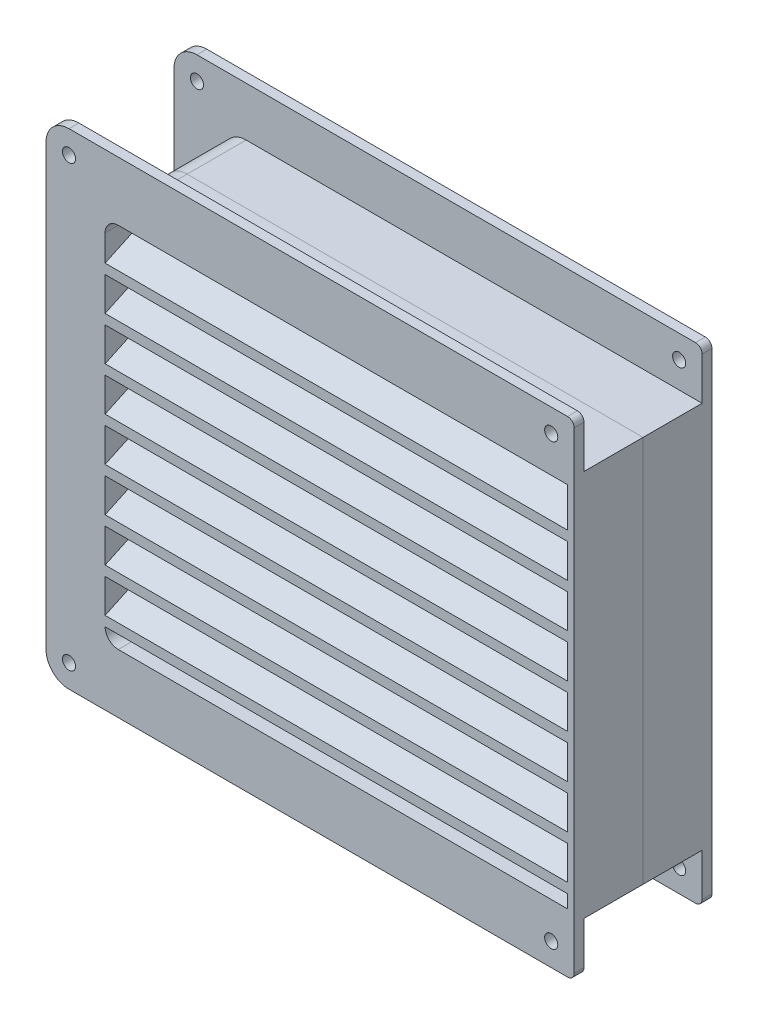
ISO-10303-21;
HEADER;
FILE_DESCRIPTION(('STEP AP214'),'2;1');
FILE_NAME('part.step','',(''),(''),'','','');
FILE_SCHEMA(('AUTOMOTIVE_DESIGN { 1 0 10303 214 1 1 1 1 }'));
ENDSEC;
DATA;
#1=APPLICATION_CONTEXT('core data for automotive mechanical design processes');
#2=APPLICATION_PROTOCOL_DEFINITION('international standard','automotive_design',2000,#1);
#3=PRODUCT_CONTEXT('',#1,'mechanical');
#4=PRODUCT('Part','Part','',(#3));
#5=PRODUCT_RELATED_PRODUCT_CATEGORY('part','',(#4));
#6=PRODUCT_DEFINITION_FORMATION('','',#4);
#7=PRODUCT_DEFINITION_CONTEXT('part definition',#1,'design');
#8=PRODUCT_DEFINITION('design','',#6,#7);
#9=PRODUCT_DEFINITION_SHAPE('','',#8);
#10=(LENGTH_UNIT() NAMED_UNIT(*) SI_UNIT(.MILLI.,.METRE.));
#11=(NAMED_UNIT(*) PLANE_ANGLE_UNIT() SI_UNIT($,.RADIAN.));
#12=(NAMED_UNIT(*) SI_UNIT($,.STERADIAN.) SOLID_ANGLE_UNIT());
#13=UNCERTAINTY_MEASURE_WITH_UNIT(LENGTH_MEASURE(1.E-05),#10,'distance_accuracy_value','');
#14=(GEOMETRIC_REPRESENTATION_CONTEXT(3) GLOBAL_UNCERTAINTY_ASSIGNED_CONTEXT((#13)) GLOBAL_UNIT_ASSIGNED_CONTEXT((#10,
#11,#12)) REPRESENTATION_CONTEXT('',''));
#15=CARTESIAN_POINT('',(0.,0.,0.));
#16=DIRECTION('',(0.,0.,1.));
#17=DIRECTION('',(1.,0.,0.));
#18=AXIS2_PLACEMENT_3D('',#15,#16,#17);
#19=CARTESIAN_POINT('',(0.,0.,42.));
#20=DIRECTION('',(1.,0.,0.));
#21=DIRECTION('',(0.,0.,1.));
#22=AXIS2_PLACEMENT_3D('',#19,#20,#21);
#23=PLANE('',#22);
#24=DIRECTION('',(0.,1.,0.));
#25=VECTOR('',#24,1.);
#26=CARTESIAN_POINT('',(0.,118.,39.));
#27=LINE('',#26,#25);
#28=CARTESIAN_POINT('',(0.,7.00000000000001,39.));
#29=VERTEX_POINT('',#28);
#30=CARTESIAN_POINT('',(0.,111.,39.));
#31=VERTEX_POINT('',#30);
#32=EDGE_CURVE('E820',#29,#31,#27,.T.);
#33=ORIENTED_EDGE('',*,*,#32,.T.);
#34=DIRECTION('',(0.,0.,-1.));
#35=VECTOR('',#34,1.);
#36=CARTESIAN_POINT('',(0.,111.,39.));
#37=LINE('',#36,#35);
#38=CARTESIAN_POINT('',(0.,111.,21.));
#39=VERTEX_POINT('',#38);
#40=EDGE_CURVE('E713',#39,#31,#37,.F.);
#41=ORIENTED_EDGE('',*,*,#40,.F.);
#42=DIRECTION('',(0.,-1.,0.));
#43=VECTOR('',#42,1.);
#44=CARTESIAN_POINT('',(0.,0.,21.));
#45=LINE('',#44,#43);
#46=CARTESIAN_POINT('',(0.,7.,21.));
#47=VERTEX_POINT('',#46);
#48=EDGE_CURVE('E688',#39,#47,#45,.T.);
#49=ORIENTED_EDGE('',*,*,#48,.T.);
#50=DIRECTION('',(0.,0.,1.));
#51=VECTOR('',#50,1.);
#52=CARTESIAN_POINT('',(0.,7.,42.));
#53=LINE('',#52,#51);
#54=EDGE_CURVE('E716',#29,#47,#53,.F.);
#55=ORIENTED_EDGE('',*,*,#54,.F.);
#56=EDGE_LOOP('',(#33,#41,#49,#55));
#57=FACE_BOUND('',#56,.T.);
#58=ADVANCED_FACE('F47',(#57),#23,.F.);
#59=CARTESIAN_POINT('',(146.,118.,-97.0381294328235));
#60=DIRECTION('',(0.,1.,0.));
#61=DIRECTION('',(0.,0.,-1.));
#62=AXIS2_PLACEMENT_3D('',#59,#60,#61);
#63=PLANE('',#62);
#64=DIRECTION('',(-1.,0.,0.));
#65=VECTOR('',#64,1.);
#66=CARTESIAN_POINT('',(146.,118.,39.));
#67=LINE('',#66,#65);
#68=CARTESIAN_POINT('',(146.,118.,39.));
#69=VERTEX_POINT('',#68);
#70=CARTESIAN_POINT('',(7.00000000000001,118.,39.));
#71=VERTEX_POINT('',#70);
#72=EDGE_CURVE('E375',#69,#71,#67,.T.);
#73=ORIENTED_EDGE('',*,*,#72,.F.);
#74=DIRECTION('',(0.,0.,1.));
#75=VECTOR('',#74,1.);
#76=CARTESIAN_POINT('',(146.,118.,-97.0381294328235));
#77=LINE('',#76,#75);
#78=CARTESIAN_POINT('',(146.,118.,21.));
#79=VERTEX_POINT('',#78);
#80=EDGE_CURVE('E385',#79,#69,#77,.T.);
#81=ORIENTED_EDGE('',*,*,#80,.F.);
#82=DIRECTION('',(-1.,0.,0.));
#83=VECTOR('',#82,1.);
#84=CARTESIAN_POINT('',(146.,118.,21.));
#85=LINE('',#84,#83);
#86=CARTESIAN_POINT('',(7.00000000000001,118.,21.));
#87=VERTEX_POINT('',#86);
#88=EDGE_CURVE('E680',#79,#87,#85,.T.);
#89=ORIENTED_EDGE('',*,*,#88,.T.);
#90=DIRECTION('',(0.,0.,-1.));
#91=VECTOR('',#90,1.);
#92=CARTESIAN_POINT('',(7.00000000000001,118.,21.));
#93=LINE('',#92,#91);
#94=EDGE_CURVE('E398',#71,#87,#93,.T.);
#95=ORIENTED_EDGE('',*,*,#94,.F.);
#96=EDGE_LOOP('',(#73,#81,#89,#95));
#97=FACE_BOUND('',#96,.T.);
#98=ADVANCED_FACE('F396',(#97),#63,.T.);
#99=CARTESIAN_POINT('',(144.,118.,-97.0381294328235));
#100=DIRECTION('',(-1.,0.,0.));
#101=DIRECTION('',(0.,-1.,0.));
#102=AXIS2_PLACEMENT_3D('',#99,#100,#101);
#103=PLANE('',#102);
#104=DIRECTION('',(0.,-1.,0.));
#105=VECTOR('',#104,1.);
#106=CARTESIAN_POINT('',(144.,118.,26.9999999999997));
#107=LINE('',#106,#105);
#108=CARTESIAN_POINT('',(144.,109.994614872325,26.9999999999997));
#109=VERTEX_POINT('',#108);
#110=CARTESIAN_POINT('',(144.,106.994614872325,26.9999999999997));
#111=VERTEX_POINT('',#110);
#112=EDGE_CURVE('E515',#109,#111,#107,.T.);
#113=ORIENTED_EDGE('',*,*,#112,.F.);
#114=DIRECTION('',(0.,0.422618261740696,-0.906307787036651));
#115=VECTOR('',#114,1.);
#116=CARTESIAN_POINT('',(144.,158.933786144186,-77.9503914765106));
#117=LINE('',#116,#115);
#118=CARTESIAN_POINT('',(144.,103.,42.));
#119=VERTEX_POINT('',#118);
#120=EDGE_CURVE('E518',#119,#109,#117,.T.);
#121=ORIENTED_EDGE('',*,*,#120,.F.);
#122=DIRECTION('',(0.,1.,0.));
#123=VECTOR('',#122,1.);
#124=CARTESIAN_POINT('',(144.,118.,42.));
#125=LINE('',#124,#123);
#126=CARTESIAN_POINT('',(144.,115.,42.));
#127=VERTEX_POINT('',#126);
#128=EDGE_CURVE('E677',#119,#127,#125,.T.);
#129=ORIENTED_EDGE('',*,*,#128,.T.);
#130=DIRECTION('',(0.,0.,1.));
#131=VECTOR('',#130,1.);
#132=CARTESIAN_POINT('',(144.,115.,-97.0381294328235));
#133=LINE('',#132,#131);
#134=CARTESIAN_POINT('',(144.,115.,21.));
#135=VERTEX_POINT('',#134);
#136=EDGE_CURVE('E707',#135,#127,#133,.T.);
#137=ORIENTED_EDGE('',*,*,#136,.F.);
#138=DIRECTION('',(0.,-1.,0.));
#139=VECTOR('',#138,1.);
#140=CARTESIAN_POINT('',(144.,118.,21.));
#141=LINE('',#140,#139);
#142=CARTESIAN_POINT('',(144.,3.,21.));
#143=VERTEX_POINT('',#142);
#144=EDGE_CURVE('E392',#135,#143,#141,.T.);
#145=ORIENTED_EDGE('',*,*,#144,.T.);
#146=DIRECTION('',(0.,0.,1.));
#147=VECTOR('',#146,1.);
#148=CARTESIAN_POINT('',(144.,3.,42.));
#149=LINE('',#148,#147);
#150=CARTESIAN_POINT('',(144.,3.,42.));
#151=VERTEX_POINT('',#150);
#152=EDGE_CURVE('E682',#143,#151,#149,.T.);
#153=ORIENTED_EDGE('',*,*,#152,.T.);
#154=CARTESIAN_POINT('',(144.,7.00000000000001,42.));
#155=VERTEX_POINT('',#154);
#156=EDGE_CURVE('E393',#151,#155,#125,.T.);
#157=ORIENTED_EDGE('',*,*,#156,.T.);
#158=DIRECTION('',(0.,-0.422618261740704,0.906307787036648));
#159=VECTOR('',#158,1.);
#160=CARTESIAN_POINT('',(144.,80.0799808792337,-114.720524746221));
#161=LINE('',#160,#159);
#162=CARTESIAN_POINT('',(144.,13.9946148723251,27.));
#163=VERTEX_POINT('',#162);
#164=EDGE_CURVE('E662',#163,#155,#161,.T.);
#165=ORIENTED_EDGE('',*,*,#164,.F.);
#166=DIRECTION('',(0.,-1.,0.));
#167=VECTOR('',#166,1.);
#168=CARTESIAN_POINT('',(144.,118.,27.0000000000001));
#169=LINE('',#168,#167);
#170=CARTESIAN_POINT('',(144.,16.9946148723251,27.));
#171=VERTEX_POINT('',#170);
#172=EDGE_CURVE('E665',#171,#163,#169,.T.);
#173=ORIENTED_EDGE('',*,*,#172,.F.);
#174=DIRECTION('',(0.,0.422618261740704,-0.906307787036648));
#175=VECTOR('',#174,1.);
#176=CARTESIAN_POINT('',(144.,82.5441622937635,-113.571458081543));
#177=LINE('',#176,#175);
#178=CARTESIAN_POINT('',(144.,10.,42.));
#179=VERTEX_POINT('',#178);
#180=EDGE_CURVE('E668',#179,#171,#177,.T.);
#181=ORIENTED_EDGE('',*,*,#180,.F.);
#182=CARTESIAN_POINT('',(144.,20.2857142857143,42.));
#183=VERTEX_POINT('',#182);
#184=EDGE_CURVE('E684',#179,#183,#125,.T.);
#185=ORIENTED_EDGE('',*,*,#184,.T.);
#186=DIRECTION('',(0.,-0.422618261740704,0.906307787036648));
#187=VECTOR('',#186,1.);
#188=CARTESIAN_POINT('',(144.,90.9927842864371,-109.631800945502));
#189=LINE('',#188,#187);
#190=CARTESIAN_POINT('',(144.,27.2803291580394,27.));
#191=VERTEX_POINT('',#190);
#192=EDGE_CURVE('E626',#191,#183,#189,.T.);
#193=ORIENTED_EDGE('',*,*,#192,.F.);
#194=DIRECTION('',(0.,-1.,0.));
#195=VECTOR('',#194,1.);
#196=CARTESIAN_POINT('',(144.,118.,27.));
#197=LINE('',#196,#195);
#198=CARTESIAN_POINT('',(144.,30.2803291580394,27.));
#199=VERTEX_POINT('',#198);
#200=EDGE_CURVE('E620',#199,#191,#197,.T.);
#201=ORIENTED_EDGE('',*,*,#200,.F.);
#202=DIRECTION('',(0.,0.422618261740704,-0.906307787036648));
#203=VECTOR('',#202,1.);
#204=CARTESIAN_POINT('',(144.,93.4569657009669,-108.482734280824));
#205=LINE('',#204,#203);
#206=CARTESIAN_POINT('',(144.,23.2857142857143,42.));
#207=VERTEX_POINT('',#206);
#208=EDGE_CURVE('E623',#207,#199,#205,.T.);
#209=ORIENTED_EDGE('',*,*,#208,.F.);
#210=CARTESIAN_POINT('',(144.,33.5714285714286,41.9999999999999));
#211=VERTEX_POINT('',#210);
#212=EDGE_CURVE('E1406',#207,#211,#125,.T.);
#213=ORIENTED_EDGE('',*,*,#212,.T.);
#214=DIRECTION('',(0.,-0.422618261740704,0.906307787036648));
#215=VECTOR('',#214,1.);
#216=CARTESIAN_POINT('',(144.,101.90558769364,-104.543077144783));
#217=LINE('',#216,#215);
#218=CARTESIAN_POINT('',(144.,40.5660434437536,26.9999999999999));
#219=VERTEX_POINT('',#218);
#220=EDGE_CURVE('E605',#219,#211,#217,.T.);
#221=ORIENTED_EDGE('',*,*,#220,.F.);
#222=DIRECTION('',(0.,-1.,0.));
#223=VECTOR('',#222,1.);
#224=CARTESIAN_POINT('',(144.,118.,26.9999999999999));
#225=LINE('',#224,#223);
#226=CARTESIAN_POINT('',(144.,43.5660434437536,26.9999999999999));
#227=VERTEX_POINT('',#226);
#228=EDGE_CURVE('E599',#227,#219,#225,.T.);
#229=ORIENTED_EDGE('',*,*,#228,.F.);
#230=DIRECTION('',(0.,0.422618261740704,-0.906307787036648));
#231=VECTOR('',#230,1.);
#232=CARTESIAN_POINT('',(144.,104.36976910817,-103.394010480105));
#233=LINE('',#232,#231);
#234=CARTESIAN_POINT('',(144.,36.5714285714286,41.9999999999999));
#235=VERTEX_POINT('',#234);
#236=EDGE_CURVE('E602',#235,#227,#233,.T.);
#237=ORIENTED_EDGE('',*,*,#236,.F.);
#238=CARTESIAN_POINT('',(144.,46.8571428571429,41.9999999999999));
#239=VERTEX_POINT('',#238);
#240=EDGE_CURVE('E1413',#235,#239,#125,.T.);
#241=ORIENTED_EDGE('',*,*,#240,.T.);
#242=DIRECTION('',(0.,-0.422618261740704,0.906307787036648));
#243=VECTOR('',#242,1.);
#244=CARTESIAN_POINT('',(144.,112.818391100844,-99.4543533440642));
#245=LINE('',#244,#243);
#246=CARTESIAN_POINT('',(144.,53.8517577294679,26.9999999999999));
#247=VERTEX_POINT('',#246);
#248=EDGE_CURVE('E584',#247,#239,#245,.T.);
#249=ORIENTED_EDGE('',*,*,#248,.F.);
#250=DIRECTION('',(0.,-1.,0.));
#251=VECTOR('',#250,1.);
#252=CARTESIAN_POINT('',(144.,118.,26.9999999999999));
#253=LINE('',#252,#251);
#254=CARTESIAN_POINT('',(144.,56.8517577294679,26.9999999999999));
#255=VERTEX_POINT('',#254);
#256=EDGE_CURVE('E578',#255,#247,#253,.T.);
#257=ORIENTED_EDGE('',*,*,#256,.F.);
#258=DIRECTION('',(0.,0.422618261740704,-0.906307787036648));
#259=VECTOR('',#258,1.);
#260=CARTESIAN_POINT('',(144.,115.282572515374,-98.3052866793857));
#261=LINE('',#260,#259);
#262=CARTESIAN_POINT('',(144.,49.8571428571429,41.9999999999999));
#263=VERTEX_POINT('',#262);
#264=EDGE_CURVE('E581',#263,#255,#261,.T.);
#265=ORIENTED_EDGE('',*,*,#264,.F.);
#266=CARTESIAN_POINT('',(144.,60.1428571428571,41.9999999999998));
#267=VERTEX_POINT('',#266);
#268=EDGE_CURVE('E1408',#263,#267,#125,.T.);
#269=ORIENTED_EDGE('',*,*,#268,.T.);
#270=DIRECTION('',(0.,-0.422618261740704,0.906307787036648));
#271=VECTOR('',#270,1.);
#272=CARTESIAN_POINT('',(144.,123.731194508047,-94.3656295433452));
#273=LINE('',#272,#271);
#274=CARTESIAN_POINT('',(144.,67.1374720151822,26.9999999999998));
#275=VERTEX_POINT('',#274);
#276=EDGE_CURVE('E563',#275,#267,#273,.T.);
#277=ORIENTED_EDGE('',*,*,#276,.F.);
#278=DIRECTION('',(0.,-1.,0.));
#279=VECTOR('',#278,1.);
#280=CARTESIAN_POINT('',(144.,118.,26.9999999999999));
#281=LINE('',#280,#279);
#282=CARTESIAN_POINT('',(144.,70.1374720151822,26.9999999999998));
#283=VERTEX_POINT('',#282);
#284=EDGE_CURVE('E557',#283,#275,#281,.T.);
#285=ORIENTED_EDGE('',*,*,#284,.F.);
#286=DIRECTION('',(0.,0.422618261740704,-0.906307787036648));
#287=VECTOR('',#286,1.);
#288=CARTESIAN_POINT('',(144.,126.195375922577,-93.2165628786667));
#289=LINE('',#288,#287);
#290=CARTESIAN_POINT('',(144.,63.1428571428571,41.9999999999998));
#291=VERTEX_POINT('',#290);
#292=EDGE_CURVE('E560',#291,#283,#289,.T.);
#293=ORIENTED_EDGE('',*,*,#292,.F.);
#294=CARTESIAN_POINT('',(144.,73.4285714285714,42.));
#295=VERTEX_POINT('',#294);
#296=EDGE_CURVE('E1402',#291,#295,#125,.T.);
#297=ORIENTED_EDGE('',*,*,#296,.T.);
#298=DIRECTION('',(0.,-0.422618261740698,0.906307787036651));
#299=VECTOR('',#298,1.);
#300=CARTESIAN_POINT('',(144.,134.64399791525,-89.2769057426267));
#301=LINE('',#300,#299);
#302=CARTESIAN_POINT('',(144.,80.4231863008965,26.9999999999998));
#303=VERTEX_POINT('',#302);
#304=EDGE_CURVE('E647',#303,#295,#301,.T.);
#305=ORIENTED_EDGE('',*,*,#304,.F.);
#306=DIRECTION('',(0.,-1.,0.));
#307=VECTOR('',#306,1.);
#308=CARTESIAN_POINT('',(144.,118.,26.9999999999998));
#309=LINE('',#308,#307);
#310=CARTESIAN_POINT('',(144.,83.4231863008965,26.9999999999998));
#311=VERTEX_POINT('',#310);
#312=EDGE_CURVE('E641',#311,#303,#309,.T.);
#313=ORIENTED_EDGE('',*,*,#312,.F.);
#314=DIRECTION('',(0.,0.422618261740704,-0.906307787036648));
#315=VECTOR('',#314,1.);
#316=CARTESIAN_POINT('',(144.,137.10817932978,-88.1278390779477));
#317=LINE('',#316,#315);
#318=CARTESIAN_POINT('',(144.,76.4285714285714,41.9999999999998));
#319=VERTEX_POINT('',#318);
#320=EDGE_CURVE('E644',#319,#311,#317,.T.);
#321=ORIENTED_EDGE('',*,*,#320,.F.);
#322=CARTESIAN_POINT('',(144.,86.7142857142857,41.9999999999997));
#323=VERTEX_POINT('',#322);
#324=EDGE_CURVE('E1401',#319,#323,#125,.T.);
#325=ORIENTED_EDGE('',*,*,#324,.T.);
#326=DIRECTION('',(0.,-0.422618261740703,0.906307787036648));
#327=VECTOR('',#326,1.);
#328=CARTESIAN_POINT('',(144.,145.556801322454,-84.1881819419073));
#329=LINE('',#328,#327);
#330=CARTESIAN_POINT('',(144.,93.7089005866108,26.9999999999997));
#331=VERTEX_POINT('',#330);
#332=EDGE_CURVE('E542',#331,#323,#329,.T.);
#333=ORIENTED_EDGE('',*,*,#332,.F.);
#334=DIRECTION('',(0.,-1.,0.));
#335=VECTOR('',#334,1.);
#336=CARTESIAN_POINT('',(144.,118.,26.9999999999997));
#337=LINE('',#336,#335);
#338=CARTESIAN_POINT('',(144.,96.7089005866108,26.9999999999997));
#339=VERTEX_POINT('',#338);
#340=EDGE_CURVE('E536',#339,#331,#337,.T.);
#341=ORIENTED_EDGE('',*,*,#340,.F.);
#342=DIRECTION('',(0.,0.422618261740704,-0.906307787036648));
#343=VECTOR('',#342,1.);
#344=CARTESIAN_POINT('',(144.,148.020982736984,-83.0391152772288));
#345=LINE('',#344,#343);
#346=CARTESIAN_POINT('',(144.,89.7142857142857,41.9999999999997));
#347=VERTEX_POINT('',#346);
#348=EDGE_CURVE('E539',#347,#339,#345,.T.);
#349=ORIENTED_EDGE('',*,*,#348,.F.);
#350=CARTESIAN_POINT('',(144.,100.,41.9999999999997));
#351=VERTEX_POINT('',#350);
#352=EDGE_CURVE('E1400',#347,#351,#125,.T.);
#353=ORIENTED_EDGE('',*,*,#352,.T.);
#354=DIRECTION('',(0.,-0.422618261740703,0.906307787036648));
#355=VECTOR('',#354,1.);
#356=CARTESIAN_POINT('',(144.,156.469604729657,-79.0994581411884));
#357=LINE('',#356,#355);
#358=EDGE_CURVE('E521',#111,#351,#357,.T.);
#359=ORIENTED_EDGE('',*,*,#358,.F.);
#360=EDGE_LOOP('',(#113,#121,#129,#137,#145,#153,#157,#165,#173,#181,#185,#193,#201,#209,#213,
#221,#229,#237,#241,#249,#257,#265,#269,#277,#285,#293,#297,#305,#313,#321,#325,#333,#341,#349,
#353,#359));
#361=FACE_BOUND('',#360,.T.);
#362=ADVANCED_FACE('F855',(#361),#103,.T.);
#363=CARTESIAN_POINT('',(146.,0.,42.));
#364=DIRECTION('',(0.,0.,-1.));
#365=DIRECTION('',(1.,0.,0.));
#366=AXIS2_PLACEMENT_3D('',#363,#364,#365);
#367=PLANE('',#366);
#368=DIRECTION('',(-1.,0.,0.));
#369=VECTOR('',#368,1.);
#370=CARTESIAN_POINT('',(146.,7.,42.));
#371=LINE('',#370,#369);
#372=CARTESIAN_POINT('',(2.99999999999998,7.00000000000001,42.));
#373=VERTEX_POINT('',#372);
#374=EDGE_CURVE('E650',#155,#373,#371,.T.);
#375=ORIENTED_EDGE('',*,*,#374,.F.);
#376=ORIENTED_EDGE('',*,*,#156,.F.);
#377=DIRECTION('',(-1.,0.,0.));
#378=VECTOR('',#377,1.);
#379=CARTESIAN_POINT('',(146.,3.,42.));
#380=LINE('',#379,#378);
#381=CARTESIAN_POINT('',(6.99999999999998,3.,42.));
#382=VERTEX_POINT('',#381);
#383=EDGE_CURVE('E704',#151,#382,#380,.T.);
#384=ORIENTED_EDGE('',*,*,#383,.T.);
#385=CARTESIAN_POINT('',(6.99999999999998,7.,42.));
#386=DIRECTION('',(0.,0.,1.));
#387=DIRECTION('',(1.,0.,0.));
#388=AXIS2_PLACEMENT_3D('',#385,#386,#387);
#389=CIRCLE('',#388,4.);
#390=EDGE_CURVE('E741',#373,#382,#389,.T.);
#391=ORIENTED_EDGE('',*,*,#390,.F.);
#392=EDGE_LOOP('',(#375,#376,#384,#391));
#393=FACE_BOUND('',#392,.T.);
#394=DIRECTION('',(0.,-1.,0.));
#395=VECTOR('',#394,1.);
#396=CARTESIAN_POINT('',(3.,118.,42.));
#397=LINE('',#396,#395);
#398=CARTESIAN_POINT('',(2.99999999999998,20.2857142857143,42.));
#399=VERTEX_POINT('',#398);
#400=CARTESIAN_POINT('',(2.99999999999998,9.99999999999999,42.));
#401=VERTEX_POINT('',#400);
#402=EDGE_CURVE('E430',#399,#401,#397,.T.);
#403=ORIENTED_EDGE('',*,*,#402,.F.);
#404=DIRECTION('',(-1.,0.,0.));
#405=VECTOR('',#404,1.);
#406=CARTESIAN_POINT('',(146.,20.2857142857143,42.));
#407=LINE('',#406,#405);
#408=EDGE_CURVE('E617',#183,#399,#407,.T.);
#409=ORIENTED_EDGE('',*,*,#408,.F.);
#410=ORIENTED_EDGE('',*,*,#184,.F.);
#411=DIRECTION('',(-1.,0.,0.));
#412=VECTOR('',#411,1.);
#413=CARTESIAN_POINT('',(146.,10.,42.));
#414=LINE('',#413,#412);
#415=EDGE_CURVE('E659',#179,#401,#414,.T.);
#416=ORIENTED_EDGE('',*,*,#415,.T.);
#417=EDGE_LOOP('',(#403,#409,#410,#416));
#418=FACE_BOUND('',#417,.T.);
#419=CARTESIAN_POINT('',(2.99999999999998,33.5714285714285,42.));
#420=VERTEX_POINT('',#419);
#421=CARTESIAN_POINT('',(2.99999999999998,23.2857142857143,42.));
#422=VERTEX_POINT('',#421);
#423=EDGE_CURVE('E1439',#420,#422,#397,.T.);
#424=ORIENTED_EDGE('',*,*,#423,.F.);
#425=DIRECTION('',(-1.,0.,0.));
#426=VECTOR('',#425,1.);
#427=CARTESIAN_POINT('',(146.,33.5714285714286,41.9999999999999));
#428=LINE('',#427,#426);
#429=EDGE_CURVE('E596',#211,#420,#428,.T.);
#430=ORIENTED_EDGE('',*,*,#429,.F.);
#431=ORIENTED_EDGE('',*,*,#212,.F.);
#432=DIRECTION('',(-1.,0.,0.));
#433=VECTOR('',#432,1.);
#434=CARTESIAN_POINT('',(146.,23.2857142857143,42.));
#435=LINE('',#434,#433);
#436=EDGE_CURVE('E614',#207,#422,#435,.T.);
#437=ORIENTED_EDGE('',*,*,#436,.T.);
#438=EDGE_LOOP('',(#424,#430,#431,#437));
#439=FACE_BOUND('',#438,.T.);
#440=CARTESIAN_POINT('',(2.99999999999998,46.8571428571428,42.));
#441=VERTEX_POINT('',#440);
#442=CARTESIAN_POINT('',(2.99999999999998,36.5714285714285,42.));
#443=VERTEX_POINT('',#442);
#444=EDGE_CURVE('E1445',#441,#443,#397,.T.);
#445=ORIENTED_EDGE('',*,*,#444,.F.);
#446=DIRECTION('',(-1.,0.,0.));
#447=VECTOR('',#446,1.);
#448=CARTESIAN_POINT('',(146.,46.8571428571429,41.9999999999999));
#449=LINE('',#448,#447);
#450=EDGE_CURVE('E575',#239,#441,#449,.T.);
#451=ORIENTED_EDGE('',*,*,#450,.F.);
#452=ORIENTED_EDGE('',*,*,#240,.F.);
#453=DIRECTION('',(-1.,0.,0.));
#454=VECTOR('',#453,1.);
#455=CARTESIAN_POINT('',(146.,36.5714285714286,41.9999999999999));
#456=LINE('',#455,#454);
#457=EDGE_CURVE('E593',#235,#443,#456,.T.);
#458=ORIENTED_EDGE('',*,*,#457,.T.);
#459=EDGE_LOOP('',(#445,#451,#452,#458));
#460=FACE_BOUND('',#459,.T.);
#461=CARTESIAN_POINT('',(2.99999999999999,60.1428571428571,42.));
#462=VERTEX_POINT('',#461);
#463=CARTESIAN_POINT('',(2.99999999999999,49.8571428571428,42.));
#464=VERTEX_POINT('',#463);
#465=EDGE_CURVE('E1451',#462,#464,#397,.T.);
#466=ORIENTED_EDGE('',*,*,#465,.F.);
#467=DIRECTION('',(-1.,0.,0.));
#468=VECTOR('',#467,1.);
#469=CARTESIAN_POINT('',(146.,60.1428571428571,41.9999999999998));
#470=LINE('',#469,#468);
#471=EDGE_CURVE('E554',#267,#462,#470,.T.);
#472=ORIENTED_EDGE('',*,*,#471,.F.);
#473=ORIENTED_EDGE('',*,*,#268,.F.);
#474=DIRECTION('',(-1.,0.,0.));
#475=VECTOR('',#474,1.);
#476=CARTESIAN_POINT('',(146.,49.8571428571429,41.9999999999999));
#477=LINE('',#476,#475);
#478=EDGE_CURVE('E572',#263,#464,#477,.T.);
#479=ORIENTED_EDGE('',*,*,#478,.T.);
#480=EDGE_LOOP('',(#466,#472,#473,#479));
#481=FACE_BOUND('',#480,.T.);
#482=CARTESIAN_POINT('',(2.99999999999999,73.4285714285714,42.));
#483=VERTEX_POINT('',#482);
#484=CARTESIAN_POINT('',(2.99999999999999,63.1428571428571,42.));
#485=VERTEX_POINT('',#484);
#486=EDGE_CURVE('E1457',#483,#485,#397,.T.);
#487=ORIENTED_EDGE('',*,*,#486,.F.);
#488=DIRECTION('',(-1.,0.,0.));
#489=VECTOR('',#488,1.);
#490=CARTESIAN_POINT('',(146.,73.4285714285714,42.));
#491=LINE('',#490,#489);
#492=EDGE_CURVE('E638',#295,#483,#491,.T.);
#493=ORIENTED_EDGE('',*,*,#492,.F.);
#494=ORIENTED_EDGE('',*,*,#296,.F.);
#495=DIRECTION('',(-1.,0.,0.));
#496=VECTOR('',#495,1.);
#497=CARTESIAN_POINT('',(146.,63.1428571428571,41.9999999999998));
#498=LINE('',#497,#496);
#499=EDGE_CURVE('E551',#291,#485,#498,.T.);
#500=ORIENTED_EDGE('',*,*,#499,.T.);
#501=EDGE_LOOP('',(#487,#493,#494,#500));
#502=FACE_BOUND('',#501,.T.);
#503=CARTESIAN_POINT('',(2.99999999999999,86.7142857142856,42.));
#504=VERTEX_POINT('',#503);
#505=CARTESIAN_POINT('',(2.99999999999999,76.4285714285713,42.));
#506=VERTEX_POINT('',#505);
#507=EDGE_CURVE('E1478',#504,#506,#397,.T.);
#508=ORIENTED_EDGE('',*,*,#507,.F.);
#509=DIRECTION('',(-1.,0.,0.));
#510=VECTOR('',#509,1.);
#511=CARTESIAN_POINT('',(146.,86.7142857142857,41.9999999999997));
#512=LINE('',#511,#510);
#513=EDGE_CURVE('E533',#323,#504,#512,.T.);
#514=ORIENTED_EDGE('',*,*,#513,.F.);
#515=ORIENTED_EDGE('',*,*,#324,.F.);
#516=DIRECTION('',(-1.,0.,0.));
#517=VECTOR('',#516,1.);
#518=CARTESIAN_POINT('',(146.,76.4285714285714,41.9999999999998));
#519=LINE('',#518,#517);
#520=EDGE_CURVE('E635',#319,#506,#519,.T.);
#521=ORIENTED_EDGE('',*,*,#520,.T.);
#522=EDGE_LOOP('',(#508,#514,#515,#521));
#523=FACE_BOUND('',#522,.T.);
#524=CARTESIAN_POINT('',(3.,99.9999999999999,42.));
#525=VERTEX_POINT('',#524);
#526=CARTESIAN_POINT('',(2.99999999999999,89.7142857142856,42.));
#527=VERTEX_POINT('',#526);
#528=EDGE_CURVE('E447',#525,#527,#397,.T.);
#529=ORIENTED_EDGE('',*,*,#528,.F.);
#530=DIRECTION('',(-1.,0.,0.));
#531=VECTOR('',#530,1.);
#532=CARTESIAN_POINT('',(146.,100.,41.9999999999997));
#533=LINE('',#532,#531);
#534=EDGE_CURVE('E512',#351,#525,#533,.T.);
#535=ORIENTED_EDGE('',*,*,#534,.F.);
#536=ORIENTED_EDGE('',*,*,#352,.F.);
#537=DIRECTION('',(-1.,0.,0.));
#538=VECTOR('',#537,1.);
#539=CARTESIAN_POINT('',(146.,89.7142857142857,41.9999999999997));
#540=LINE('',#539,#538);
#541=EDGE_CURVE('E530',#347,#527,#540,.T.);
#542=ORIENTED_EDGE('',*,*,#541,.T.);
#543=EDGE_LOOP('',(#529,#535,#536,#542));
#544=FACE_BOUND('',#543,.T.);
#545=DIRECTION('',(-1.,0.,0.));
#546=VECTOR('',#545,1.);
#547=CARTESIAN_POINT('',(146.,115.,42.));
#548=LINE('',#547,#546);
#549=CARTESIAN_POINT('',(7.00000000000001,115.,42.));
#550=VERTEX_POINT('',#549);
#551=EDGE_CURVE('E671',#127,#550,#548,.T.);
#552=ORIENTED_EDGE('',*,*,#551,.F.);
#553=ORIENTED_EDGE('',*,*,#128,.F.);
#554=DIRECTION('',(-1.,0.,0.));
#555=VECTOR('',#554,1.);
#556=CARTESIAN_POINT('',(146.,103.,42.));
#557=LINE('',#556,#555);
#558=CARTESIAN_POINT('',(3.,103.,42.));
#559=VERTEX_POINT('',#558);
#560=EDGE_CURVE('E509',#119,#559,#557,.T.);
#561=ORIENTED_EDGE('',*,*,#560,.T.);
#562=CARTESIAN_POINT('',(3.,111.,42.));
#563=VERTEX_POINT('',#562);
#564=EDGE_CURVE('E444',#563,#559,#397,.T.);
#565=ORIENTED_EDGE('',*,*,#564,.F.);
#566=CARTESIAN_POINT('',(7.00000000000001,111.,42.));
#567=DIRECTION('',(0.,0.,1.));
#568=DIRECTION('',(1.,0.,0.));
#569=AXIS2_PLACEMENT_3D('',#566,#567,#568);
#570=CIRCLE('',#569,4.);
#571=EDGE_CURVE('E744',#550,#563,#570,.T.);
#572=ORIENTED_EDGE('',*,*,#571,.F.);
#573=EDGE_LOOP('',(#552,#553,#561,#565,#572));
#574=FACE_BOUND('',#573,.T.);
#575=DIRECTION('',(-1.,0.,0.));
#576=VECTOR('',#575,1.);
#577=CARTESIAN_POINT('',(146.,-15.,42.));
#578=LINE('',#577,#576);
#579=CARTESIAN_POINT('',(144.,-15.,42.));
#580=VERTEX_POINT('',#579);
#581=CARTESIAN_POINT('',(-7.99999999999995,-15.,42.));
#582=VERTEX_POINT('',#581);
#583=EDGE_CURVE('E418',#580,#582,#578,.T.);
#584=ORIENTED_EDGE('',*,*,#583,.F.);
#585=CARTESIAN_POINT('',(144.,-13.,42.));
#586=DIRECTION('',(0.,0.,1.));
#587=DIRECTION('',(1.,0.,0.));
#588=AXIS2_PLACEMENT_3D('',#585,#586,#587);
#589=CIRCLE('',#588,2.);
#590=CARTESIAN_POINT('',(146.,-13.,42.));
#591=VERTEX_POINT('',#590);
#592=EDGE_CURVE('E757',#591,#580,#589,.F.);
#593=ORIENTED_EDGE('',*,*,#592,.F.);
#594=DIRECTION('',(0.,1.,0.));
#595=VECTOR('',#594,1.);
#596=CARTESIAN_POINT('',(146.,0.,42.));
#597=LINE('',#596,#595);
#598=CARTESIAN_POINT('',(146.,131.,42.));
#599=VERTEX_POINT('',#598);
#600=EDGE_CURVE('E689',#591,#599,#597,.T.);
#601=ORIENTED_EDGE('',*,*,#600,.T.);
#602=CARTESIAN_POINT('',(144.,131.,42.));
#603=DIRECTION('',(0.,0.,1.));
#604=DIRECTION('',(1.,0.,0.));
#605=AXIS2_PLACEMENT_3D('',#602,#603,#604);
#606=CIRCLE('',#605,2.);
#607=CARTESIAN_POINT('',(144.,133.,42.));
#608=VERTEX_POINT('',#607);
#609=EDGE_CURVE('E754',#608,#599,#606,.F.);
#610=ORIENTED_EDGE('',*,*,#609,.F.);
#611=DIRECTION('',(1.,0.,0.));
#612=VECTOR('',#611,1.);
#613=CARTESIAN_POINT('',(146.,133.,42.));
#614=LINE('',#613,#612);
#615=CARTESIAN_POINT('',(-7.99999999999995,133.,42.));
#616=VERTEX_POINT('',#615);
#617=EDGE_CURVE('E399',#616,#608,#614,.T.);
#618=ORIENTED_EDGE('',*,*,#617,.F.);
#619=CARTESIAN_POINT('',(-8.,126.,42.));
#620=DIRECTION('',(0.,0.,1.));
#621=DIRECTION('',(1.,0.,0.));
#622=AXIS2_PLACEMENT_3D('',#619,#620,#621);
#623=CIRCLE('',#622,7.);
#624=CARTESIAN_POINT('',(-15.,126.,42.));
#625=VERTEX_POINT('',#624);
#626=EDGE_CURVE('E770',#625,#616,#623,.F.);
#627=ORIENTED_EDGE('',*,*,#626,.F.);
#628=DIRECTION('',(0.,1.,0.));
#629=VECTOR('',#628,1.);
#630=CARTESIAN_POINT('',(-15.,0.,42.));
#631=LINE('',#630,#629);
#632=CARTESIAN_POINT('',(-15.,-8.,42.));
#633=VERTEX_POINT('',#632);
#634=EDGE_CURVE('E425',#633,#625,#631,.T.);
#635=ORIENTED_EDGE('',*,*,#634,.F.);
#636=CARTESIAN_POINT('',(-8.00000000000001,-8.,42.));
#637=DIRECTION('',(0.,0.,1.));
#638=DIRECTION('',(1.,0.,0.));
#639=AXIS2_PLACEMENT_3D('',#636,#637,#638);
#640=CIRCLE('',#639,7.);
#641=EDGE_CURVE('E772',#582,#633,#640,.F.);
#642=ORIENTED_EDGE('',*,*,#641,.F.);
#643=EDGE_LOOP('',(#584,#593,#601,#610,#618,#627,#635,#642));
#644=FACE_BOUND('',#643,.T.);
#645=CARTESIAN_POINT('',(-7.99999999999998,-8.,42.));
#646=DIRECTION('',(0.,0.,-1.));
#647=DIRECTION('',(1.,0.,0.));
#648=AXIS2_PLACEMENT_3D('',#645,#646,#647);
#649=CIRCLE('',#648,2.);
#650=CARTESIAN_POINT('',(-5.99999999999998,-8.,42.));
#651=VERTEX_POINT('',#650);
#652=EDGE_CURVE('E381',#651,#651,#649,.T.);
#653=ORIENTED_EDGE('',*,*,#652,.T.);
#654=EDGE_LOOP('',(#653));
#655=FACE_BOUND('',#654,.T.);
#656=CARTESIAN_POINT('',(139.,-8.,42.));
#657=DIRECTION('',(0.,0.,-1.));
#658=DIRECTION('',(-1.,0.,0.));
#659=AXIS2_PLACEMENT_3D('',#656,#657,#658);
#660=CIRCLE('',#659,2.);
#661=CARTESIAN_POINT('',(137.,-8.,42.));
#662=VERTEX_POINT('',#661);
#663=EDGE_CURVE('E412',#662,#662,#660,.T.);
#664=ORIENTED_EDGE('',*,*,#663,.T.);
#665=EDGE_LOOP('',(#664));
#666=FACE_BOUND('',#665,.T.);
#667=CARTESIAN_POINT('',(139.,126.,42.));
#668=DIRECTION('',(0.,0.,-1.));
#669=DIRECTION('',(1.,0.,0.));
#670=AXIS2_PLACEMENT_3D('',#667,#668,#669);
#671=CIRCLE('',#670,2.);
#672=CARTESIAN_POINT('',(141.,126.,42.));
#673=VERTEX_POINT('',#672);
#674=EDGE_CURVE('E823',#673,#673,#671,.T.);
#675=ORIENTED_EDGE('',*,*,#674,.T.);
#676=EDGE_LOOP('',(#675));
#677=FACE_BOUND('',#676,.T.);
#678=CARTESIAN_POINT('',(-7.99999999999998,126.,42.));
#679=DIRECTION('',(0.,0.,-1.));
#680=DIRECTION('',(-1.,0.,0.));
#681=AXIS2_PLACEMENT_3D('',#678,#679,#680);
#682=CIRCLE('',#681,2.);
#683=CARTESIAN_POINT('',(-9.99999999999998,126.,42.));
#684=VERTEX_POINT('',#683);
#685=EDGE_CURVE('E406',#684,#684,#682,.T.);
#686=ORIENTED_EDGE('',*,*,#685,.T.);
#687=EDGE_LOOP('',(#686));
#688=FACE_BOUND('',#687,.T.);
#689=ADVANCED_FACE('F795',(#393,#418,#439,#460,#481,#502,#523,#544,#574,#644,#655,#666,#677,
#688),#367,.F.);
#690=CARTESIAN_POINT('',(146.,3.,42.));
#691=DIRECTION('',(0.,-1.,0.));
#692=DIRECTION('',(0.,0.,1.));
#693=AXIS2_PLACEMENT_3D('',#690,#691,#692);
#694=PLANE('',#693);
#695=ORIENTED_EDGE('',*,*,#383,.F.);
#696=ORIENTED_EDGE('',*,*,#152,.F.);
#697=DIRECTION('',(-1.,0.,0.));
#698=VECTOR('',#697,1.);
#699=CARTESIAN_POINT('',(146.,3.,21.));
#700=LINE('',#699,#698);
#701=CARTESIAN_POINT('',(6.99999999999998,3.,21.));
#702=VERTEX_POINT('',#701);
#703=EDGE_CURVE('E701',#143,#702,#700,.T.);
#704=ORIENTED_EDGE('',*,*,#703,.T.);
#705=DIRECTION('',(0.,0.,-1.));
#706=VECTOR('',#705,1.);
#707=CARTESIAN_POINT('',(6.99999999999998,3.,42.));
#708=LINE('',#707,#706);
#709=EDGE_CURVE('E729',#382,#702,#708,.T.);
#710=ORIENTED_EDGE('',*,*,#709,.F.);
#711=EDGE_LOOP('',(#695,#696,#704,#710));
#712=FACE_BOUND('',#711,.T.);
#713=ADVANCED_FACE('F864',(#712),#694,.F.);
#714=CARTESIAN_POINT('',(146.,0.,21.));
#715=DIRECTION('',(0.,0.,1.));
#716=DIRECTION('',(-1.,0.,0.));
#717=AXIS2_PLACEMENT_3D('',#714,#715,#716);
#718=PLANE('',#717);
#719=ORIENTED_EDGE('',*,*,#703,.F.);
#720=ORIENTED_EDGE('',*,*,#144,.F.);
#721=DIRECTION('',(-1.,0.,0.));
#722=VECTOR('',#721,1.);
#723=CARTESIAN_POINT('',(146.,115.,21.));
#724=LINE('',#723,#722);
#725=CARTESIAN_POINT('',(7.00000000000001,115.,21.));
#726=VERTEX_POINT('',#725);
#727=EDGE_CURVE('E674',#135,#726,#724,.T.);
#728=ORIENTED_EDGE('',*,*,#727,.T.);
#729=CARTESIAN_POINT('',(7.00000000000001,111.,21.));
#730=DIRECTION('',(0.,0.,-1.));
#731=DIRECTION('',(-1.,0.,0.));
#732=AXIS2_PLACEMENT_3D('',#729,#730,#731);
#733=CIRCLE('',#732,4.);
#734=CARTESIAN_POINT('',(3.,111.,21.));
#735=VERTEX_POINT('',#734);
#736=EDGE_CURVE('E747',#735,#726,#733,.T.);
#737=ORIENTED_EDGE('',*,*,#736,.F.);
#738=DIRECTION('',(0.,1.,0.));
#739=VECTOR('',#738,1.);
#740=CARTESIAN_POINT('',(3.,118.,21.));
#741=LINE('',#740,#739);
#742=CARTESIAN_POINT('',(2.99999999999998,7.00000000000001,21.));
#743=VERTEX_POINT('',#742);
#744=EDGE_CURVE('E440',#743,#735,#741,.T.);
#745=ORIENTED_EDGE('',*,*,#744,.F.);
#746=CARTESIAN_POINT('',(6.99999999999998,7.,21.));
#747=DIRECTION('',(0.,0.,-1.));
#748=DIRECTION('',(-1.,0.,0.));
#749=AXIS2_PLACEMENT_3D('',#746,#747,#748);
#750=CIRCLE('',#749,4.);
#751=EDGE_CURVE('E738',#702,#743,#750,.T.);
#752=ORIENTED_EDGE('',*,*,#751,.F.);
#753=EDGE_LOOP('',(#719,#720,#728,#737,#745,#752));
#754=FACE_BOUND('',#753,.T.);
#755=ORIENTED_EDGE('',*,*,#48,.F.);
#756=CARTESIAN_POINT('',(7.00000000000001,111.,21.));
#757=DIRECTION('',(0.,0.,-1.));
#758=DIRECTION('',(-1.,0.,0.));
#759=AXIS2_PLACEMENT_3D('',#756,#757,#758);
#760=CIRCLE('',#759,7.);
#761=EDGE_CURVE('E719',#87,#39,#760,.F.);
#762=ORIENTED_EDGE('',*,*,#761,.F.);
#763=ORIENTED_EDGE('',*,*,#88,.F.);
#764=DIRECTION('',(0.,-1.,0.));
#765=VECTOR('',#764,1.);
#766=CARTESIAN_POINT('',(146.,0.,21.));
#767=LINE('',#766,#765);
#768=CARTESIAN_POINT('',(146.,0.,21.));
#769=VERTEX_POINT('',#768);
#770=EDGE_CURVE('E388',#79,#769,#767,.T.);
#771=ORIENTED_EDGE('',*,*,#770,.T.);
#772=DIRECTION('',(-1.,0.,0.));
#773=VECTOR('',#772,1.);
#774=CARTESIAN_POINT('',(146.,0.,21.));
#775=LINE('',#774,#773);
#776=CARTESIAN_POINT('',(7.00000000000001,0.,21.));
#777=VERTEX_POINT('',#776);
#778=EDGE_CURVE('E696',#769,#777,#775,.T.);
#779=ORIENTED_EDGE('',*,*,#778,.T.);
#780=CARTESIAN_POINT('',(7.00000000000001,7.,21.));
#781=DIRECTION('',(0.,0.,-1.));
#782=DIRECTION('',(-1.,0.,0.));
#783=AXIS2_PLACEMENT_3D('',#780,#781,#782);
#784=CIRCLE('',#783,7.);
#785=EDGE_CURVE('E721',#47,#777,#784,.F.);
#786=ORIENTED_EDGE('',*,*,#785,.F.);
#787=EDGE_LOOP('',(#755,#762,#763,#771,#779,#786));
#788=FACE_BOUND('',#787,.T.);
#789=ADVANCED_FACE('F815',(#754,#788),#718,.F.);
#790=CARTESIAN_POINT('',(146.,0.,42.));
#791=DIRECTION('',(0.,1.,0.));
#792=DIRECTION('',(0.,0.,-1.));
#793=AXIS2_PLACEMENT_3D('',#790,#791,#792);
#794=PLANE('',#793);
#795=ORIENTED_EDGE('',*,*,#778,.F.);
#796=DIRECTION('',(0.,0.,1.));
#797=VECTOR('',#796,1.);
#798=CARTESIAN_POINT('',(146.,0.,42.));
#799=LINE('',#798,#797);
#800=CARTESIAN_POINT('',(146.,0.,39.));
#801=VERTEX_POINT('',#800);
#802=EDGE_CURVE('E693',#769,#801,#799,.T.);
#803=ORIENTED_EDGE('',*,*,#802,.T.);
#804=DIRECTION('',(1.,0.,0.));
#805=VECTOR('',#804,1.);
#806=CARTESIAN_POINT('',(146.,0.,39.));
#807=LINE('',#806,#805);
#808=CARTESIAN_POINT('',(7.00000000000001,0.,39.));
#809=VERTEX_POINT('',#808);
#810=EDGE_CURVE('E431',#809,#801,#807,.T.);
#811=ORIENTED_EDGE('',*,*,#810,.F.);
#812=DIRECTION('',(0.,0.,1.));
#813=VECTOR('',#812,1.);
#814=CARTESIAN_POINT('',(7.00000000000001,0.,42.));
#815=LINE('',#814,#813);
#816=EDGE_CURVE('E434',#777,#809,#815,.T.);
#817=ORIENTED_EDGE('',*,*,#816,.F.);
#818=EDGE_LOOP('',(#795,#803,#811,#817));
#819=FACE_BOUND('',#818,.T.);
#820=ADVANCED_FACE('F812',(#819),#794,.F.);
#821=CARTESIAN_POINT('',(146.,0.,42.));
#822=DIRECTION('',(1.,0.,0.));
#823=DIRECTION('',(0.,0.,1.));
#824=AXIS2_PLACEMENT_3D('',#821,#822,#823);
#825=PLANE('',#824);
#826=DIRECTION('',(0.,-1.,0.));
#827=VECTOR('',#826,1.);
#828=CARTESIAN_POINT('',(146.,0.,39.));
#829=LINE('',#828,#827);
#830=CARTESIAN_POINT('',(146.,-13.,39.));
#831=VERTEX_POINT('',#830);
#832=EDGE_CURVE('E421',#801,#831,#829,.T.);
#833=ORIENTED_EDGE('',*,*,#832,.F.);
#834=ORIENTED_EDGE('',*,*,#802,.F.);
#835=ORIENTED_EDGE('',*,*,#770,.F.);
#836=ORIENTED_EDGE('',*,*,#80,.T.);
#837=DIRECTION('',(0.,-1.,0.));
#838=VECTOR('',#837,1.);
#839=CARTESIAN_POINT('',(146.,118.,39.));
#840=LINE('',#839,#838);
#841=CARTESIAN_POINT('',(146.,131.,39.));
#842=VERTEX_POINT('',#841);
#843=EDGE_CURVE('E370',#842,#69,#840,.T.);
#844=ORIENTED_EDGE('',*,*,#843,.F.);
#845=DIRECTION('',(0.,0.,1.));
#846=VECTOR('',#845,1.);
#847=CARTESIAN_POINT('',(146.,131.,42.));
#848=LINE('',#847,#846);
#849=EDGE_CURVE('E750',#599,#842,#848,.F.);
#850=ORIENTED_EDGE('',*,*,#849,.F.);
#851=ORIENTED_EDGE('',*,*,#600,.F.);
#852=DIRECTION('',(0.,0.,1.));
#853=VECTOR('',#852,1.);
#854=CARTESIAN_POINT('',(146.,-13.,42.));
#855=LINE('',#854,#853);
#856=EDGE_CURVE('E752',#831,#591,#855,.T.);
#857=ORIENTED_EDGE('',*,*,#856,.F.);
#858=EDGE_LOOP('',(#833,#834,#835,#836,#844,#850,#851,#857));
#859=FACE_BOUND('',#858,.T.);
#860=ADVANCED_FACE('F386',(#859),#825,.T.);
#861=CARTESIAN_POINT('',(146.,115.,42.));
#862=DIRECTION('',(0.,1.,0.));
#863=DIRECTION('',(0.,0.,-1.));
#864=AXIS2_PLACEMENT_3D('',#861,#862,#863);
#865=PLANE('',#864);
#866=ORIENTED_EDGE('',*,*,#727,.F.);
#867=ORIENTED_EDGE('',*,*,#136,.T.);
#868=ORIENTED_EDGE('',*,*,#551,.T.);
#869=DIRECTION('',(0.,0.,1.));
#870=VECTOR('',#869,1.);
#871=CARTESIAN_POINT('',(7.00000000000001,115.,42.));
#872=LINE('',#871,#870);
#873=EDGE_CURVE('E736',#726,#550,#872,.T.);
#874=ORIENTED_EDGE('',*,*,#873,.F.);
#875=EDGE_LOOP('',(#866,#867,#868,#874));
#876=FACE_BOUND('',#875,.T.);
#877=ADVANCED_FACE('F1248',(#876),#865,.F.);
#878=CARTESIAN_POINT('',(146.,16.9946148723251,27.));
#879=DIRECTION('',(0.,-0.906307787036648,-0.422618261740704));
#880=DIRECTION('',(0.,-0.422618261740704,0.906307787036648));
#881=AXIS2_PLACEMENT_3D('',#878,#879,#880);
#882=PLANE('',#881);
#883=ORIENTED_EDGE('',*,*,#415,.F.);
#884=ORIENTED_EDGE('',*,*,#180,.T.);
#885=DIRECTION('',(-1.,0.,0.));
#886=VECTOR('',#885,1.);
#887=CARTESIAN_POINT('',(146.,16.9946148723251,27.));
#888=LINE('',#887,#886);
#889=CARTESIAN_POINT('',(2.99999999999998,16.9946148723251,27.));
#890=VERTEX_POINT('',#889);
#891=EDGE_CURVE('E656',#171,#890,#888,.T.);
#892=ORIENTED_EDGE('',*,*,#891,.T.);
#893=DIRECTION('',(0.,0.422618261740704,-0.906307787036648));
#894=VECTOR('',#893,1.);
#895=CARTESIAN_POINT('',(2.99999999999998,16.9946148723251,27.));
#896=LINE('',#895,#894);
#897=EDGE_CURVE('E500',#401,#890,#896,.T.);
#898=ORIENTED_EDGE('',*,*,#897,.F.);
#899=EDGE_LOOP('',(#883,#884,#892,#898));
#900=FACE_BOUND('',#899,.T.);
#901=ADVANCED_FACE('F1238',(#900),#882,.F.);
#902=CARTESIAN_POINT('',(146.,13.9946148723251,27.));
#903=DIRECTION('',(0.,0.,1.));
#904=DIRECTION('',(0.,1.,0.));
#905=AXIS2_PLACEMENT_3D('',#902,#903,#904);
#906=PLANE('',#905);
#907=ORIENTED_EDGE('',*,*,#891,.F.);
#908=ORIENTED_EDGE('',*,*,#172,.T.);
#909=DIRECTION('',(-1.,0.,0.));
#910=VECTOR('',#909,1.);
#911=CARTESIAN_POINT('',(146.,13.9946148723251,27.));
#912=LINE('',#911,#910);
#913=CARTESIAN_POINT('',(2.99999999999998,13.9946148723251,27.));
#914=VERTEX_POINT('',#913);
#915=EDGE_CURVE('E653',#163,#914,#912,.T.);
#916=ORIENTED_EDGE('',*,*,#915,.T.);
#917=DIRECTION('',(0.,-1.,0.));
#918=VECTOR('',#917,1.);
#919=CARTESIAN_POINT('',(2.99999999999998,13.9946148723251,27.));
#920=LINE('',#919,#918);
#921=EDGE_CURVE('E497',#890,#914,#920,.T.);
#922=ORIENTED_EDGE('',*,*,#921,.F.);
#923=EDGE_LOOP('',(#907,#908,#916,#922));
#924=FACE_BOUND('',#923,.T.);
#925=ADVANCED_FACE('F1228',(#924),#906,.F.);
#926=CARTESIAN_POINT('',(146.,7.,42.));
#927=DIRECTION('',(0.,0.906307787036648,0.422618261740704));
#928=DIRECTION('',(0.,0.422618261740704,-0.906307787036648));
#929=AXIS2_PLACEMENT_3D('',#926,#927,#928);
#930=PLANE('',#929);
#931=ORIENTED_EDGE('',*,*,#915,.F.);
#932=ORIENTED_EDGE('',*,*,#164,.T.);
#933=ORIENTED_EDGE('',*,*,#374,.T.);
#934=DIRECTION('',(0.,-0.422618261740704,0.906307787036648));
#935=VECTOR('',#934,1.);
#936=CARTESIAN_POINT('',(2.99999999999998,7.00000000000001,42.));
#937=LINE('',#936,#935);
#938=EDGE_CURVE('E494',#914,#373,#937,.T.);
#939=ORIENTED_EDGE('',*,*,#938,.F.);
#940=EDGE_LOOP('',(#931,#932,#933,#939));
#941=FACE_BOUND('',#940,.T.);
#942=ADVANCED_FACE('F1218',(#941),#930,.F.);
#943=CARTESIAN_POINT('',(146.,73.4285714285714,42.));
#944=DIRECTION('',(0.,0.90630778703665,0.422618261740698));
#945=DIRECTION('',(0.,0.422618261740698,-0.906307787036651));
#946=AXIS2_PLACEMENT_3D('',#943,#944,#945);
#947=PLANE('',#946);
#948=DIRECTION('',(-1.,0.,0.));
#949=VECTOR('',#948,1.);
#950=CARTESIAN_POINT('',(146.,80.4231863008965,26.9999999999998));
#951=LINE('',#950,#949);
#952=CARTESIAN_POINT('',(3.,80.4231863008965,26.9999999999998));
#953=VERTEX_POINT('',#952);
#954=EDGE_CURVE('E629',#303,#953,#951,.T.);
#955=ORIENTED_EDGE('',*,*,#954,.F.);
#956=ORIENTED_EDGE('',*,*,#304,.T.);
#957=ORIENTED_EDGE('',*,*,#492,.T.);
#958=DIRECTION('',(0.,-0.422618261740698,0.906307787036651));
#959=VECTOR('',#958,1.);
#960=CARTESIAN_POINT('',(3.,73.4285714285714,42.));
#961=LINE('',#960,#959);
#962=EDGE_CURVE('E492',#953,#483,#961,.T.);
#963=ORIENTED_EDGE('',*,*,#962,.F.);
#964=EDGE_LOOP('',(#955,#956,#957,#963));
#965=FACE_BOUND('',#964,.T.);
#966=ADVANCED_FACE('F1208',(#965),#947,.F.);
#967=CARTESIAN_POINT('',(146.,83.4231863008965,26.9999999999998));
#968=DIRECTION('',(0.,-0.906307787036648,-0.422618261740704));
#969=DIRECTION('',(0.,-0.422618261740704,0.906307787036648));
#970=AXIS2_PLACEMENT_3D('',#967,#968,#969);
#971=PLANE('',#970);
#972=ORIENTED_EDGE('',*,*,#520,.F.);
#973=ORIENTED_EDGE('',*,*,#320,.T.);
#974=DIRECTION('',(-1.,0.,0.));
#975=VECTOR('',#974,1.);
#976=CARTESIAN_POINT('',(146.,83.4231863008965,26.9999999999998));
#977=LINE('',#976,#975);
#978=CARTESIAN_POINT('',(3.,83.4231863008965,26.9999999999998));
#979=VERTEX_POINT('',#978);
#980=EDGE_CURVE('E632',#311,#979,#977,.T.);
#981=ORIENTED_EDGE('',*,*,#980,.T.);
#982=DIRECTION('',(0.,0.422618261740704,-0.906307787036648));
#983=VECTOR('',#982,1.);
#984=CARTESIAN_POINT('',(3.,83.4231863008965,26.9999999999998));
#985=LINE('',#984,#983);
#986=EDGE_CURVE('E489',#506,#979,#985,.T.);
#987=ORIENTED_EDGE('',*,*,#986,.F.);
#988=EDGE_LOOP('',(#972,#973,#981,#987));
#989=FACE_BOUND('',#988,.T.);
#990=ADVANCED_FACE('F1198',(#989),#971,.F.);
#991=CARTESIAN_POINT('',(146.,80.4231863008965,26.9999999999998));
#992=DIRECTION('',(0.,0.,1.));
#993=DIRECTION('',(0.,1.,0.));
#994=AXIS2_PLACEMENT_3D('',#991,#992,#993);
#995=PLANE('',#994);
#996=ORIENTED_EDGE('',*,*,#980,.F.);
#997=ORIENTED_EDGE('',*,*,#312,.T.);
#998=ORIENTED_EDGE('',*,*,#954,.T.);
#999=DIRECTION('',(0.,-1.,0.));
#1000=VECTOR('',#999,1.);
#1001=CARTESIAN_POINT('',(3.,80.4231863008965,26.9999999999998));
#1002=LINE('',#1001,#1000);
#1003=EDGE_CURVE('E487',#979,#953,#1002,.T.);
#1004=ORIENTED_EDGE('',*,*,#1003,.F.);
#1005=EDGE_LOOP('',(#996,#997,#998,#1004));
#1006=FACE_BOUND('',#1005,.T.);
#1007=ADVANCED_FACE('F1188',(#1006),#995,.F.);
#1008=CARTESIAN_POINT('',(146.,20.2857142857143,42.));
#1009=DIRECTION('',(0.,0.906307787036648,0.422618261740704));
#1010=DIRECTION('',(0.,0.422618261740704,-0.906307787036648));
#1011=AXIS2_PLACEMENT_3D('',#1008,#1009,#1010);
#1012=PLANE('',#1011);
#1013=DIRECTION('',(-1.,0.,0.));
#1014=VECTOR('',#1013,1.);
#1015=CARTESIAN_POINT('',(146.,27.2803291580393,27.));
#1016=LINE('',#1015,#1014);
#1017=CARTESIAN_POINT('',(2.99999999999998,27.2803291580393,27.));
#1018=VERTEX_POINT('',#1017);
#1019=EDGE_CURVE('E608',#191,#1018,#1016,.T.);
#1020=ORIENTED_EDGE('',*,*,#1019,.F.);
#1021=ORIENTED_EDGE('',*,*,#192,.T.);
#1022=ORIENTED_EDGE('',*,*,#408,.T.);
#1023=DIRECTION('',(0.,-0.422618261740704,0.906307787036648));
#1024=VECTOR('',#1023,1.);
#1025=CARTESIAN_POINT('',(2.99999999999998,20.2857142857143,42.));
#1026=LINE('',#1025,#1024);
#1027=EDGE_CURVE('E485',#1018,#399,#1026,.T.);
#1028=ORIENTED_EDGE('',*,*,#1027,.F.);
#1029=EDGE_LOOP('',(#1020,#1021,#1022,#1028));
#1030=FACE_BOUND('',#1029,.T.);
#1031=ADVANCED_FACE('F1178',(#1030),#1012,.F.);
#1032=CARTESIAN_POINT('',(146.,30.2803291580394,27.));
#1033=DIRECTION('',(0.,-0.906307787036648,-0.422618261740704));
#1034=DIRECTION('',(0.,-0.422618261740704,0.906307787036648));
#1035=AXIS2_PLACEMENT_3D('',#1032,#1033,#1034);
#1036=PLANE('',#1035);
#1037=ORIENTED_EDGE('',*,*,#436,.F.);
#1038=ORIENTED_EDGE('',*,*,#208,.T.);
#1039=DIRECTION('',(-1.,0.,0.));
#1040=VECTOR('',#1039,1.);
#1041=CARTESIAN_POINT('',(146.,30.2803291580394,27.));
#1042=LINE('',#1041,#1040);
#1043=CARTESIAN_POINT('',(2.99999999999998,30.2803291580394,27.));
#1044=VERTEX_POINT('',#1043);
#1045=EDGE_CURVE('E611',#199,#1044,#1042,.T.);
#1046=ORIENTED_EDGE('',*,*,#1045,.T.);
#1047=DIRECTION('',(0.,0.422618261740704,-0.906307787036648));
#1048=VECTOR('',#1047,1.);
#1049=CARTESIAN_POINT('',(2.99999999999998,30.2803291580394,26.9999999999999));
#1050=LINE('',#1049,#1048);
#1051=EDGE_CURVE('E482',#422,#1044,#1050,.T.);
#1052=ORIENTED_EDGE('',*,*,#1051,.F.);
#1053=EDGE_LOOP('',(#1037,#1038,#1046,#1052));
#1054=FACE_BOUND('',#1053,.T.);
#1055=ADVANCED_FACE('F1168',(#1054),#1036,.F.);
#1056=CARTESIAN_POINT('',(146.,27.2803291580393,27.));
#1057=DIRECTION('',(0.,0.,1.));
#1058=DIRECTION('',(0.,1.,0.));
#1059=AXIS2_PLACEMENT_3D('',#1056,#1057,#1058);
#1060=PLANE('',#1059);
#1061=ORIENTED_EDGE('',*,*,#1045,.F.);
#1062=ORIENTED_EDGE('',*,*,#200,.T.);
#1063=ORIENTED_EDGE('',*,*,#1019,.T.);
#1064=DIRECTION('',(0.,-1.,0.));
#1065=VECTOR('',#1064,1.);
#1066=CARTESIAN_POINT('',(2.99999999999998,27.2803291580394,27.));
#1067=LINE('',#1066,#1065);
#1068=EDGE_CURVE('E480',#1044,#1018,#1067,.T.);
#1069=ORIENTED_EDGE('',*,*,#1068,.F.);
#1070=EDGE_LOOP('',(#1061,#1062,#1063,#1069));
#1071=FACE_BOUND('',#1070,.T.);
#1072=ADVANCED_FACE('F1158',(#1071),#1060,.F.);
#1073=CARTESIAN_POINT('',(146.,33.5714285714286,41.9999999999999));
#1074=DIRECTION('',(0.,0.906307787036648,0.422618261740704));
#1075=DIRECTION('',(0.,0.422618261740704,-0.906307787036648));
#1076=AXIS2_PLACEMENT_3D('',#1073,#1074,#1075);
#1077=PLANE('',#1076);
#1078=DIRECTION('',(-1.,0.,0.));
#1079=VECTOR('',#1078,1.);
#1080=CARTESIAN_POINT('',(146.,40.5660434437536,26.9999999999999));
#1081=LINE('',#1080,#1079);
#1082=CARTESIAN_POINT('',(2.99999999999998,40.5660434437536,26.9999999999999));
#1083=VERTEX_POINT('',#1082);
#1084=EDGE_CURVE('E587',#219,#1083,#1081,.T.);
#1085=ORIENTED_EDGE('',*,*,#1084,.F.);
#1086=ORIENTED_EDGE('',*,*,#220,.T.);
#1087=ORIENTED_EDGE('',*,*,#429,.T.);
#1088=DIRECTION('',(0.,-0.422618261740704,0.906307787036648));
#1089=VECTOR('',#1088,1.);
#1090=CARTESIAN_POINT('',(2.99999999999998,33.5714285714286,41.9999999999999));
#1091=LINE('',#1090,#1089);
#1092=EDGE_CURVE('E478',#1083,#420,#1091,.T.);
#1093=ORIENTED_EDGE('',*,*,#1092,.F.);
#1094=EDGE_LOOP('',(#1085,#1086,#1087,#1093));
#1095=FACE_BOUND('',#1094,.T.);
#1096=ADVANCED_FACE('F1148',(#1095),#1077,.F.);
#1097=CARTESIAN_POINT('',(146.,43.5660434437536,26.9999999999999));
#1098=DIRECTION('',(0.,-0.906307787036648,-0.422618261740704));
#1099=DIRECTION('',(0.,-0.422618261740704,0.906307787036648));
#1100=AXIS2_PLACEMENT_3D('',#1097,#1098,#1099);
#1101=PLANE('',#1100);
#1102=ORIENTED_EDGE('',*,*,#457,.F.);
#1103=ORIENTED_EDGE('',*,*,#236,.T.);
#1104=DIRECTION('',(-1.,0.,0.));
#1105=VECTOR('',#1104,1.);
#1106=CARTESIAN_POINT('',(146.,43.5660434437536,26.9999999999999));
#1107=LINE('',#1106,#1105);
#1108=CARTESIAN_POINT('',(2.99999999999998,43.5660434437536,26.9999999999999));
#1109=VERTEX_POINT('',#1108);
#1110=EDGE_CURVE('E590',#227,#1109,#1107,.T.);
#1111=ORIENTED_EDGE('',*,*,#1110,.T.);
#1112=DIRECTION('',(0.,0.422618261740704,-0.906307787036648));
#1113=VECTOR('',#1112,1.);
#1114=CARTESIAN_POINT('',(2.99999999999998,43.5660434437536,26.9999999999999));
#1115=LINE('',#1114,#1113);
#1116=EDGE_CURVE('E475',#443,#1109,#1115,.T.);
#1117=ORIENTED_EDGE('',*,*,#1116,.F.);
#1118=EDGE_LOOP('',(#1102,#1103,#1111,#1117));
#1119=FACE_BOUND('',#1118,.T.);
#1120=ADVANCED_FACE('F1138',(#1119),#1101,.F.);
#1121=CARTESIAN_POINT('',(146.,40.5660434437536,26.9999999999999));
#1122=DIRECTION('',(0.,0.,1.));
#1123=DIRECTION('',(0.,1.,0.));
#1124=AXIS2_PLACEMENT_3D('',#1121,#1122,#1123);
#1125=PLANE('',#1124);
#1126=ORIENTED_EDGE('',*,*,#1110,.F.);
#1127=ORIENTED_EDGE('',*,*,#228,.T.);
#1128=ORIENTED_EDGE('',*,*,#1084,.T.);
#1129=DIRECTION('',(0.,-1.,0.));
#1130=VECTOR('',#1129,1.);
#1131=CARTESIAN_POINT('',(2.99999999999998,40.5660434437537,26.9999999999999));
#1132=LINE('',#1131,#1130);
#1133=EDGE_CURVE('E473',#1109,#1083,#1132,.T.);
#1134=ORIENTED_EDGE('',*,*,#1133,.F.);
#1135=EDGE_LOOP('',(#1126,#1127,#1128,#1134));
#1136=FACE_BOUND('',#1135,.T.);
#1137=ADVANCED_FACE('F1128',(#1136),#1125,.F.);
#1138=CARTESIAN_POINT('',(146.,46.8571428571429,41.9999999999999));
#1139=DIRECTION('',(0.,0.906307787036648,0.422618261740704));
#1140=DIRECTION('',(0.,0.422618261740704,-0.906307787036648));
#1141=AXIS2_PLACEMENT_3D('',#1138,#1139,#1140);
#1142=PLANE('',#1141);
#1143=DIRECTION('',(-1.,0.,0.));
#1144=VECTOR('',#1143,1.);
#1145=CARTESIAN_POINT('',(146.,53.8517577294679,26.9999999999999));
#1146=LINE('',#1145,#1144);
#1147=CARTESIAN_POINT('',(3.,53.8517577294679,26.9999999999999));
#1148=VERTEX_POINT('',#1147);
#1149=EDGE_CURVE('E566',#247,#1148,#1146,.T.);
#1150=ORIENTED_EDGE('',*,*,#1149,.F.);
#1151=ORIENTED_EDGE('',*,*,#248,.T.);
#1152=ORIENTED_EDGE('',*,*,#450,.T.);
#1153=DIRECTION('',(0.,-0.422618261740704,0.906307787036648));
#1154=VECTOR('',#1153,1.);
#1155=CARTESIAN_POINT('',(2.99999999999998,46.8571428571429,41.9999999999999));
#1156=LINE('',#1155,#1154);
#1157=EDGE_CURVE('E471',#1148,#441,#1156,.T.);
#1158=ORIENTED_EDGE('',*,*,#1157,.F.);
#1159=EDGE_LOOP('',(#1150,#1151,#1152,#1158));
#1160=FACE_BOUND('',#1159,.T.);
#1161=ADVANCED_FACE('F1118',(#1160),#1142,.F.);
#1162=CARTESIAN_POINT('',(146.,56.8517577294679,26.9999999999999));
#1163=DIRECTION('',(0.,-0.906307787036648,-0.422618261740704));
#1164=DIRECTION('',(0.,-0.422618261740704,0.906307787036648));
#1165=AXIS2_PLACEMENT_3D('',#1162,#1163,#1164);
#1166=PLANE('',#1165);
#1167=ORIENTED_EDGE('',*,*,#478,.F.);
#1168=ORIENTED_EDGE('',*,*,#264,.T.);
#1169=DIRECTION('',(-1.,0.,0.));
#1170=VECTOR('',#1169,1.);
#1171=CARTESIAN_POINT('',(146.,56.8517577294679,26.9999999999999));
#1172=LINE('',#1171,#1170);
#1173=CARTESIAN_POINT('',(3.,56.8517577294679,26.9999999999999));
#1174=VERTEX_POINT('',#1173);
#1175=EDGE_CURVE('E569',#255,#1174,#1172,.T.);
#1176=ORIENTED_EDGE('',*,*,#1175,.T.);
#1177=DIRECTION('',(0.,0.422618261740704,-0.906307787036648));
#1178=VECTOR('',#1177,1.);
#1179=CARTESIAN_POINT('',(3.,56.8517577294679,26.9999999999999));
#1180=LINE('',#1179,#1178);
#1181=EDGE_CURVE('E468',#464,#1174,#1180,.T.);
#1182=ORIENTED_EDGE('',*,*,#1181,.F.);
#1183=EDGE_LOOP('',(#1167,#1168,#1176,#1182));
#1184=FACE_BOUND('',#1183,.T.);
#1185=ADVANCED_FACE('F1108',(#1184),#1166,.F.);
#1186=CARTESIAN_POINT('',(146.,53.8517577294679,26.9999999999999));
#1187=DIRECTION('',(0.,0.,1.));
#1188=DIRECTION('',(0.,1.,0.));
#1189=AXIS2_PLACEMENT_3D('',#1186,#1187,#1188);
#1190=PLANE('',#1189);
#1191=ORIENTED_EDGE('',*,*,#1175,.F.);
#1192=ORIENTED_EDGE('',*,*,#256,.T.);
#1193=ORIENTED_EDGE('',*,*,#1149,.T.);
#1194=DIRECTION('',(0.,-1.,0.));
#1195=VECTOR('',#1194,1.);
#1196=CARTESIAN_POINT('',(3.,53.8517577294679,26.9999999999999));
#1197=LINE('',#1196,#1195);
#1198=EDGE_CURVE('E466',#1174,#1148,#1197,.T.);
#1199=ORIENTED_EDGE('',*,*,#1198,.F.);
#1200=EDGE_LOOP('',(#1191,#1192,#1193,#1199));
#1201=FACE_BOUND('',#1200,.T.);
#1202=ADVANCED_FACE('F1098',(#1201),#1190,.F.);
#1203=CARTESIAN_POINT('',(146.,60.1428571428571,41.9999999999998));
#1204=DIRECTION('',(0.,0.906307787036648,0.422618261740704));
#1205=DIRECTION('',(0.,0.422618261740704,-0.906307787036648));
#1206=AXIS2_PLACEMENT_3D('',#1203,#1204,#1205);
#1207=PLANE('',#1206);
#1208=DIRECTION('',(-1.,0.,0.));
#1209=VECTOR('',#1208,1.);
#1210=CARTESIAN_POINT('',(146.,67.1374720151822,26.9999999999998));
#1211=LINE('',#1210,#1209);
#1212=CARTESIAN_POINT('',(3.,67.1374720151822,26.9999999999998));
#1213=VERTEX_POINT('',#1212);
#1214=EDGE_CURVE('E545',#275,#1213,#1211,.T.);
#1215=ORIENTED_EDGE('',*,*,#1214,.F.);
#1216=ORIENTED_EDGE('',*,*,#276,.T.);
#1217=ORIENTED_EDGE('',*,*,#471,.T.);
#1218=DIRECTION('',(0.,-0.422618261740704,0.906307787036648));
#1219=VECTOR('',#1218,1.);
#1220=CARTESIAN_POINT('',(3.,60.1428571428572,41.9999999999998));
#1221=LINE('',#1220,#1219);
#1222=EDGE_CURVE('E464',#1213,#462,#1221,.T.);
#1223=ORIENTED_EDGE('',*,*,#1222,.F.);
#1224=EDGE_LOOP('',(#1215,#1216,#1217,#1223));
#1225=FACE_BOUND('',#1224,.T.);
#1226=ADVANCED_FACE('F1088',(#1225),#1207,.F.);
#1227=CARTESIAN_POINT('',(146.,70.1374720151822,26.9999999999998));
#1228=DIRECTION('',(0.,-0.906307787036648,-0.422618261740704));
#1229=DIRECTION('',(0.,-0.422618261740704,0.906307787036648));
#1230=AXIS2_PLACEMENT_3D('',#1227,#1228,#1229);
#1231=PLANE('',#1230);
#1232=ORIENTED_EDGE('',*,*,#499,.F.);
#1233=ORIENTED_EDGE('',*,*,#292,.T.);
#1234=DIRECTION('',(-1.,0.,0.));
#1235=VECTOR('',#1234,1.);
#1236=CARTESIAN_POINT('',(146.,70.1374720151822,26.9999999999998));
#1237=LINE('',#1236,#1235);
#1238=CARTESIAN_POINT('',(3.,70.1374720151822,26.9999999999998));
#1239=VERTEX_POINT('',#1238);
#1240=EDGE_CURVE('E548',#283,#1239,#1237,.T.);
#1241=ORIENTED_EDGE('',*,*,#1240,.T.);
#1242=DIRECTION('',(0.,0.422618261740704,-0.906307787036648));
#1243=VECTOR('',#1242,1.);
#1244=CARTESIAN_POINT('',(3.,70.1374720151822,26.9999999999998));
#1245=LINE('',#1244,#1243);
#1246=EDGE_CURVE('E461',#485,#1239,#1245,.T.);
#1247=ORIENTED_EDGE('',*,*,#1246,.F.);
#1248=EDGE_LOOP('',(#1232,#1233,#1241,#1247));
#1249=FACE_BOUND('',#1248,.T.);
#1250=ADVANCED_FACE('F1078',(#1249),#1231,.F.);
#1251=CARTESIAN_POINT('',(146.,67.1374720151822,26.9999999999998));
#1252=DIRECTION('',(0.,0.,1.));
#1253=DIRECTION('',(0.,1.,0.));
#1254=AXIS2_PLACEMENT_3D('',#1251,#1252,#1253);
#1255=PLANE('',#1254);
#1256=ORIENTED_EDGE('',*,*,#1240,.F.);
#1257=ORIENTED_EDGE('',*,*,#284,.T.);
#1258=ORIENTED_EDGE('',*,*,#1214,.T.);
#1259=DIRECTION('',(0.,-1.,0.));
#1260=VECTOR('',#1259,1.);
#1261=CARTESIAN_POINT('',(3.,67.1374720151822,26.9999999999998));
#1262=LINE('',#1261,#1260);
#1263=EDGE_CURVE('E459',#1239,#1213,#1262,.T.);
#1264=ORIENTED_EDGE('',*,*,#1263,.F.);
#1265=EDGE_LOOP('',(#1256,#1257,#1258,#1264));
#1266=FACE_BOUND('',#1265,.T.);
#1267=ADVANCED_FACE('F1068',(#1266),#1255,.F.);
#1268=CARTESIAN_POINT('',(146.,86.7142857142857,41.9999999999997));
#1269=DIRECTION('',(0.,0.906307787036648,0.422618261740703));
#1270=DIRECTION('',(0.,0.422618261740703,-0.906307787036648));
#1271=AXIS2_PLACEMENT_3D('',#1268,#1269,#1270);
#1272=PLANE('',#1271);
#1273=DIRECTION('',(-1.,0.,0.));
#1274=VECTOR('',#1273,1.);
#1275=CARTESIAN_POINT('',(146.,93.7089005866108,26.9999999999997));
#1276=LINE('',#1275,#1274);
#1277=CARTESIAN_POINT('',(3.,93.7089005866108,26.9999999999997));
#1278=VERTEX_POINT('',#1277);
#1279=EDGE_CURVE('E524',#331,#1278,#1276,.T.);
#1280=ORIENTED_EDGE('',*,*,#1279,.F.);
#1281=ORIENTED_EDGE('',*,*,#332,.T.);
#1282=ORIENTED_EDGE('',*,*,#513,.T.);
#1283=DIRECTION('',(0.,-0.422618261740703,0.906307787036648));
#1284=VECTOR('',#1283,1.);
#1285=CARTESIAN_POINT('',(3.,86.7142857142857,41.9999999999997));
#1286=LINE('',#1285,#1284);
#1287=EDGE_CURVE('E457',#1278,#504,#1286,.T.);
#1288=ORIENTED_EDGE('',*,*,#1287,.F.);
#1289=EDGE_LOOP('',(#1280,#1281,#1282,#1288));
#1290=FACE_BOUND('',#1289,.T.);
#1291=ADVANCED_FACE('F1058',(#1290),#1272,.F.);
#1292=CARTESIAN_POINT('',(146.,96.7089005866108,26.9999999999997));
#1293=DIRECTION('',(0.,-0.906307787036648,-0.422618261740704));
#1294=DIRECTION('',(0.,-0.422618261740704,0.906307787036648));
#1295=AXIS2_PLACEMENT_3D('',#1292,#1293,#1294);
#1296=PLANE('',#1295);
#1297=ORIENTED_EDGE('',*,*,#541,.F.);
#1298=ORIENTED_EDGE('',*,*,#348,.T.);
#1299=DIRECTION('',(-1.,0.,0.));
#1300=VECTOR('',#1299,1.);
#1301=CARTESIAN_POINT('',(146.,96.7089005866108,26.9999999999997));
#1302=LINE('',#1301,#1300);
#1303=CARTESIAN_POINT('',(3.,96.7089005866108,26.9999999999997));
#1304=VERTEX_POINT('',#1303);
#1305=EDGE_CURVE('E527',#339,#1304,#1302,.T.);
#1306=ORIENTED_EDGE('',*,*,#1305,.T.);
#1307=DIRECTION('',(0.,0.422618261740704,-0.906307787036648));
#1308=VECTOR('',#1307,1.);
#1309=CARTESIAN_POINT('',(3.,96.7089005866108,26.9999999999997));
#1310=LINE('',#1309,#1308);
#1311=EDGE_CURVE('E454',#527,#1304,#1310,.T.);
#1312=ORIENTED_EDGE('',*,*,#1311,.F.);
#1313=EDGE_LOOP('',(#1297,#1298,#1306,#1312));
#1314=FACE_BOUND('',#1313,.T.);
#1315=ADVANCED_FACE('F1048',(#1314),#1296,.F.);
#1316=CARTESIAN_POINT('',(146.,93.7089005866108,26.9999999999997));
#1317=DIRECTION('',(0.,0.,1.));
#1318=DIRECTION('',(0.,1.,0.));
#1319=AXIS2_PLACEMENT_3D('',#1316,#1317,#1318);
#1320=PLANE('',#1319);
#1321=ORIENTED_EDGE('',*,*,#1305,.F.);
#1322=ORIENTED_EDGE('',*,*,#340,.T.);
#1323=ORIENTED_EDGE('',*,*,#1279,.T.);
#1324=DIRECTION('',(0.,-1.,0.));
#1325=VECTOR('',#1324,1.);
#1326=CARTESIAN_POINT('',(3.,93.7089005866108,26.9999999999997));
#1327=LINE('',#1326,#1325);
#1328=EDGE_CURVE('E452',#1304,#1278,#1327,.T.);
#1329=ORIENTED_EDGE('',*,*,#1328,.F.);
#1330=EDGE_LOOP('',(#1321,#1322,#1323,#1329));
#1331=FACE_BOUND('',#1330,.T.);
#1332=ADVANCED_FACE('F1038',(#1331),#1320,.F.);
#1333=CARTESIAN_POINT('',(146.,100.,41.9999999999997));
#1334=DIRECTION('',(0.,0.906307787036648,0.422618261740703));
#1335=DIRECTION('',(0.,0.422618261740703,-0.906307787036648));
#1336=AXIS2_PLACEMENT_3D('',#1333,#1334,#1335);
#1337=PLANE('',#1336);
#1338=DIRECTION('',(-1.,0.,0.));
#1339=VECTOR('',#1338,1.);
#1340=CARTESIAN_POINT('',(146.,106.994614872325,26.9999999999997));
#1341=LINE('',#1340,#1339);
#1342=CARTESIAN_POINT('',(3.,106.994614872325,26.9999999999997));
#1343=VERTEX_POINT('',#1342);
#1344=EDGE_CURVE('E503',#111,#1343,#1341,.T.);
#1345=ORIENTED_EDGE('',*,*,#1344,.F.);
#1346=ORIENTED_EDGE('',*,*,#358,.T.);
#1347=ORIENTED_EDGE('',*,*,#534,.T.);
#1348=DIRECTION('',(0.,-0.422618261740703,0.906307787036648));
#1349=VECTOR('',#1348,1.);
#1350=CARTESIAN_POINT('',(3.,100.,41.9999999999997));
#1351=LINE('',#1350,#1349);
#1352=EDGE_CURVE('E450',#1343,#525,#1351,.T.);
#1353=ORIENTED_EDGE('',*,*,#1352,.F.);
#1354=EDGE_LOOP('',(#1345,#1346,#1347,#1353));
#1355=FACE_BOUND('',#1354,.T.);
#1356=ADVANCED_FACE('F1028',(#1355),#1337,.F.);
#1357=CARTESIAN_POINT('',(146.,109.994614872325,26.9999999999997));
#1358=DIRECTION('',(0.,-0.906307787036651,-0.422618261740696));
#1359=DIRECTION('',(0.,-0.422618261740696,0.906307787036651));
#1360=AXIS2_PLACEMENT_3D('',#1357,#1358,#1359);
#1361=PLANE('',#1360);
#1362=ORIENTED_EDGE('',*,*,#560,.F.);
#1363=ORIENTED_EDGE('',*,*,#120,.T.);
#1364=DIRECTION('',(-1.,0.,0.));
#1365=VECTOR('',#1364,1.);
#1366=CARTESIAN_POINT('',(146.,109.994614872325,26.9999999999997));
#1367=LINE('',#1366,#1365);
#1368=CARTESIAN_POINT('',(3.,109.994614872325,26.9999999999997));
#1369=VERTEX_POINT('',#1368);
#1370=EDGE_CURVE('E506',#109,#1369,#1367,.T.);
#1371=ORIENTED_EDGE('',*,*,#1370,.T.);
#1372=DIRECTION('',(0.,0.422618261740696,-0.906307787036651));
#1373=VECTOR('',#1372,1.);
#1374=CARTESIAN_POINT('',(3.,109.994614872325,26.9999999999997));
#1375=LINE('',#1374,#1373);
#1376=EDGE_CURVE('E443',#559,#1369,#1375,.T.);
#1377=ORIENTED_EDGE('',*,*,#1376,.F.);
#1378=EDGE_LOOP('',(#1362,#1363,#1371,#1377));
#1379=FACE_BOUND('',#1378,.T.);
#1380=ADVANCED_FACE('F1018',(#1379),#1361,.F.);
#1381=CARTESIAN_POINT('',(146.,106.994614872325,26.9999999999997));
#1382=DIRECTION('',(0.,0.,1.));
#1383=DIRECTION('',(0.,1.,0.));
#1384=AXIS2_PLACEMENT_3D('',#1381,#1382,#1383);
#1385=PLANE('',#1384);
#1386=ORIENTED_EDGE('',*,*,#1370,.F.);
#1387=ORIENTED_EDGE('',*,*,#112,.T.);
#1388=ORIENTED_EDGE('',*,*,#1344,.T.);
#1389=DIRECTION('',(0.,-1.,0.));
#1390=VECTOR('',#1389,1.);
#1391=CARTESIAN_POINT('',(3.,106.994614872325,26.9999999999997));
#1392=LINE('',#1391,#1390);
#1393=EDGE_CURVE('E435',#1369,#1343,#1392,.T.);
#1394=ORIENTED_EDGE('',*,*,#1393,.F.);
#1395=EDGE_LOOP('',(#1386,#1387,#1388,#1394));
#1396=FACE_BOUND('',#1395,.T.);
#1397=ADVANCED_FACE('F1007',(#1396),#1385,.F.);
#1398=CARTESIAN_POINT('',(3.,118.,-97.0381294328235));
#1399=DIRECTION('',(1.,0.,0.));
#1400=DIRECTION('',(0.,1.,0.));
#1401=AXIS2_PLACEMENT_3D('',#1398,#1399,#1400);
#1402=PLANE('',#1401);
#1403=ORIENTED_EDGE('',*,*,#744,.T.);
#1404=DIRECTION('',(0.,0.,1.));
#1405=VECTOR('',#1404,1.);
#1406=CARTESIAN_POINT('',(3.,111.,-97.0381294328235));
#1407=LINE('',#1406,#1405);
#1408=EDGE_CURVE('E732',#563,#735,#1407,.F.);
#1409=ORIENTED_EDGE('',*,*,#1408,.F.);
#1410=ORIENTED_EDGE('',*,*,#564,.T.);
#1411=ORIENTED_EDGE('',*,*,#1376,.T.);
#1412=ORIENTED_EDGE('',*,*,#1393,.T.);
#1413=ORIENTED_EDGE('',*,*,#1352,.T.);
#1414=ORIENTED_EDGE('',*,*,#528,.T.);
#1415=ORIENTED_EDGE('',*,*,#1311,.T.);
#1416=ORIENTED_EDGE('',*,*,#1328,.T.);
#1417=ORIENTED_EDGE('',*,*,#1287,.T.);
#1418=ORIENTED_EDGE('',*,*,#507,.T.);
#1419=ORIENTED_EDGE('',*,*,#986,.T.);
#1420=ORIENTED_EDGE('',*,*,#1003,.T.);
#1421=ORIENTED_EDGE('',*,*,#962,.T.);
#1422=ORIENTED_EDGE('',*,*,#486,.T.);
#1423=ORIENTED_EDGE('',*,*,#1246,.T.);
#1424=ORIENTED_EDGE('',*,*,#1263,.T.);
#1425=ORIENTED_EDGE('',*,*,#1222,.T.);
#1426=ORIENTED_EDGE('',*,*,#465,.T.);
#1427=ORIENTED_EDGE('',*,*,#1181,.T.);
#1428=ORIENTED_EDGE('',*,*,#1198,.T.);
#1429=ORIENTED_EDGE('',*,*,#1157,.T.);
#1430=ORIENTED_EDGE('',*,*,#444,.T.);
#1431=ORIENTED_EDGE('',*,*,#1116,.T.);
#1432=ORIENTED_EDGE('',*,*,#1133,.T.);
#1433=ORIENTED_EDGE('',*,*,#1092,.T.);
#1434=ORIENTED_EDGE('',*,*,#423,.T.);
#1435=ORIENTED_EDGE('',*,*,#1051,.T.);
#1436=ORIENTED_EDGE('',*,*,#1068,.T.);
#1437=ORIENTED_EDGE('',*,*,#1027,.T.);
#1438=ORIENTED_EDGE('',*,*,#402,.T.);
#1439=ORIENTED_EDGE('',*,*,#897,.T.);
#1440=ORIENTED_EDGE('',*,*,#921,.T.);
#1441=ORIENTED_EDGE('',*,*,#938,.T.);
#1442=DIRECTION('',(0.,0.,-1.));
#1443=VECTOR('',#1442,1.);
#1444=CARTESIAN_POINT('',(2.99999999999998,7.00000000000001,-97.0381294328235));
#1445=LINE('',#1444,#1443);
#1446=EDGE_CURVE('E734',#743,#373,#1445,.F.);
#1447=ORIENTED_EDGE('',*,*,#1446,.F.);
#1448=EDGE_LOOP('',(#1403,#1409,#1410,#1411,#1412,#1413,#1414,#1415,#1416,#1417,#1418,#1419,
#1420,#1421,#1422,#1423,#1424,#1425,#1426,#1427,#1428,#1429,#1430,#1431,#1432,#1433,#1434,#1435,
#1436,#1437,#1438,#1439,#1440,#1441,#1447));
#1449=FACE_BOUND('',#1448,.T.);
#1450=ADVANCED_FACE('F997',(#1449),#1402,.T.);
#1451=CARTESIAN_POINT('',(-15.,0.,39.));
#1452=DIRECTION('',(-1.,0.,0.));
#1453=DIRECTION('',(0.,0.,-1.));
#1454=AXIS2_PLACEMENT_3D('',#1451,#1452,#1453);
#1455=PLANE('',#1454);
#1456=ORIENTED_EDGE('',*,*,#634,.T.);
#1457=DIRECTION('',(0.,0.,1.));
#1458=VECTOR('',#1457,1.);
#1459=CARTESIAN_POINT('',(-15.,126.,39.));
#1460=LINE('',#1459,#1458);
#1461=CARTESIAN_POINT('',(-15.,126.,39.));
#1462=VERTEX_POINT('',#1461);
#1463=EDGE_CURVE('E775',#1462,#625,#1460,.T.);
#1464=ORIENTED_EDGE('',*,*,#1463,.F.);
#1465=DIRECTION('',(0.,1.,0.));
#1466=VECTOR('',#1465,1.);
#1467=CARTESIAN_POINT('',(-15.,0.,39.));
#1468=LINE('',#1467,#1466);
#1469=CARTESIAN_POINT('',(-15.,-8.,39.));
#1470=VERTEX_POINT('',#1469);
#1471=EDGE_CURVE('E428',#1470,#1462,#1468,.T.);
#1472=ORIENTED_EDGE('',*,*,#1471,.F.);
#1473=DIRECTION('',(0.,0.,1.));
#1474=VECTOR('',#1473,1.);
#1475=CARTESIAN_POINT('',(-15.,-8.,39.));
#1476=LINE('',#1475,#1474);
#1477=EDGE_CURVE('E777',#633,#1470,#1476,.F.);
#1478=ORIENTED_EDGE('',*,*,#1477,.F.);
#1479=EDGE_LOOP('',(#1456,#1464,#1472,#1478));
#1480=FACE_BOUND('',#1479,.T.);
#1481=ADVANCED_FACE('F802',(#1480),#1455,.T.);
#1482=CARTESIAN_POINT('',(146.,-15.,39.));
#1483=DIRECTION('',(0.,-1.,0.));
#1484=DIRECTION('',(0.,0.,1.));
#1485=AXIS2_PLACEMENT_3D('',#1482,#1483,#1484);
#1486=PLANE('',#1485);
#1487=DIRECTION('',(-1.,0.,0.));
#1488=VECTOR('',#1487,1.);
#1489=CARTESIAN_POINT('',(146.,-15.,39.));
#1490=LINE('',#1489,#1488);
#1491=CARTESIAN_POINT('',(144.,-15.,39.));
#1492=VERTEX_POINT('',#1491);
#1493=CARTESIAN_POINT('',(-7.99999999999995,-15.,39.));
#1494=VERTEX_POINT('',#1493);
#1495=EDGE_CURVE('E424',#1492,#1494,#1490,.T.);
#1496=ORIENTED_EDGE('',*,*,#1495,.F.);
#1497=DIRECTION('',(0.,0.,1.));
#1498=VECTOR('',#1497,1.);
#1499=CARTESIAN_POINT('',(144.,-15.,39.));
#1500=LINE('',#1499,#1498);
#1501=EDGE_CURVE('E760',#580,#1492,#1500,.F.);
#1502=ORIENTED_EDGE('',*,*,#1501,.F.);
#1503=ORIENTED_EDGE('',*,*,#583,.T.);
#1504=DIRECTION('',(0.,0.,1.));
#1505=VECTOR('',#1504,1.);
#1506=CARTESIAN_POINT('',(-8.00000000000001,-15.,39.));
#1507=LINE('',#1506,#1505);
#1508=EDGE_CURVE('E768',#1494,#582,#1507,.T.);
#1509=ORIENTED_EDGE('',*,*,#1508,.F.);
#1510=EDGE_LOOP('',(#1496,#1502,#1503,#1509));
#1511=FACE_BOUND('',#1510,.T.);
#1512=ADVANCED_FACE('F787',(#1511),#1486,.T.);
#1513=CARTESIAN_POINT('',(0.,0.,39.));
#1514=DIRECTION('',(0.,0.,1.));
#1515=DIRECTION('',(-1.,0.,0.));
#1516=AXIS2_PLACEMENT_3D('',#1513,#1514,#1515);
#1517=PLANE('',#1516);
#1518=CARTESIAN_POINT('',(-7.99999999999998,-8.,39.));
#1519=DIRECTION('',(0.,0.,-1.));
#1520=DIRECTION('',(1.,0.,0.));
#1521=AXIS2_PLACEMENT_3D('',#1518,#1519,#1520);
#1522=CIRCLE('',#1521,2.);
#1523=CARTESIAN_POINT('',(-5.99999999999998,-8.,39.));
#1524=VERTEX_POINT('',#1523);
#1525=EDGE_CURVE('E409',#1524,#1524,#1522,.T.);
#1526=ORIENTED_EDGE('',*,*,#1525,.F.);
#1527=EDGE_LOOP('',(#1526));
#1528=FACE_BOUND('',#1527,.T.);
#1529=CARTESIAN_POINT('',(139.,-8.,39.));
#1530=DIRECTION('',(0.,0.,-1.));
#1531=DIRECTION('',(-1.,0.,0.));
#1532=AXIS2_PLACEMENT_3D('',#1529,#1530,#1531);
#1533=CIRCLE('',#1532,2.);
#1534=CARTESIAN_POINT('',(137.,-8.,39.));
#1535=VERTEX_POINT('',#1534);
#1536=EDGE_CURVE('E415',#1535,#1535,#1533,.T.);
#1537=ORIENTED_EDGE('',*,*,#1536,.F.);
#1538=EDGE_LOOP('',(#1537));
#1539=FACE_BOUND('',#1538,.T.);
#1540=ORIENTED_EDGE('',*,*,#1471,.T.);
#1541=CARTESIAN_POINT('',(-8.,126.,39.));
#1542=DIRECTION('',(0.,0.,-1.));
#1543=DIRECTION('',(-1.,0.,0.));
#1544=AXIS2_PLACEMENT_3D('',#1541,#1542,#1543);
#1545=CIRCLE('',#1544,7.);
#1546=CARTESIAN_POINT('',(-7.99999999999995,133.,39.));
#1547=VERTEX_POINT('',#1546);
#1548=EDGE_CURVE('E65',#1547,#1462,#1545,.F.);
#1549=ORIENTED_EDGE('',*,*,#1548,.F.);
#1550=DIRECTION('',(1.,0.,0.));
#1551=VECTOR('',#1550,1.);
#1552=CARTESIAN_POINT('',(146.,133.,39.));
#1553=LINE('',#1552,#1551);
#1554=CARTESIAN_POINT('',(144.,133.,39.));
#1555=VERTEX_POINT('',#1554);
#1556=EDGE_CURVE('E382',#1547,#1555,#1553,.T.);
#1557=ORIENTED_EDGE('',*,*,#1556,.T.);
#1558=CARTESIAN_POINT('',(144.,131.,39.));
#1559=DIRECTION('',(0.,0.,-1.));
#1560=DIRECTION('',(-1.,0.,0.));
#1561=AXIS2_PLACEMENT_3D('',#1558,#1559,#1560);
#1562=CIRCLE('',#1561,2.);
#1563=EDGE_CURVE('E378',#842,#1555,#1562,.F.);
#1564=ORIENTED_EDGE('',*,*,#1563,.F.);
#1565=ORIENTED_EDGE('',*,*,#843,.T.);
#1566=ORIENTED_EDGE('',*,*,#72,.T.);
#1567=CARTESIAN_POINT('',(7.00000000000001,111.,39.));
#1568=DIRECTION('',(0.,0.,-1.));
#1569=DIRECTION('',(-1.,0.,0.));
#1570=AXIS2_PLACEMENT_3D('',#1567,#1568,#1569);
#1571=CIRCLE('',#1570,7.);
#1572=EDGE_CURVE('E727',#31,#71,#1571,.T.);
#1573=ORIENTED_EDGE('',*,*,#1572,.F.);
#1574=ORIENTED_EDGE('',*,*,#32,.F.);
#1575=CARTESIAN_POINT('',(7.00000000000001,7.,39.));
#1576=DIRECTION('',(0.,0.,-1.));
#1577=DIRECTION('',(-1.,0.,0.));
#1578=AXIS2_PLACEMENT_3D('',#1575,#1576,#1577);
#1579=CIRCLE('',#1578,7.);
#1580=EDGE_CURVE('E725',#809,#29,#1579,.T.);
#1581=ORIENTED_EDGE('',*,*,#1580,.F.);
#1582=ORIENTED_EDGE('',*,*,#810,.T.);
#1583=ORIENTED_EDGE('',*,*,#832,.T.);
#1584=CARTESIAN_POINT('',(144.,-13.,39.));
#1585=DIRECTION('',(0.,0.,-1.));
#1586=DIRECTION('',(-1.,0.,0.));
#1587=AXIS2_PLACEMENT_3D('',#1584,#1585,#1586);
#1588=CIRCLE('',#1587,2.);
#1589=EDGE_CURVE('E764',#1492,#831,#1588,.F.);
#1590=ORIENTED_EDGE('',*,*,#1589,.F.);
#1591=ORIENTED_EDGE('',*,*,#1495,.T.);
#1592=CARTESIAN_POINT('',(-8.00000000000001,-8.,39.));
#1593=DIRECTION('',(0.,0.,-1.));
#1594=DIRECTION('',(-1.,0.,0.));
#1595=AXIS2_PLACEMENT_3D('',#1592,#1593,#1594);
#1596=CIRCLE('',#1595,7.);
#1597=EDGE_CURVE('E55',#1470,#1494,#1596,.F.);
#1598=ORIENTED_EDGE('',*,*,#1597,.F.);
#1599=EDGE_LOOP('',(#1540,#1549,#1557,#1564,#1565,#1566,#1573,#1574,#1581,#1582,#1583,#1590,
#1591,#1598));
#1600=FACE_BOUND('',#1599,.T.);
#1601=CARTESIAN_POINT('',(139.,126.,39.));
#1602=DIRECTION('',(0.,0.,-1.));
#1603=DIRECTION('',(1.,0.,0.));
#1604=AXIS2_PLACEMENT_3D('',#1601,#1602,#1603);
#1605=CIRCLE('',#1604,2.);
#1606=CARTESIAN_POINT('',(141.,126.,39.));
#1607=VERTEX_POINT('',#1606);
#1608=EDGE_CURVE('E826',#1607,#1607,#1605,.T.);
#1609=ORIENTED_EDGE('',*,*,#1608,.F.);
#1610=EDGE_LOOP('',(#1609));
#1611=FACE_BOUND('',#1610,.T.);
#1612=CARTESIAN_POINT('',(-7.99999999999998,126.,39.));
#1613=DIRECTION('',(0.,0.,-1.));
#1614=DIRECTION('',(-1.,0.,0.));
#1615=AXIS2_PLACEMENT_3D('',#1612,#1613,#1614);
#1616=CIRCLE('',#1615,2.);
#1617=CARTESIAN_POINT('',(-9.99999999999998,126.,39.));
#1618=VERTEX_POINT('',#1617);
#1619=EDGE_CURVE('E403',#1618,#1618,#1616,.T.);
#1620=ORIENTED_EDGE('',*,*,#1619,.F.);
#1621=EDGE_LOOP('',(#1620));
#1622=FACE_BOUND('',#1621,.T.);
#1623=ADVANCED_FACE('F372',(#1528,#1539,#1600,#1611,#1622),#1517,.F.);
#1624=CARTESIAN_POINT('',(139.,-8.,39.));
#1625=DIRECTION('',(0.,0.,1.));
#1626=DIRECTION('',(-1.,0.,0.));
#1627=AXIS2_PLACEMENT_3D('',#1624,#1625,#1626);
#1628=CYLINDRICAL_SURFACE('',#1627,2.);
#1629=ORIENTED_EDGE('',*,*,#1536,.T.);
#1630=EDGE_LOOP('',(#1629));
#1631=FACE_BOUND('',#1630,.T.);
#1632=ORIENTED_EDGE('',*,*,#663,.F.);
#1633=EDGE_LOOP('',(#1632));
#1634=FACE_BOUND('',#1633,.T.);
#1635=ADVANCED_FACE('F959',(#1631,#1634),#1628,.F.);
#1636=CARTESIAN_POINT('',(-7.99999999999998,-8.,39.));
#1637=DIRECTION('',(0.,0.,1.));
#1638=DIRECTION('',(-1.,0.,0.));
#1639=AXIS2_PLACEMENT_3D('',#1636,#1637,#1638);
#1640=CYLINDRICAL_SURFACE('',#1639,2.);
#1641=ORIENTED_EDGE('',*,*,#1525,.T.);
#1642=EDGE_LOOP('',(#1641));
#1643=FACE_BOUND('',#1642,.T.);
#1644=ORIENTED_EDGE('',*,*,#652,.F.);
#1645=EDGE_LOOP('',(#1644));
#1646=FACE_BOUND('',#1645,.T.);
#1647=ADVANCED_FACE('F848',(#1643,#1646),#1640,.F.);
#1648=CARTESIAN_POINT('',(146.,133.,39.));
#1649=DIRECTION('',(0.,1.,0.));
#1650=DIRECTION('',(0.,0.,-1.));
#1651=AXIS2_PLACEMENT_3D('',#1648,#1649,#1650);
#1652=PLANE('',#1651);
#1653=ORIENTED_EDGE('',*,*,#617,.T.);
#1654=DIRECTION('',(0.,0.,1.));
#1655=VECTOR('',#1654,1.);
#1656=CARTESIAN_POINT('',(144.,133.,39.));
#1657=LINE('',#1656,#1655);
#1658=EDGE_CURVE('E766',#1555,#608,#1657,.T.);
#1659=ORIENTED_EDGE('',*,*,#1658,.F.);
#1660=ORIENTED_EDGE('',*,*,#1556,.F.);
#1661=DIRECTION('',(0.,0.,1.));
#1662=VECTOR('',#1661,1.);
#1663=CARTESIAN_POINT('',(-8.00000000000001,133.,39.));
#1664=LINE('',#1663,#1662);
#1665=EDGE_CURVE('E12',#616,#1547,#1664,.F.);
#1666=ORIENTED_EDGE('',*,*,#1665,.F.);
#1667=EDGE_LOOP('',(#1653,#1659,#1660,#1666));
#1668=FACE_BOUND('',#1667,.T.);
#1669=ADVANCED_FACE('F804',(#1668),#1652,.T.);
#1670=CARTESIAN_POINT('',(-7.99999999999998,126.,39.));
#1671=DIRECTION('',(0.,0.,1.));
#1672=DIRECTION('',(-1.,0.,0.));
#1673=AXIS2_PLACEMENT_3D('',#1670,#1671,#1672);
#1674=CYLINDRICAL_SURFACE('',#1673,2.);
#1675=ORIENTED_EDGE('',*,*,#1619,.T.);
#1676=EDGE_LOOP('',(#1675));
#1677=FACE_BOUND('',#1676,.T.);
#1678=ORIENTED_EDGE('',*,*,#685,.F.);
#1679=EDGE_LOOP('',(#1678));
#1680=FACE_BOUND('',#1679,.T.);
#1681=ADVANCED_FACE('F837',(#1677,#1680),#1674,.F.);
#1682=CARTESIAN_POINT('',(139.,126.,39.));
#1683=DIRECTION('',(0.,0.,1.));
#1684=DIRECTION('',(-1.,0.,0.));
#1685=AXIS2_PLACEMENT_3D('',#1682,#1683,#1684);
#1686=CYLINDRICAL_SURFACE('',#1685,2.);
#1687=ORIENTED_EDGE('',*,*,#1608,.T.);
#1688=EDGE_LOOP('',(#1687));
#1689=FACE_BOUND('',#1688,.T.);
#1690=ORIENTED_EDGE('',*,*,#674,.F.);
#1691=EDGE_LOOP('',(#1690));
#1692=FACE_BOUND('',#1691,.T.);
#1693=ADVANCED_FACE('F839',(#1689,#1692),#1686,.F.);
#1694=CARTESIAN_POINT('',(7.00000000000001,7.,42.));
#1695=DIRECTION('',(0.,0.,1.));
#1696=DIRECTION('',(-1.,0.,0.));
#1697=AXIS2_PLACEMENT_3D('',#1694,#1695,#1696);
#1698=CYLINDRICAL_SURFACE('',#1697,7.);
#1699=ORIENTED_EDGE('',*,*,#785,.T.);
#1700=ORIENTED_EDGE('',*,*,#816,.T.);
#1701=ORIENTED_EDGE('',*,*,#1580,.T.);
#1702=ORIENTED_EDGE('',*,*,#54,.T.);
#1703=EDGE_LOOP('',(#1699,#1700,#1701,#1702));
#1704=FACE_BOUND('',#1703,.T.);
#1705=ADVANCED_FACE('F845',(#1704),#1698,.T.);
#1706=CARTESIAN_POINT('',(7.00000000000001,111.,-97.0381294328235));
#1707=DIRECTION('',(0.,0.,1.));
#1708=DIRECTION('',(-1.,0.,0.));
#1709=AXIS2_PLACEMENT_3D('',#1706,#1707,#1708);
#1710=CYLINDRICAL_SURFACE('',#1709,7.);
#1711=ORIENTED_EDGE('',*,*,#1572,.T.);
#1712=ORIENTED_EDGE('',*,*,#94,.T.);
#1713=ORIENTED_EDGE('',*,*,#761,.T.);
#1714=ORIENTED_EDGE('',*,*,#40,.T.);
#1715=EDGE_LOOP('',(#1711,#1712,#1713,#1714));
#1716=FACE_BOUND('',#1715,.T.);
#1717=ADVANCED_FACE('F818',(#1716),#1710,.T.);
#1718=CARTESIAN_POINT('',(6.99999999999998,7.,42.));
#1719=DIRECTION('',(0.,0.,-1.));
#1720=DIRECTION('',(1.,0.,0.));
#1721=AXIS2_PLACEMENT_3D('',#1718,#1719,#1720);
#1722=CYLINDRICAL_SURFACE('',#1721,4.);
#1723=ORIENTED_EDGE('',*,*,#390,.T.);
#1724=ORIENTED_EDGE('',*,*,#709,.T.);
#1725=ORIENTED_EDGE('',*,*,#751,.T.);
#1726=ORIENTED_EDGE('',*,*,#1446,.T.);
#1727=EDGE_LOOP('',(#1723,#1724,#1725,#1726));
#1728=FACE_BOUND('',#1727,.T.);
#1729=ADVANCED_FACE('F877',(#1728),#1722,.F.);
#1730=CARTESIAN_POINT('',(7.00000000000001,111.,42.));
#1731=DIRECTION('',(0.,0.,1.));
#1732=DIRECTION('',(-1.,0.,0.));
#1733=AXIS2_PLACEMENT_3D('',#1730,#1731,#1732);
#1734=CYLINDRICAL_SURFACE('',#1733,4.);
#1735=ORIENTED_EDGE('',*,*,#736,.T.);
#1736=ORIENTED_EDGE('',*,*,#873,.T.);
#1737=ORIENTED_EDGE('',*,*,#571,.T.);
#1738=ORIENTED_EDGE('',*,*,#1408,.T.);
#1739=EDGE_LOOP('',(#1735,#1736,#1737,#1738));
#1740=FACE_BOUND('',#1739,.T.);
#1741=ADVANCED_FACE('F880',(#1740),#1734,.F.);
#1742=CARTESIAN_POINT('',(144.,-13.,42.));
#1743=DIRECTION('',(0.,0.,1.));
#1744=DIRECTION('',(-1.,0.,0.));
#1745=AXIS2_PLACEMENT_3D('',#1742,#1743,#1744);
#1746=CYLINDRICAL_SURFACE('',#1745,2.);
#1747=ORIENTED_EDGE('',*,*,#1589,.T.);
#1748=ORIENTED_EDGE('',*,*,#856,.T.);
#1749=ORIENTED_EDGE('',*,*,#592,.T.);
#1750=ORIENTED_EDGE('',*,*,#1501,.T.);
#1751=EDGE_LOOP('',(#1747,#1748,#1749,#1750));
#1752=FACE_BOUND('',#1751,.T.);
#1753=ADVANCED_FACE('F791',(#1752),#1746,.T.);
#1754=CARTESIAN_POINT('',(144.,131.,39.));
#1755=DIRECTION('',(0.,0.,1.));
#1756=DIRECTION('',(-1.,0.,0.));
#1757=AXIS2_PLACEMENT_3D('',#1754,#1755,#1756);
#1758=CYLINDRICAL_SURFACE('',#1757,2.);
#1759=ORIENTED_EDGE('',*,*,#1563,.T.);
#1760=ORIENTED_EDGE('',*,*,#1658,.T.);
#1761=ORIENTED_EDGE('',*,*,#609,.T.);
#1762=ORIENTED_EDGE('',*,*,#849,.T.);
#1763=EDGE_LOOP('',(#1759,#1760,#1761,#1762));
#1764=FACE_BOUND('',#1763,.T.);
#1765=ADVANCED_FACE('F807',(#1764),#1758,.T.);
#1766=CARTESIAN_POINT('',(-8.00000000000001,-8.,39.));
#1767=DIRECTION('',(0.,0.,1.));
#1768=DIRECTION('',(-1.,0.,0.));
#1769=AXIS2_PLACEMENT_3D('',#1766,#1767,#1768);
#1770=CYLINDRICAL_SURFACE('',#1769,7.);
#1771=ORIENTED_EDGE('',*,*,#1597,.T.);
#1772=ORIENTED_EDGE('',*,*,#1508,.T.);
#1773=ORIENTED_EDGE('',*,*,#641,.T.);
#1774=ORIENTED_EDGE('',*,*,#1477,.T.);
#1775=EDGE_LOOP('',(#1771,#1772,#1773,#1774));
#1776=FACE_BOUND('',#1775,.T.);
#1777=ADVANCED_FACE('F782',(#1776),#1770,.T.);
#1778=CARTESIAN_POINT('',(-8.,126.,39.));
#1779=DIRECTION('',(0.,0.,1.));
#1780=DIRECTION('',(-1.,0.,0.));
#1781=AXIS2_PLACEMENT_3D('',#1778,#1779,#1780);
#1782=CYLINDRICAL_SURFACE('',#1781,7.);
#1783=ORIENTED_EDGE('',*,*,#1548,.T.);
#1784=ORIENTED_EDGE('',*,*,#1463,.T.);
#1785=ORIENTED_EDGE('',*,*,#626,.T.);
#1786=ORIENTED_EDGE('',*,*,#1665,.T.);
#1787=EDGE_LOOP('',(#1783,#1784,#1785,#1786));
#1788=FACE_BOUND('',#1787,.T.);
#1789=ADVANCED_FACE('F49',(#1788),#1782,.T.);
#1790=CLOSED_SHELL('',(#58,#98,#362,#689,#713,#789,#820,#860,#877,#901,#925,#942,#966,#990,
#1007,#1031,#1055,#1072,#1096,#1120,#1137,#1161,#1185,#1202,#1226,#1250,#1267,#1291,#1315,#1332,
#1356,#1380,#1397,#1450,#1481,#1512,#1623,#1635,#1647,#1669,#1681,#1693,#1705,#1717,#1729,#1741,
#1753,#1765,#1777,#1789));
#1791=MANIFOLD_SOLID_BREP('B2',#1790);
#1792=CARTESIAN_POINT('',(0.,0.,0.));
#1793=DIRECTION('',(1.,0.,0.));
#1794=DIRECTION('',(0.,0.,-1.));
#1795=AXIS2_PLACEMENT_3D('',#1792,#1793,#1794);
#1796=PLANE('',#1795);
#1797=DIRECTION('',(0.,1.,0.));
#1798=VECTOR('',#1797,1.);
#1799=CARTESIAN_POINT('',(0.,118.,3.));
#1800=LINE('',#1799,#1798);
#1801=CARTESIAN_POINT('',(0.,7.00000000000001,3.));
#1802=VERTEX_POINT('',#1801);
#1803=CARTESIAN_POINT('',(0.,111.,3.));
#1804=VERTEX_POINT('',#1803);
#1805=EDGE_CURVE('E2530',#1802,#1804,#1800,.T.);
#1806=ORIENTED_EDGE('',*,*,#1805,.F.);
#1807=DIRECTION('',(0.,0.,-1.));
#1808=VECTOR('',#1807,1.);
#1809=CARTESIAN_POINT('',(0.,7.,0.));
#1810=LINE('',#1809,#1808);
#1811=CARTESIAN_POINT('',(0.,7.,21.));
#1812=VERTEX_POINT('',#1811);
#1813=EDGE_CURVE('E1917',#1802,#1812,#1810,.F.);
#1814=ORIENTED_EDGE('',*,*,#1813,.T.);
#1815=DIRECTION('',(0.,-1.,0.));
#1816=VECTOR('',#1815,1.);
#1817=CARTESIAN_POINT('',(0.,0.,21.));
#1818=LINE('',#1817,#1816);
#1819=CARTESIAN_POINT('',(0.,111.,21.));
#1820=VERTEX_POINT('',#1819);
#1821=EDGE_CURVE('E1886',#1820,#1812,#1818,.T.);
#1822=ORIENTED_EDGE('',*,*,#1821,.F.);
#1823=DIRECTION('',(0.,0.,1.));
#1824=VECTOR('',#1823,1.);
#1825=CARTESIAN_POINT('',(0.,111.,3.));
#1826=LINE('',#1825,#1824);
#1827=EDGE_CURVE('E1915',#1820,#1804,#1826,.F.);
#1828=ORIENTED_EDGE('',*,*,#1827,.T.);
#1829=EDGE_LOOP('',(#1806,#1814,#1822,#1828));
#1830=FACE_BOUND('',#1829,.T.);
#1831=ADVANCED_FACE('F1517',(#1830),#1796,.F.);
#1832=CARTESIAN_POINT('',(146.,118.,139.038129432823));
#1833=DIRECTION('',(0.,1.,0.));
#1834=DIRECTION('',(0.,0.,1.));
#1835=AXIS2_PLACEMENT_3D('',#1832,#1833,#1834);
#1836=PLANE('',#1835);
#1837=DIRECTION('',(-1.,0.,0.));
#1838=VECTOR('',#1837,1.);
#1839=CARTESIAN_POINT('',(146.,118.,3.));
#1840=LINE('',#1839,#1838);
#1841=CARTESIAN_POINT('',(146.,118.,3.));
#1842=VERTEX_POINT('',#1841);
#1843=CARTESIAN_POINT('',(7.00000000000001,118.,3.));
#1844=VERTEX_POINT('',#1843);
#1845=EDGE_CURVE('E1858',#1842,#1844,#1840,.T.);
#1846=ORIENTED_EDGE('',*,*,#1845,.T.);
#1847=DIRECTION('',(0.,0.,1.));
#1848=VECTOR('',#1847,1.);
#1849=CARTESIAN_POINT('',(7.00000000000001,118.,21.));
#1850=LINE('',#1849,#1848);
#1851=CARTESIAN_POINT('',(7.00000000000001,118.,21.));
#1852=VERTEX_POINT('',#1851);
#1853=EDGE_CURVE('E1923',#1844,#1852,#1850,.T.);
#1854=ORIENTED_EDGE('',*,*,#1853,.T.);
#1855=DIRECTION('',(-1.,0.,0.));
#1856=VECTOR('',#1855,1.);
#1857=CARTESIAN_POINT('',(146.,118.,21.));
#1858=LINE('',#1857,#1856);
#1859=CARTESIAN_POINT('',(146.,118.,21.));
#1860=VERTEX_POINT('',#1859);
#1861=EDGE_CURVE('E1872',#1860,#1852,#1858,.T.);
#1862=ORIENTED_EDGE('',*,*,#1861,.F.);
#1863=DIRECTION('',(0.,0.,-1.));
#1864=VECTOR('',#1863,1.);
#1865=CARTESIAN_POINT('',(146.,118.,139.038129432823));
#1866=LINE('',#1865,#1864);
#1867=EDGE_CURVE('E1848',#1860,#1842,#1866,.T.);
#1868=ORIENTED_EDGE('',*,*,#1867,.T.);
#1869=EDGE_LOOP('',(#1846,#1854,#1862,#1868));
#1870=FACE_BOUND('',#1869,.T.);
#1871=ADVANCED_FACE('F1870',(#1870),#1836,.T.);
#1872=CARTESIAN_POINT('',(144.,118.,139.038129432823));
#1873=DIRECTION('',(-1.,0.,0.));
#1874=DIRECTION('',(0.,-1.,0.));
#1875=AXIS2_PLACEMENT_3D('',#1872,#1873,#1874);
#1876=PLANE('',#1875);
#1877=DIRECTION('',(0.,-1.,0.));
#1878=VECTOR('',#1877,1.);
#1879=CARTESIAN_POINT('',(144.,118.,15.0000000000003));
#1880=LINE('',#1879,#1878);
#1881=CARTESIAN_POINT('',(144.,109.994614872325,15.0000000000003));
#1882=VERTEX_POINT('',#1881);
#1883=CARTESIAN_POINT('',(144.,106.994614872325,15.0000000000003));
#1884=VERTEX_POINT('',#1883);
#1885=EDGE_CURVE('E2096',#1882,#1884,#1880,.T.);
#1886=ORIENTED_EDGE('',*,*,#1885,.T.);
#1887=DIRECTION('',(0.,-0.422618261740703,-0.906307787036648));
#1888=VECTOR('',#1887,1.);
#1889=CARTESIAN_POINT('',(144.,156.469604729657,121.099458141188));
#1890=LINE('',#1889,#1888);
#1891=CARTESIAN_POINT('',(144.,100.,3.28199245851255E-13));
#1892=VERTEX_POINT('',#1891);
#1893=EDGE_CURVE('E2102',#1884,#1892,#1890,.T.);
#1894=ORIENTED_EDGE('',*,*,#1893,.T.);
#1895=DIRECTION('',(0.,1.,0.));
#1896=VECTOR('',#1895,1.);
#1897=CARTESIAN_POINT('',(144.,118.,0.));
#1898=LINE('',#1897,#1896);
#1899=CARTESIAN_POINT('',(144.,89.7142857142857,2.78320941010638E-13));
#1900=VERTEX_POINT('',#1899);
#1901=EDGE_CURVE('E2326',#1900,#1892,#1898,.T.);
#1902=ORIENTED_EDGE('',*,*,#1901,.F.);
#1903=DIRECTION('',(0.,0.422618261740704,0.906307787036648));
#1904=VECTOR('',#1903,1.);
#1905=CARTESIAN_POINT('',(144.,148.020982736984,125.039115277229));
#1906=LINE('',#1905,#1904);
#1907=CARTESIAN_POINT('',(144.,96.7089005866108,15.0000000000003));
#1908=VERTEX_POINT('',#1907);
#1909=EDGE_CURVE('E2120',#1900,#1908,#1906,.T.);
#1910=ORIENTED_EDGE('',*,*,#1909,.T.);
#1911=DIRECTION('',(0.,-1.,0.));
#1912=VECTOR('',#1911,1.);
#1913=CARTESIAN_POINT('',(144.,118.,15.0000000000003));
#1914=LINE('',#1913,#1912);
#1915=CARTESIAN_POINT('',(144.,93.7089005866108,15.0000000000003));
#1916=VERTEX_POINT('',#1915);
#1917=EDGE_CURVE('E2117',#1908,#1916,#1914,.T.);
#1918=ORIENTED_EDGE('',*,*,#1917,.T.);
#1919=DIRECTION('',(0.,-0.422618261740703,-0.906307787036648));
#1920=VECTOR('',#1919,1.);
#1921=CARTESIAN_POINT('',(144.,145.556801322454,126.188181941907));
#1922=LINE('',#1921,#1920);
#1923=CARTESIAN_POINT('',(144.,86.7142857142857,2.78320941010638E-13));
#1924=VERTEX_POINT('',#1923);
#1925=EDGE_CURVE('E2123',#1916,#1924,#1922,.T.);
#1926=ORIENTED_EDGE('',*,*,#1925,.T.);
#1927=CARTESIAN_POINT('',(144.,76.4285714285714,2.31934117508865E-13));
#1928=VERTEX_POINT('',#1927);
#1929=EDGE_CURVE('E2328',#1928,#1924,#1898,.T.);
#1930=ORIENTED_EDGE('',*,*,#1929,.F.);
#1931=DIRECTION('',(0.,0.422618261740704,0.906307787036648));
#1932=VECTOR('',#1931,1.);
#1933=CARTESIAN_POINT('',(144.,137.10817932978,130.127839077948));
#1934=LINE('',#1933,#1932);
#1935=CARTESIAN_POINT('',(144.,83.4231863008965,15.0000000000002));
#1936=VERTEX_POINT('',#1935);
#1937=EDGE_CURVE('E2225',#1928,#1936,#1934,.T.);
#1938=ORIENTED_EDGE('',*,*,#1937,.T.);
#1939=DIRECTION('',(0.,-1.,0.));
#1940=VECTOR('',#1939,1.);
#1941=CARTESIAN_POINT('',(144.,118.,15.0000000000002));
#1942=LINE('',#1941,#1940);
#1943=CARTESIAN_POINT('',(144.,80.4231863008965,15.0000000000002));
#1944=VERTEX_POINT('',#1943);
#1945=EDGE_CURVE('E2222',#1936,#1944,#1942,.T.);
#1946=ORIENTED_EDGE('',*,*,#1945,.T.);
#1947=DIRECTION('',(0.,-0.422618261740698,-0.906307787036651));
#1948=VECTOR('',#1947,1.);
#1949=CARTESIAN_POINT('',(144.,134.64399791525,131.276905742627));
#1950=LINE('',#1949,#1948);
#1951=CARTESIAN_POINT('',(144.,73.4285714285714,0.));
#1952=VERTEX_POINT('',#1951);
#1953=EDGE_CURVE('E2228',#1944,#1952,#1950,.T.);
#1954=ORIENTED_EDGE('',*,*,#1953,.T.);
#1955=CARTESIAN_POINT('',(144.,63.1428571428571,1.85547294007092E-13));
#1956=VERTEX_POINT('',#1955);
#1957=EDGE_CURVE('E2329',#1956,#1952,#1898,.T.);
#1958=ORIENTED_EDGE('',*,*,#1957,.F.);
#1959=DIRECTION('',(0.,0.422618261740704,0.906307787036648));
#1960=VECTOR('',#1959,1.);
#1961=CARTESIAN_POINT('',(144.,126.195375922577,135.216562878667));
#1962=LINE('',#1961,#1960);
#1963=CARTESIAN_POINT('',(144.,70.1374720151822,15.0000000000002));
#1964=VERTEX_POINT('',#1963);
#1965=EDGE_CURVE('E2141',#1956,#1964,#1962,.T.);
#1966=ORIENTED_EDGE('',*,*,#1965,.T.);
#1967=DIRECTION('',(0.,-1.,0.));
#1968=VECTOR('',#1967,1.);
#1969=CARTESIAN_POINT('',(144.,118.,15.0000000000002));
#1970=LINE('',#1969,#1968);
#1971=CARTESIAN_POINT('',(144.,67.1374720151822,15.0000000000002));
#1972=VERTEX_POINT('',#1971);
#1973=EDGE_CURVE('E2138',#1964,#1972,#1970,.T.);
#1974=ORIENTED_EDGE('',*,*,#1973,.T.);
#1975=DIRECTION('',(0.,-0.422618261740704,-0.906307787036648));
#1976=VECTOR('',#1975,1.);
#1977=CARTESIAN_POINT('',(144.,123.731194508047,136.365629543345));
#1978=LINE('',#1977,#1976);
#1979=CARTESIAN_POINT('',(144.,60.1428571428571,1.85547294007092E-13));
#1980=VERTEX_POINT('',#1979);
#1981=EDGE_CURVE('E2144',#1972,#1980,#1978,.T.);
#1982=ORIENTED_EDGE('',*,*,#1981,.T.);
#1983=CARTESIAN_POINT('',(144.,49.8571428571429,1.39160470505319E-13));
#1984=VERTEX_POINT('',#1983);
#1985=EDGE_CURVE('E2332',#1984,#1980,#1898,.T.);
#1986=ORIENTED_EDGE('',*,*,#1985,.F.);
#1987=DIRECTION('',(0.,0.422618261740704,0.906307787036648));
#1988=VECTOR('',#1987,1.);
#1989=CARTESIAN_POINT('',(144.,115.282572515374,140.305286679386));
#1990=LINE('',#1989,#1988);
#1991=CARTESIAN_POINT('',(144.,56.8517577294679,15.0000000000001));
#1992=VERTEX_POINT('',#1991);
#1993=EDGE_CURVE('E2162',#1984,#1992,#1990,.T.);
#1994=ORIENTED_EDGE('',*,*,#1993,.T.);
#1995=DIRECTION('',(0.,-1.,0.));
#1996=VECTOR('',#1995,1.);
#1997=CARTESIAN_POINT('',(144.,118.,15.0000000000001));
#1998=LINE('',#1997,#1996);
#1999=CARTESIAN_POINT('',(144.,53.8517577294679,15.0000000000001));
#2000=VERTEX_POINT('',#1999);
#2001=EDGE_CURVE('E2159',#1992,#2000,#1998,.T.);
#2002=ORIENTED_EDGE('',*,*,#2001,.T.);
#2003=DIRECTION('',(0.,-0.422618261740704,-0.906307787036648));
#2004=VECTOR('',#2003,1.);
#2005=CARTESIAN_POINT('',(144.,112.818391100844,141.454353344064));
#2006=LINE('',#2005,#2004);
#2007=CARTESIAN_POINT('',(144.,46.8571428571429,1.39160470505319E-13));
#2008=VERTEX_POINT('',#2007);
#2009=EDGE_CURVE('E2165',#2000,#2008,#2006,.T.);
#2010=ORIENTED_EDGE('',*,*,#2009,.T.);
#2011=CARTESIAN_POINT('',(144.,36.5714285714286,0.));
#2012=VERTEX_POINT('',#2011);
#2013=EDGE_CURVE('E2336',#2012,#2008,#1898,.T.);
#2014=ORIENTED_EDGE('',*,*,#2013,.F.);
#2015=DIRECTION('',(0.,0.422618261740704,0.906307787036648));
#2016=VECTOR('',#2015,1.);
#2017=CARTESIAN_POINT('',(144.,104.36976910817,145.394010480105));
#2018=LINE('',#2017,#2016);
#2019=CARTESIAN_POINT('',(144.,43.5660434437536,15.0000000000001));
#2020=VERTEX_POINT('',#2019);
#2021=EDGE_CURVE('E2183',#2012,#2020,#2018,.T.);
#2022=ORIENTED_EDGE('',*,*,#2021,.T.);
#2023=DIRECTION('',(0.,-1.,0.));
#2024=VECTOR('',#2023,1.);
#2025=CARTESIAN_POINT('',(144.,118.,15.0000000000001));
#2026=LINE('',#2025,#2024);
#2027=CARTESIAN_POINT('',(144.,40.5660434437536,15.0000000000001));
#2028=VERTEX_POINT('',#2027);
#2029=EDGE_CURVE('E2180',#2020,#2028,#2026,.T.);
#2030=ORIENTED_EDGE('',*,*,#2029,.T.);
#2031=DIRECTION('',(0.,-0.422618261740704,-0.906307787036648));
#2032=VECTOR('',#2031,1.);
#2033=CARTESIAN_POINT('',(144.,101.90558769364,146.543077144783));
#2034=LINE('',#2033,#2032);
#2035=CARTESIAN_POINT('',(144.,33.5714285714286,0.));
#2036=VERTEX_POINT('',#2035);
#2037=EDGE_CURVE('E2186',#2028,#2036,#2034,.T.);
#2038=ORIENTED_EDGE('',*,*,#2037,.T.);
#2039=CARTESIAN_POINT('',(144.,23.2857142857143,0.));
#2040=VERTEX_POINT('',#2039);
#2041=EDGE_CURVE('E2331',#2040,#2036,#1898,.T.);
#2042=ORIENTED_EDGE('',*,*,#2041,.F.);
#2043=DIRECTION('',(0.,0.422618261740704,0.906307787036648));
#2044=VECTOR('',#2043,1.);
#2045=CARTESIAN_POINT('',(144.,93.4569657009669,150.482734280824));
#2046=LINE('',#2045,#2044);
#2047=CARTESIAN_POINT('',(144.,30.2803291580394,15.));
#2048=VERTEX_POINT('',#2047);
#2049=EDGE_CURVE('E2204',#2040,#2048,#2046,.T.);
#2050=ORIENTED_EDGE('',*,*,#2049,.T.);
#2051=DIRECTION('',(0.,-1.,0.));
#2052=VECTOR('',#2051,1.);
#2053=CARTESIAN_POINT('',(144.,118.,15.));
#2054=LINE('',#2053,#2052);
#2055=CARTESIAN_POINT('',(144.,27.2803291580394,15.));
#2056=VERTEX_POINT('',#2055);
#2057=EDGE_CURVE('E2201',#2048,#2056,#2054,.T.);
#2058=ORIENTED_EDGE('',*,*,#2057,.T.);
#2059=DIRECTION('',(0.,-0.422618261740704,-0.906307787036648));
#2060=VECTOR('',#2059,1.);
#2061=CARTESIAN_POINT('',(144.,90.9927842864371,151.631800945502));
#2062=LINE('',#2061,#2060);
#2063=CARTESIAN_POINT('',(144.,20.2857142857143,0.));
#2064=VERTEX_POINT('',#2063);
#2065=EDGE_CURVE('E2207',#2056,#2064,#2062,.T.);
#2066=ORIENTED_EDGE('',*,*,#2065,.T.);
#2067=CARTESIAN_POINT('',(144.,10.,0.));
#2068=VERTEX_POINT('',#2067);
#2069=EDGE_CURVE('E1878',#2068,#2064,#1898,.T.);
#2070=ORIENTED_EDGE('',*,*,#2069,.F.);
#2071=DIRECTION('',(0.,0.422618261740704,0.906307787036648));
#2072=VECTOR('',#2071,1.);
#2073=CARTESIAN_POINT('',(144.,82.5441622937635,155.571458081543));
#2074=LINE('',#2073,#2072);
#2075=CARTESIAN_POINT('',(144.,16.9946148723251,15.));
#2076=VERTEX_POINT('',#2075);
#2077=EDGE_CURVE('E2249',#2068,#2076,#2074,.T.);
#2078=ORIENTED_EDGE('',*,*,#2077,.T.);
#2079=DIRECTION('',(0.,-1.,0.));
#2080=VECTOR('',#2079,1.);
#2081=CARTESIAN_POINT('',(144.,118.,14.9999999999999));
#2082=LINE('',#2081,#2080);
#2083=CARTESIAN_POINT('',(144.,13.9946148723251,15.));
#2084=VERTEX_POINT('',#2083);
#2085=EDGE_CURVE('E2246',#2076,#2084,#2082,.T.);
#2086=ORIENTED_EDGE('',*,*,#2085,.T.);
#2087=DIRECTION('',(0.,-0.422618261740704,-0.906307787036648));
#2088=VECTOR('',#2087,1.);
#2089=CARTESIAN_POINT('',(144.,80.0799808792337,156.720524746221));
#2090=LINE('',#2089,#2088);
#2091=CARTESIAN_POINT('',(144.,7.00000000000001,0.));
#2092=VERTEX_POINT('',#2091);
#2093=EDGE_CURVE('E2243',#2084,#2092,#2090,.T.);
#2094=ORIENTED_EDGE('',*,*,#2093,.T.);
#2095=CARTESIAN_POINT('',(144.,3.,0.));
#2096=VERTEX_POINT('',#2095);
#2097=EDGE_CURVE('E1874',#2096,#2092,#1898,.T.);
#2098=ORIENTED_EDGE('',*,*,#2097,.F.);
#2099=DIRECTION('',(0.,0.,-1.));
#2100=VECTOR('',#2099,1.);
#2101=CARTESIAN_POINT('',(144.,3.,0.));
#2102=LINE('',#2101,#2100);
#2103=CARTESIAN_POINT('',(144.,3.,21.));
#2104=VERTEX_POINT('',#2103);
#2105=EDGE_CURVE('E1883',#2104,#2096,#2102,.T.);
#2106=ORIENTED_EDGE('',*,*,#2105,.F.);
#2107=DIRECTION('',(0.,-1.,0.));
#2108=VECTOR('',#2107,1.);
#2109=CARTESIAN_POINT('',(144.,118.,21.));
#2110=LINE('',#2109,#2108);
#2111=CARTESIAN_POINT('',(144.,115.,21.));
#2112=VERTEX_POINT('',#2111);
#2113=EDGE_CURVE('E1873',#2112,#2104,#2110,.T.);
#2114=ORIENTED_EDGE('',*,*,#2113,.F.);
#2115=DIRECTION('',(0.,0.,-1.));
#2116=VECTOR('',#2115,1.);
#2117=CARTESIAN_POINT('',(144.,115.,139.038129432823));
#2118=LINE('',#2117,#2116);
#2119=CARTESIAN_POINT('',(144.,115.,0.));
#2120=VERTEX_POINT('',#2119);
#2121=EDGE_CURVE('E1905',#2112,#2120,#2118,.T.);
#2122=ORIENTED_EDGE('',*,*,#2121,.T.);
#2123=CARTESIAN_POINT('',(144.,103.,0.));
#2124=VERTEX_POINT('',#2123);
#2125=EDGE_CURVE('E1880',#2124,#2120,#1898,.T.);
#2126=ORIENTED_EDGE('',*,*,#2125,.F.);
#2127=DIRECTION('',(0.,0.422618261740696,0.906307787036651));
#2128=VECTOR('',#2127,1.);
#2129=CARTESIAN_POINT('',(144.,158.933786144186,119.950391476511));
#2130=LINE('',#2129,#2128);
#2131=EDGE_CURVE('E2099',#2124,#1882,#2130,.T.);
#2132=ORIENTED_EDGE('',*,*,#2131,.T.);
#2133=EDGE_LOOP('',(#1886,#1894,#1902,#1910,#1918,#1926,#1930,#1938,#1946,#1954,#1958,#1966,
#1974,#1982,#1986,#1994,#2002,#2010,#2014,#2022,#2030,#2038,#2042,#2050,#2058,#2066,#2070,#2078,
#2086,#2094,#2098,#2106,#2114,#2122,#2126,#2132));
#2134=FACE_BOUND('',#2133,.T.);
#2135=ADVANCED_FACE('F2325',(#2134),#1876,.T.);
#2136=CARTESIAN_POINT('',(146.,0.,0.));
#2137=DIRECTION('',(0.,0.,1.));
#2138=DIRECTION('',(1.,0.,0.));
#2139=AXIS2_PLACEMENT_3D('',#2136,#2137,#2138);
#2140=PLANE('',#2139);
#2141=DIRECTION('',(-1.,0.,0.));
#2142=VECTOR('',#2141,1.);
#2143=CARTESIAN_POINT('',(146.,7.,0.));
#2144=LINE('',#2143,#2142);
#2145=CARTESIAN_POINT('',(2.99999999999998,7.00000000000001,0.));
#2146=VERTEX_POINT('',#2145);
#2147=EDGE_CURVE('E2231',#2092,#2146,#2144,.T.);
#2148=ORIENTED_EDGE('',*,*,#2147,.T.);
#2149=CARTESIAN_POINT('',(6.99999999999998,7.,0.));
#2150=DIRECTION('',(0.,0.,1.));
#2151=DIRECTION('',(1.,0.,0.));
#2152=AXIS2_PLACEMENT_3D('',#2149,#2150,#2151);
#2153=CIRCLE('',#2152,4.);
#2154=CARTESIAN_POINT('',(6.99999999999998,3.,0.));
#2155=VERTEX_POINT('',#2154);
#2156=EDGE_CURVE('E1940',#2146,#2155,#2153,.T.);
#2157=ORIENTED_EDGE('',*,*,#2156,.T.);
#2158=DIRECTION('',(-1.,0.,0.));
#2159=VECTOR('',#2158,1.);
#2160=CARTESIAN_POINT('',(146.,3.,0.));
#2161=LINE('',#2160,#2159);
#2162=EDGE_CURVE('E1902',#2096,#2155,#2161,.T.);
#2163=ORIENTED_EDGE('',*,*,#2162,.F.);
#2164=ORIENTED_EDGE('',*,*,#2097,.T.);
#2165=EDGE_LOOP('',(#2148,#2157,#2163,#2164));
#2166=FACE_BOUND('',#2165,.T.);
#2167=DIRECTION('',(0.,-1.,0.));
#2168=VECTOR('',#2167,1.);
#2169=CARTESIAN_POINT('',(3.,118.,0.));
#2170=LINE('',#2169,#2168);
#2171=CARTESIAN_POINT('',(2.99999999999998,20.2857142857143,0.));
#2172=VERTEX_POINT('',#2171);
#2173=CARTESIAN_POINT('',(2.99999999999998,9.99999999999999,0.));
#2174=VERTEX_POINT('',#2173);
#2175=EDGE_CURVE('E2015',#2172,#2174,#2170,.T.);
#2176=ORIENTED_EDGE('',*,*,#2175,.T.);
#2177=DIRECTION('',(-1.,0.,0.));
#2178=VECTOR('',#2177,1.);
#2179=CARTESIAN_POINT('',(146.,10.,0.));
#2180=LINE('',#2179,#2178);
#2181=EDGE_CURVE('E2240',#2068,#2174,#2180,.T.);
#2182=ORIENTED_EDGE('',*,*,#2181,.F.);
#2183=ORIENTED_EDGE('',*,*,#2069,.T.);
#2184=DIRECTION('',(-1.,0.,0.));
#2185=VECTOR('',#2184,1.);
#2186=CARTESIAN_POINT('',(146.,20.2857142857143,0.));
#2187=LINE('',#2186,#2185);
#2188=EDGE_CURVE('E2198',#2064,#2172,#2187,.T.);
#2189=ORIENTED_EDGE('',*,*,#2188,.T.);
#2190=EDGE_LOOP('',(#2176,#2182,#2183,#2189));
#2191=FACE_BOUND('',#2190,.T.);
#2192=CARTESIAN_POINT('',(2.99999999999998,33.5714285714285,0.));
#2193=VERTEX_POINT('',#2192);
#2194=CARTESIAN_POINT('',(2.99999999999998,23.2857142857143,0.));
#2195=VERTEX_POINT('',#2194);
#2196=EDGE_CURVE('E2292',#2193,#2195,#2170,.T.);
#2197=ORIENTED_EDGE('',*,*,#2196,.T.);
#2198=DIRECTION('',(-1.,0.,0.));
#2199=VECTOR('',#2198,1.);
#2200=CARTESIAN_POINT('',(146.,23.2857142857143,0.));
#2201=LINE('',#2200,#2199);
#2202=EDGE_CURVE('E2195',#2040,#2195,#2201,.T.);
#2203=ORIENTED_EDGE('',*,*,#2202,.F.);
#2204=ORIENTED_EDGE('',*,*,#2041,.T.);
#2205=DIRECTION('',(-1.,0.,0.));
#2206=VECTOR('',#2205,1.);
#2207=CARTESIAN_POINT('',(146.,33.5714285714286,0.));
#2208=LINE('',#2207,#2206);
#2209=EDGE_CURVE('E2177',#2036,#2193,#2208,.T.);
#2210=ORIENTED_EDGE('',*,*,#2209,.T.);
#2211=EDGE_LOOP('',(#2197,#2203,#2204,#2210));
#2212=FACE_BOUND('',#2211,.T.);
#2213=CARTESIAN_POINT('',(2.99999999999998,46.8571428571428,0.));
#2214=VERTEX_POINT('',#2213);
#2215=CARTESIAN_POINT('',(2.99999999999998,36.5714285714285,0.));
#2216=VERTEX_POINT('',#2215);
#2217=EDGE_CURVE('E2296',#2214,#2216,#2170,.T.);
#2218=ORIENTED_EDGE('',*,*,#2217,.T.);
#2219=DIRECTION('',(-1.,0.,0.));
#2220=VECTOR('',#2219,1.);
#2221=CARTESIAN_POINT('',(146.,36.5714285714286,0.));
#2222=LINE('',#2221,#2220);
#2223=EDGE_CURVE('E2174',#2012,#2216,#2222,.T.);
#2224=ORIENTED_EDGE('',*,*,#2223,.F.);
#2225=ORIENTED_EDGE('',*,*,#2013,.T.);
#2226=DIRECTION('',(-1.,0.,0.));
#2227=VECTOR('',#2226,1.);
#2228=CARTESIAN_POINT('',(146.,46.8571428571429,1.39160470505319E-13));
#2229=LINE('',#2228,#2227);
#2230=EDGE_CURVE('E2156',#2008,#2214,#2229,.T.);
#2231=ORIENTED_EDGE('',*,*,#2230,.T.);
#2232=EDGE_LOOP('',(#2218,#2224,#2225,#2231));
#2233=FACE_BOUND('',#2232,.T.);
#2234=CARTESIAN_POINT('',(2.99999999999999,60.1428571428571,0.));
#2235=VERTEX_POINT('',#2234);
#2236=CARTESIAN_POINT('',(2.99999999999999,49.8571428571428,0.));
#2237=VERTEX_POINT('',#2236);
#2238=EDGE_CURVE('E2300',#2235,#2237,#2170,.T.);
#2239=ORIENTED_EDGE('',*,*,#2238,.T.);
#2240=DIRECTION('',(-1.,0.,0.));
#2241=VECTOR('',#2240,1.);
#2242=CARTESIAN_POINT('',(146.,49.8571428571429,1.39160470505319E-13));
#2243=LINE('',#2242,#2241);
#2244=EDGE_CURVE('E2153',#1984,#2237,#2243,.T.);
#2245=ORIENTED_EDGE('',*,*,#2244,.F.);
#2246=ORIENTED_EDGE('',*,*,#1985,.T.);
#2247=DIRECTION('',(-1.,0.,0.));
#2248=VECTOR('',#2247,1.);
#2249=CARTESIAN_POINT('',(146.,60.1428571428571,1.85547294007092E-13));
#2250=LINE('',#2249,#2248);
#2251=EDGE_CURVE('E2135',#1980,#2235,#2250,.T.);
#2252=ORIENTED_EDGE('',*,*,#2251,.T.);
#2253=EDGE_LOOP('',(#2239,#2245,#2246,#2252));
#2254=FACE_BOUND('',#2253,.T.);
#2255=CARTESIAN_POINT('',(2.99999999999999,73.4285714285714,0.));
#2256=VERTEX_POINT('',#2255);
#2257=CARTESIAN_POINT('',(2.99999999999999,63.1428571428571,0.));
#2258=VERTEX_POINT('',#2257);
#2259=EDGE_CURVE('E2304',#2256,#2258,#2170,.T.);
#2260=ORIENTED_EDGE('',*,*,#2259,.T.);
#2261=DIRECTION('',(-1.,0.,0.));
#2262=VECTOR('',#2261,1.);
#2263=CARTESIAN_POINT('',(146.,63.1428571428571,1.85547294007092E-13));
#2264=LINE('',#2263,#2262);
#2265=EDGE_CURVE('E2132',#1956,#2258,#2264,.T.);
#2266=ORIENTED_EDGE('',*,*,#2265,.F.);
#2267=ORIENTED_EDGE('',*,*,#1957,.T.);
#2268=DIRECTION('',(-1.,0.,0.));
#2269=VECTOR('',#2268,1.);
#2270=CARTESIAN_POINT('',(146.,73.4285714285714,0.));
#2271=LINE('',#2270,#2269);
#2272=EDGE_CURVE('E2219',#1952,#2256,#2271,.T.);
#2273=ORIENTED_EDGE('',*,*,#2272,.T.);
#2274=EDGE_LOOP('',(#2260,#2266,#2267,#2273));
#2275=FACE_BOUND('',#2274,.T.);
#2276=CARTESIAN_POINT('',(2.99999999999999,86.7142857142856,0.));
#2277=VERTEX_POINT('',#2276);
#2278=CARTESIAN_POINT('',(2.99999999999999,76.4285714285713,0.));
#2279=VERTEX_POINT('',#2278);
#2280=EDGE_CURVE('E2308',#2277,#2279,#2170,.T.);
#2281=ORIENTED_EDGE('',*,*,#2280,.T.);
#2282=DIRECTION('',(-1.,0.,0.));
#2283=VECTOR('',#2282,1.);
#2284=CARTESIAN_POINT('',(146.,76.4285714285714,2.31934117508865E-13));
#2285=LINE('',#2284,#2283);
#2286=EDGE_CURVE('E2216',#1928,#2279,#2285,.T.);
#2287=ORIENTED_EDGE('',*,*,#2286,.F.);
#2288=ORIENTED_EDGE('',*,*,#1929,.T.);
#2289=DIRECTION('',(-1.,0.,0.));
#2290=VECTOR('',#2289,1.);
#2291=CARTESIAN_POINT('',(146.,86.7142857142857,2.78320941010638E-13));
#2292=LINE('',#2291,#2290);
#2293=EDGE_CURVE('E2114',#1924,#2277,#2292,.T.);
#2294=ORIENTED_EDGE('',*,*,#2293,.T.);
#2295=EDGE_LOOP('',(#2281,#2287,#2288,#2294));
#2296=FACE_BOUND('',#2295,.T.);
#2297=CARTESIAN_POINT('',(3.,99.9999999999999,0.));
#2298=VERTEX_POINT('',#2297);
#2299=CARTESIAN_POINT('',(2.99999999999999,89.7142857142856,0.));
#2300=VERTEX_POINT('',#2299);
#2301=EDGE_CURVE('E2014',#2298,#2300,#2170,.T.);
#2302=ORIENTED_EDGE('',*,*,#2301,.T.);
#2303=DIRECTION('',(-1.,0.,0.));
#2304=VECTOR('',#2303,1.);
#2305=CARTESIAN_POINT('',(146.,89.7142857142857,2.78320941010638E-13));
#2306=LINE('',#2305,#2304);
#2307=EDGE_CURVE('E2111',#1900,#2300,#2306,.T.);
#2308=ORIENTED_EDGE('',*,*,#2307,.F.);
#2309=ORIENTED_EDGE('',*,*,#1901,.T.);
#2310=DIRECTION('',(-1.,0.,0.));
#2311=VECTOR('',#2310,1.);
#2312=CARTESIAN_POINT('',(146.,100.,3.28199245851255E-13));
#2313=LINE('',#2312,#2311);
#2314=EDGE_CURVE('E2093',#1892,#2298,#2313,.T.);
#2315=ORIENTED_EDGE('',*,*,#2314,.T.);
#2316=EDGE_LOOP('',(#2302,#2308,#2309,#2315));
#2317=FACE_BOUND('',#2316,.T.);
#2318=DIRECTION('',(-1.,0.,0.));
#2319=VECTOR('',#2318,1.);
#2320=CARTESIAN_POINT('',(146.,115.,0.));
#2321=LINE('',#2320,#2319);
#2322=CARTESIAN_POINT('',(7.00000000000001,115.,0.));
#2323=VERTEX_POINT('',#2322);
#2324=EDGE_CURVE('E2252',#2120,#2323,#2321,.T.);
#2325=ORIENTED_EDGE('',*,*,#2324,.T.);
#2326=CARTESIAN_POINT('',(7.00000000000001,111.,0.));
#2327=DIRECTION('',(0.,0.,1.));
#2328=DIRECTION('',(1.,0.,0.));
#2329=AXIS2_PLACEMENT_3D('',#2326,#2327,#2328);
#2330=CIRCLE('',#2329,4.);
#2331=CARTESIAN_POINT('',(3.,111.,0.));
#2332=VERTEX_POINT('',#2331);
#2333=EDGE_CURVE('E1942',#2323,#2332,#2330,.T.);
#2334=ORIENTED_EDGE('',*,*,#2333,.T.);
#2335=CARTESIAN_POINT('',(3.,103.,0.));
#2336=VERTEX_POINT('',#2335);
#2337=EDGE_CURVE('E2012',#2332,#2336,#2170,.T.);
#2338=ORIENTED_EDGE('',*,*,#2337,.T.);
#2339=DIRECTION('',(-1.,0.,0.));
#2340=VECTOR('',#2339,1.);
#2341=CARTESIAN_POINT('',(146.,103.,0.));
#2342=LINE('',#2341,#2340);
#2343=EDGE_CURVE('E2090',#2124,#2336,#2342,.T.);
#2344=ORIENTED_EDGE('',*,*,#2343,.F.);
#2345=ORIENTED_EDGE('',*,*,#2125,.T.);
#2346=EDGE_LOOP('',(#2325,#2334,#2338,#2344,#2345));
#2347=FACE_BOUND('',#2346,.T.);
#2348=DIRECTION('',(-1.,0.,0.));
#2349=VECTOR('',#2348,1.);
#2350=CARTESIAN_POINT('',(146.,-15.,0.));
#2351=LINE('',#2350,#2349);
#2352=CARTESIAN_POINT('',(144.,-15.,0.));
#2353=VERTEX_POINT('',#2352);
#2354=CARTESIAN_POINT('',(-7.99999999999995,-15.,0.));
#2355=VERTEX_POINT('',#2354);
#2356=EDGE_CURVE('E1998',#2353,#2355,#2351,.T.);
#2357=ORIENTED_EDGE('',*,*,#2356,.T.);
#2358=CARTESIAN_POINT('',(-8.00000000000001,-8.,0.));
#2359=DIRECTION('',(0.,0.,1.));
#2360=DIRECTION('',(1.,0.,0.));
#2361=AXIS2_PLACEMENT_3D('',#2358,#2359,#2360);
#2362=CIRCLE('',#2361,7.);
#2363=CARTESIAN_POINT('',(-15.,-8.,0.));
#2364=VERTEX_POINT('',#2363);
#2365=EDGE_CURVE('E1968',#2355,#2364,#2362,.F.);
#2366=ORIENTED_EDGE('',*,*,#2365,.T.);
#2367=DIRECTION('',(0.,1.,0.));
#2368=VECTOR('',#2367,1.);
#2369=CARTESIAN_POINT('',(-15.,0.,0.));
#2370=LINE('',#2369,#2368);
#2371=CARTESIAN_POINT('',(-15.,126.,0.));
#2372=VERTEX_POINT('',#2371);
#2373=EDGE_CURVE('E1997',#2364,#2372,#2370,.T.);
#2374=ORIENTED_EDGE('',*,*,#2373,.T.);
#2375=CARTESIAN_POINT('',(-8.,126.,0.));
#2376=DIRECTION('',(0.,0.,1.));
#2377=DIRECTION('',(1.,0.,0.));
#2378=AXIS2_PLACEMENT_3D('',#2375,#2376,#2377);
#2379=CIRCLE('',#2378,7.);
#2380=CARTESIAN_POINT('',(-7.99999999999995,133.,0.));
#2381=VERTEX_POINT('',#2380);
#2382=EDGE_CURVE('E1966',#2372,#2381,#2379,.F.);
#2383=ORIENTED_EDGE('',*,*,#2382,.T.);
#2384=DIRECTION('',(1.,0.,0.));
#2385=VECTOR('',#2384,1.);
#2386=CARTESIAN_POINT('',(146.,133.,0.));
#2387=LINE('',#2386,#2385);
#2388=CARTESIAN_POINT('',(144.,133.,0.));
#2389=VERTEX_POINT('',#2388);
#2390=EDGE_CURVE('E1867',#2381,#2389,#2387,.T.);
#2391=ORIENTED_EDGE('',*,*,#2390,.T.);
#2392=CARTESIAN_POINT('',(144.,131.,0.));
#2393=DIRECTION('',(0.,0.,1.));
#2394=DIRECTION('',(1.,0.,0.));
#2395=AXIS2_PLACEMENT_3D('',#2392,#2393,#2394);
#2396=CIRCLE('',#2395,2.);
#2397=CARTESIAN_POINT('',(146.,131.,0.));
#2398=VERTEX_POINT('',#2397);
#2399=EDGE_CURVE('E1950',#2389,#2398,#2396,.F.);
#2400=ORIENTED_EDGE('',*,*,#2399,.T.);
#2401=DIRECTION('',(0.,1.,0.));
#2402=VECTOR('',#2401,1.);
#2403=CARTESIAN_POINT('',(146.,0.,0.));
#2404=LINE('',#2403,#2402);
#2405=CARTESIAN_POINT('',(146.,-13.,0.));
#2406=VERTEX_POINT('',#2405);
#2407=EDGE_CURVE('E1887',#2406,#2398,#2404,.T.);
#2408=ORIENTED_EDGE('',*,*,#2407,.F.);
#2409=CARTESIAN_POINT('',(144.,-13.,0.));
#2410=DIRECTION('',(0.,0.,1.));
#2411=DIRECTION('',(1.,0.,0.));
#2412=AXIS2_PLACEMENT_3D('',#2409,#2410,#2411);
#2413=CIRCLE('',#2412,2.);
#2414=EDGE_CURVE('E1952',#2406,#2353,#2413,.F.);
#2415=ORIENTED_EDGE('',*,*,#2414,.T.);
#2416=EDGE_LOOP('',(#2357,#2366,#2374,#2383,#2391,#2400,#2408,#2415));
#2417=FACE_BOUND('',#2416,.T.);
#2418=CARTESIAN_POINT('',(-7.99999999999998,-8.,0.));
#2419=DIRECTION('',(0.,0.,-1.));
#2420=DIRECTION('',(1.,0.,0.));
#2421=AXIS2_PLACEMENT_3D('',#2418,#2419,#2420);
#2422=CIRCLE('',#2421,2.);
#2423=CARTESIAN_POINT('',(-5.99999999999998,-8.,0.));
#2424=VERTEX_POINT('',#2423);
#2425=EDGE_CURVE('E1854',#2424,#2424,#2422,.T.);
#2426=ORIENTED_EDGE('',*,*,#2425,.F.);
#2427=EDGE_LOOP('',(#2426));
#2428=FACE_BOUND('',#2427,.T.);
#2429=CARTESIAN_POINT('',(139.,-8.,0.));
#2430=DIRECTION('',(0.,0.,-1.));
#2431=DIRECTION('',(-1.,0.,0.));
#2432=AXIS2_PLACEMENT_3D('',#2429,#2430,#2431);
#2433=CIRCLE('',#2432,2.);
#2434=CARTESIAN_POINT('',(137.,-8.,0.));
#2435=VERTEX_POINT('',#2434);
#2436=EDGE_CURVE('E2284',#2435,#2435,#2433,.T.);
#2437=ORIENTED_EDGE('',*,*,#2436,.F.);
#2438=EDGE_LOOP('',(#2437));
#2439=FACE_BOUND('',#2438,.T.);
#2440=CARTESIAN_POINT('',(139.,126.,0.));
#2441=DIRECTION('',(0.,0.,-1.));
#2442=DIRECTION('',(1.,0.,0.));
#2443=AXIS2_PLACEMENT_3D('',#2440,#2441,#2442);
#2444=CIRCLE('',#2443,2.);
#2445=CARTESIAN_POINT('',(141.,126.,0.));
#2446=VERTEX_POINT('',#2445);
#2447=EDGE_CURVE('E2528',#2446,#2446,#2444,.T.);
#2448=ORIENTED_EDGE('',*,*,#2447,.F.);
#2449=EDGE_LOOP('',(#2448));
#2450=FACE_BOUND('',#2449,.T.);
#2451=CARTESIAN_POINT('',(-7.99999999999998,126.,0.));
#2452=DIRECTION('',(0.,0.,-1.));
#2453=DIRECTION('',(-1.,0.,0.));
#2454=AXIS2_PLACEMENT_3D('',#2451,#2452,#2453);
#2455=CIRCLE('',#2454,2.);
#2456=CARTESIAN_POINT('',(-9.99999999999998,126.,0.));
#2457=VERTEX_POINT('',#2456);
#2458=EDGE_CURVE('E2532',#2457,#2457,#2455,.T.);
#2459=ORIENTED_EDGE('',*,*,#2458,.F.);
#2460=EDGE_LOOP('',(#2459));
#2461=FACE_BOUND('',#2460,.T.);
#2462=ADVANCED_FACE('F1995',(#2166,#2191,#2212,#2233,#2254,#2275,#2296,#2317,#2347,#2417,#2428,
#2439,#2450,#2461),#2140,.F.);
#2463=CARTESIAN_POINT('',(146.,3.,0.));
#2464=DIRECTION('',(0.,-1.,0.));
#2465=DIRECTION('',(0.,0.,-1.));
#2466=AXIS2_PLACEMENT_3D('',#2463,#2464,#2465);
#2467=PLANE('',#2466);
#2468=ORIENTED_EDGE('',*,*,#2162,.T.);
#2469=DIRECTION('',(0.,0.,1.));
#2470=VECTOR('',#2469,1.);
#2471=CARTESIAN_POINT('',(6.99999999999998,3.,0.));
#2472=LINE('',#2471,#2470);
#2473=CARTESIAN_POINT('',(6.99999999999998,3.,21.));
#2474=VERTEX_POINT('',#2473);
#2475=EDGE_CURVE('E1928',#2155,#2474,#2472,.T.);
#2476=ORIENTED_EDGE('',*,*,#2475,.T.);
#2477=DIRECTION('',(-1.,0.,0.));
#2478=VECTOR('',#2477,1.);
#2479=CARTESIAN_POINT('',(146.,3.,21.));
#2480=LINE('',#2479,#2478);
#2481=EDGE_CURVE('E1899',#2104,#2474,#2480,.T.);
#2482=ORIENTED_EDGE('',*,*,#2481,.F.);
#2483=ORIENTED_EDGE('',*,*,#2105,.T.);
#2484=EDGE_LOOP('',(#2468,#2476,#2482,#2483));
#2485=FACE_BOUND('',#2484,.T.);
#2486=ADVANCED_FACE('F2358',(#2485),#2467,.F.);
#2487=CARTESIAN_POINT('',(146.,0.,21.));
#2488=DIRECTION('',(0.,0.,-1.));
#2489=DIRECTION('',(-1.,0.,0.));
#2490=AXIS2_PLACEMENT_3D('',#2487,#2488,#2489);
#2491=PLANE('',#2490);
#2492=ORIENTED_EDGE('',*,*,#2481,.T.);
#2493=CARTESIAN_POINT('',(6.99999999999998,7.,21.));
#2494=DIRECTION('',(0.,0.,-1.));
#2495=DIRECTION('',(-1.,0.,0.));
#2496=AXIS2_PLACEMENT_3D('',#2493,#2494,#2495);
#2497=CIRCLE('',#2496,4.);
#2498=CARTESIAN_POINT('',(2.99999999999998,7.00000000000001,21.));
#2499=VERTEX_POINT('',#2498);
#2500=EDGE_CURVE('E1938',#2474,#2499,#2497,.T.);
#2501=ORIENTED_EDGE('',*,*,#2500,.T.);
#2502=DIRECTION('',(0.,1.,0.));
#2503=VECTOR('',#2502,1.);
#2504=CARTESIAN_POINT('',(3.,118.,21.));
#2505=LINE('',#2504,#2503);
#2506=CARTESIAN_POINT('',(3.,111.,21.));
#2507=VERTEX_POINT('',#2506);
#2508=EDGE_CURVE('E2008',#2499,#2507,#2505,.T.);
#2509=ORIENTED_EDGE('',*,*,#2508,.T.);
#2510=CARTESIAN_POINT('',(7.00000000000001,111.,21.));
#2511=DIRECTION('',(0.,0.,-1.));
#2512=DIRECTION('',(-1.,0.,0.));
#2513=AXIS2_PLACEMENT_3D('',#2510,#2511,#2512);
#2514=CIRCLE('',#2513,4.);
#2515=CARTESIAN_POINT('',(7.00000000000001,115.,21.));
#2516=VERTEX_POINT('',#2515);
#2517=EDGE_CURVE('E1944',#2507,#2516,#2514,.T.);
#2518=ORIENTED_EDGE('',*,*,#2517,.T.);
#2519=DIRECTION('',(-1.,0.,0.));
#2520=VECTOR('',#2519,1.);
#2521=CARTESIAN_POINT('',(146.,115.,21.));
#2522=LINE('',#2521,#2520);
#2523=EDGE_CURVE('E2255',#2112,#2516,#2522,.T.);
#2524=ORIENTED_EDGE('',*,*,#2523,.F.);
#2525=ORIENTED_EDGE('',*,*,#2113,.T.);
#2526=EDGE_LOOP('',(#2492,#2501,#2509,#2518,#2524,#2525));
#2527=FACE_BOUND('',#2526,.T.);
#2528=ORIENTED_EDGE('',*,*,#1821,.T.);
#2529=CARTESIAN_POINT('',(7.00000000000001,7.,21.));
#2530=DIRECTION('',(0.,0.,-1.));
#2531=DIRECTION('',(-1.,0.,0.));
#2532=AXIS2_PLACEMENT_3D('',#2529,#2530,#2531);
#2533=CIRCLE('',#2532,7.);
#2534=CARTESIAN_POINT('',(7.00000000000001,0.,21.));
#2535=VERTEX_POINT('',#2534);
#2536=EDGE_CURVE('E1921',#1812,#2535,#2533,.F.);
#2537=ORIENTED_EDGE('',*,*,#2536,.T.);
#2538=DIRECTION('',(-1.,0.,0.));
#2539=VECTOR('',#2538,1.);
#2540=CARTESIAN_POINT('',(146.,0.,21.));
#2541=LINE('',#2540,#2539);
#2542=CARTESIAN_POINT('',(146.,0.,21.));
#2543=VERTEX_POINT('',#2542);
#2544=EDGE_CURVE('E1894',#2543,#2535,#2541,.T.);
#2545=ORIENTED_EDGE('',*,*,#2544,.F.);
#2546=DIRECTION('',(0.,-1.,0.));
#2547=VECTOR('',#2546,1.);
#2548=CARTESIAN_POINT('',(146.,0.,21.));
#2549=LINE('',#2548,#2547);
#2550=EDGE_CURVE('E1889',#1860,#2543,#2549,.T.);
#2551=ORIENTED_EDGE('',*,*,#2550,.F.);
#2552=ORIENTED_EDGE('',*,*,#1861,.T.);
#2553=CARTESIAN_POINT('',(7.00000000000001,111.,21.));
#2554=DIRECTION('',(0.,0.,-1.));
#2555=DIRECTION('',(-1.,0.,0.));
#2556=AXIS2_PLACEMENT_3D('',#2553,#2554,#2555);
#2557=CIRCLE('',#2556,7.);
#2558=EDGE_CURVE('E1919',#1852,#1820,#2557,.F.);
#2559=ORIENTED_EDGE('',*,*,#2558,.T.);
#2560=EDGE_LOOP('',(#2528,#2537,#2545,#2551,#2552,#2559));
#2561=FACE_BOUND('',#2560,.T.);
#2562=ADVANCED_FACE('F2258',(#2527,#2561),#2491,.F.);
#2563=CARTESIAN_POINT('',(146.,0.,0.));
#2564=DIRECTION('',(0.,1.,0.));
#2565=DIRECTION('',(0.,0.,1.));
#2566=AXIS2_PLACEMENT_3D('',#2563,#2564,#2565);
#2567=PLANE('',#2566);
#2568=ORIENTED_EDGE('',*,*,#2544,.T.);
#2569=DIRECTION('',(0.,0.,-1.));
#2570=VECTOR('',#2569,1.);
#2571=CARTESIAN_POINT('',(7.00000000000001,0.,0.));
#2572=LINE('',#2571,#2570);
#2573=CARTESIAN_POINT('',(7.00000000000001,0.,3.));
#2574=VERTEX_POINT('',#2573);
#2575=EDGE_CURVE('E1912',#2535,#2574,#2572,.T.);
#2576=ORIENTED_EDGE('',*,*,#2575,.T.);
#2577=DIRECTION('',(1.,0.,0.));
#2578=VECTOR('',#2577,1.);
#2579=CARTESIAN_POINT('',(146.,0.,3.));
#2580=LINE('',#2579,#2578);
#2581=CARTESIAN_POINT('',(146.,0.,3.));
#2582=VERTEX_POINT('',#2581);
#2583=EDGE_CURVE('E1911',#2574,#2582,#2580,.T.);
#2584=ORIENTED_EDGE('',*,*,#2583,.T.);
#2585=DIRECTION('',(0.,0.,-1.));
#2586=VECTOR('',#2585,1.);
#2587=CARTESIAN_POINT('',(146.,0.,0.));
#2588=LINE('',#2587,#2586);
#2589=EDGE_CURVE('E1891',#2543,#2582,#2588,.T.);
#2590=ORIENTED_EDGE('',*,*,#2589,.F.);
#2591=EDGE_LOOP('',(#2568,#2576,#2584,#2590));
#2592=FACE_BOUND('',#2591,.T.);
#2593=ADVANCED_FACE('F2265',(#2592),#2567,.F.);
#2594=CARTESIAN_POINT('',(146.,0.,0.));
#2595=DIRECTION('',(1.,0.,0.));
#2596=DIRECTION('',(0.,0.,-1.));
#2597=AXIS2_PLACEMENT_3D('',#2594,#2595,#2596);
#2598=PLANE('',#2597);
#2599=DIRECTION('',(0.,-1.,0.));
#2600=VECTOR('',#2599,1.);
#2601=CARTESIAN_POINT('',(146.,0.,3.));
#2602=LINE('',#2601,#2600);
#2603=CARTESIAN_POINT('',(146.,-13.,3.));
#2604=VERTEX_POINT('',#2603);
#2605=EDGE_CURVE('E1989',#2582,#2604,#2602,.T.);
#2606=ORIENTED_EDGE('',*,*,#2605,.T.);
#2607=DIRECTION('',(0.,0.,-1.));
#2608=VECTOR('',#2607,1.);
#2609=CARTESIAN_POINT('',(146.,-13.,0.));
#2610=LINE('',#2609,#2608);
#2611=EDGE_CURVE('E1947',#2604,#2406,#2610,.T.);
#2612=ORIENTED_EDGE('',*,*,#2611,.T.);
#2613=ORIENTED_EDGE('',*,*,#2407,.T.);
#2614=DIRECTION('',(0.,0.,-1.));
#2615=VECTOR('',#2614,1.);
#2616=CARTESIAN_POINT('',(146.,131.,0.));
#2617=LINE('',#2616,#2615);
#2618=CARTESIAN_POINT('',(146.,131.,3.));
#2619=VERTEX_POINT('',#2618);
#2620=EDGE_CURVE('E1851',#2398,#2619,#2617,.F.);
#2621=ORIENTED_EDGE('',*,*,#2620,.T.);
#2622=DIRECTION('',(0.,-1.,0.));
#2623=VECTOR('',#2622,1.);
#2624=CARTESIAN_POINT('',(146.,118.,3.));
#2625=LINE('',#2624,#2623);
#2626=EDGE_CURVE('E1843',#2619,#1842,#2625,.T.);
#2627=ORIENTED_EDGE('',*,*,#2626,.T.);
#2628=ORIENTED_EDGE('',*,*,#1867,.F.);
#2629=ORIENTED_EDGE('',*,*,#2550,.T.);
#2630=ORIENTED_EDGE('',*,*,#2589,.T.);
#2631=EDGE_LOOP('',(#2606,#2612,#2613,#2621,#2627,#2628,#2629,#2630));
#2632=FACE_BOUND('',#2631,.T.);
#2633=ADVANCED_FACE('F1846',(#2632),#2598,.T.);
#2634=CARTESIAN_POINT('',(146.,115.,0.));
#2635=DIRECTION('',(0.,1.,0.));
#2636=DIRECTION('',(0.,0.,1.));
#2637=AXIS2_PLACEMENT_3D('',#2634,#2635,#2636);
#2638=PLANE('',#2637);
#2639=ORIENTED_EDGE('',*,*,#2523,.T.);
#2640=DIRECTION('',(0.,0.,-1.));
#2641=VECTOR('',#2640,1.);
#2642=CARTESIAN_POINT('',(7.00000000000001,115.,0.));
#2643=LINE('',#2642,#2641);
#2644=EDGE_CURVE('E1935',#2516,#2323,#2643,.T.);
#2645=ORIENTED_EDGE('',*,*,#2644,.T.);
#2646=ORIENTED_EDGE('',*,*,#2324,.F.);
#2647=ORIENTED_EDGE('',*,*,#2121,.F.);
#2648=EDGE_LOOP('',(#2639,#2645,#2646,#2647));
#2649=FACE_BOUND('',#2648,.T.);
#2650=ADVANCED_FACE('F2404',(#2649),#2638,.F.);
#2651=CARTESIAN_POINT('',(146.,16.9946148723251,15.));
#2652=DIRECTION('',(0.,-0.906307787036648,0.422618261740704));
#2653=DIRECTION('',(0.,-0.422618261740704,-0.906307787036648));
#2654=AXIS2_PLACEMENT_3D('',#2651,#2652,#2653);
#2655=PLANE('',#2654);
#2656=ORIENTED_EDGE('',*,*,#2181,.T.);
#2657=DIRECTION('',(0.,0.422618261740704,0.906307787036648));
#2658=VECTOR('',#2657,1.);
#2659=CARTESIAN_POINT('',(2.99999999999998,16.9946148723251,15.));
#2660=LINE('',#2659,#2658);
#2661=CARTESIAN_POINT('',(2.99999999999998,16.9946148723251,15.));
#2662=VERTEX_POINT('',#2661);
#2663=EDGE_CURVE('E2081',#2174,#2662,#2660,.T.);
#2664=ORIENTED_EDGE('',*,*,#2663,.T.);
#2665=DIRECTION('',(-1.,0.,0.));
#2666=VECTOR('',#2665,1.);
#2667=CARTESIAN_POINT('',(146.,16.9946148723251,15.));
#2668=LINE('',#2667,#2666);
#2669=EDGE_CURVE('E2237',#2076,#2662,#2668,.T.);
#2670=ORIENTED_EDGE('',*,*,#2669,.F.);
#2671=ORIENTED_EDGE('',*,*,#2077,.F.);
#2672=EDGE_LOOP('',(#2656,#2664,#2670,#2671));
#2673=FACE_BOUND('',#2672,.T.);
#2674=ADVANCED_FACE('F2402',(#2673),#2655,.F.);
#2675=CARTESIAN_POINT('',(146.,13.9946148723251,15.));
#2676=DIRECTION('',(0.,0.,-1.));
#2677=DIRECTION('',(0.,1.,0.));
#2678=AXIS2_PLACEMENT_3D('',#2675,#2676,#2677);
#2679=PLANE('',#2678);
#2680=ORIENTED_EDGE('',*,*,#2669,.T.);
#2681=DIRECTION('',(0.,-1.,0.));
#2682=VECTOR('',#2681,1.);
#2683=CARTESIAN_POINT('',(2.99999999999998,13.9946148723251,15.));
#2684=LINE('',#2683,#2682);
#2685=CARTESIAN_POINT('',(2.99999999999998,13.9946148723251,15.));
#2686=VERTEX_POINT('',#2685);
#2687=EDGE_CURVE('E2078',#2662,#2686,#2684,.T.);
#2688=ORIENTED_EDGE('',*,*,#2687,.T.);
#2689=DIRECTION('',(-1.,0.,0.));
#2690=VECTOR('',#2689,1.);
#2691=CARTESIAN_POINT('',(146.,13.9946148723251,15.));
#2692=LINE('',#2691,#2690);
#2693=EDGE_CURVE('E2234',#2084,#2686,#2692,.T.);
#2694=ORIENTED_EDGE('',*,*,#2693,.F.);
#2695=ORIENTED_EDGE('',*,*,#2085,.F.);
#2696=EDGE_LOOP('',(#2680,#2688,#2694,#2695));
#2697=FACE_BOUND('',#2696,.T.);
#2698=ADVANCED_FACE('F2399',(#2697),#2679,.F.);
#2699=CARTESIAN_POINT('',(146.,7.,0.));
#2700=DIRECTION('',(0.,0.906307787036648,-0.422618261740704));
#2701=DIRECTION('',(0.,0.422618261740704,0.906307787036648));
#2702=AXIS2_PLACEMENT_3D('',#2699,#2700,#2701);
#2703=PLANE('',#2702);
#2704=ORIENTED_EDGE('',*,*,#2693,.T.);
#2705=DIRECTION('',(0.,-0.422618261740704,-0.906307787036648));
#2706=VECTOR('',#2705,1.);
#2707=CARTESIAN_POINT('',(2.99999999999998,7.00000000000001,0.));
#2708=LINE('',#2707,#2706);
#2709=EDGE_CURVE('E2075',#2686,#2146,#2708,.T.);
#2710=ORIENTED_EDGE('',*,*,#2709,.T.);
#2711=ORIENTED_EDGE('',*,*,#2147,.F.);
#2712=ORIENTED_EDGE('',*,*,#2093,.F.);
#2713=EDGE_LOOP('',(#2704,#2710,#2711,#2712));
#2714=FACE_BOUND('',#2713,.T.);
#2715=ADVANCED_FACE('F2396',(#2714),#2703,.F.);
#2716=CARTESIAN_POINT('',(146.,73.4285714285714,0.));
#2717=DIRECTION('',(0.,0.90630778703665,-0.422618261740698));
#2718=DIRECTION('',(0.,0.422618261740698,0.906307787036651));
#2719=AXIS2_PLACEMENT_3D('',#2716,#2717,#2718);
#2720=PLANE('',#2719);
#2721=DIRECTION('',(-1.,0.,0.));
#2722=VECTOR('',#2721,1.);
#2723=CARTESIAN_POINT('',(146.,80.4231863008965,15.0000000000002));
#2724=LINE('',#2723,#2722);
#2725=CARTESIAN_POINT('',(3.,80.4231863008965,15.0000000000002));
#2726=VERTEX_POINT('',#2725);
#2727=EDGE_CURVE('E2210',#1944,#2726,#2724,.T.);
#2728=ORIENTED_EDGE('',*,*,#2727,.T.);
#2729=DIRECTION('',(0.,-0.422618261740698,-0.906307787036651));
#2730=VECTOR('',#2729,1.);
#2731=CARTESIAN_POINT('',(3.,73.4285714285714,0.));
#2732=LINE('',#2731,#2730);
#2733=EDGE_CURVE('E2072',#2726,#2256,#2732,.T.);
#2734=ORIENTED_EDGE('',*,*,#2733,.T.);
#2735=ORIENTED_EDGE('',*,*,#2272,.F.);
#2736=ORIENTED_EDGE('',*,*,#1953,.F.);
#2737=EDGE_LOOP('',(#2728,#2734,#2735,#2736));
#2738=FACE_BOUND('',#2737,.T.);
#2739=ADVANCED_FACE('F2416',(#2738),#2720,.F.);
#2740=CARTESIAN_POINT('',(146.,83.4231863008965,15.0000000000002));
#2741=DIRECTION('',(0.,-0.906307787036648,0.422618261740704));
#2742=DIRECTION('',(0.,-0.422618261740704,-0.906307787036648));
#2743=AXIS2_PLACEMENT_3D('',#2740,#2741,#2742);
#2744=PLANE('',#2743);
#2745=ORIENTED_EDGE('',*,*,#2286,.T.);
#2746=DIRECTION('',(0.,0.422618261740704,0.906307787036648));
#2747=VECTOR('',#2746,1.);
#2748=CARTESIAN_POINT('',(3.,83.4231863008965,15.0000000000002));
#2749=LINE('',#2748,#2747);
#2750=CARTESIAN_POINT('',(3.,83.4231863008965,15.0000000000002));
#2751=VERTEX_POINT('',#2750);
#2752=EDGE_CURVE('E2069',#2279,#2751,#2749,.T.);
#2753=ORIENTED_EDGE('',*,*,#2752,.T.);
#2754=DIRECTION('',(-1.,0.,0.));
#2755=VECTOR('',#2754,1.);
#2756=CARTESIAN_POINT('',(146.,83.4231863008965,15.0000000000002));
#2757=LINE('',#2756,#2755);
#2758=EDGE_CURVE('E2213',#1936,#2751,#2757,.T.);
#2759=ORIENTED_EDGE('',*,*,#2758,.F.);
#2760=ORIENTED_EDGE('',*,*,#1937,.F.);
#2761=EDGE_LOOP('',(#2745,#2753,#2759,#2760));
#2762=FACE_BOUND('',#2761,.T.);
#2763=ADVANCED_FACE('F2419',(#2762),#2744,.F.);
#2764=CARTESIAN_POINT('',(146.,80.4231863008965,15.0000000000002));
#2765=DIRECTION('',(0.,0.,-1.));
#2766=DIRECTION('',(0.,1.,0.));
#2767=AXIS2_PLACEMENT_3D('',#2764,#2765,#2766);
#2768=PLANE('',#2767);
#2769=ORIENTED_EDGE('',*,*,#2758,.T.);
#2770=DIRECTION('',(0.,-1.,0.));
#2771=VECTOR('',#2770,1.);
#2772=CARTESIAN_POINT('',(3.,80.4231863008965,15.0000000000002));
#2773=LINE('',#2772,#2771);
#2774=EDGE_CURVE('E2066',#2751,#2726,#2773,.T.);
#2775=ORIENTED_EDGE('',*,*,#2774,.T.);
#2776=ORIENTED_EDGE('',*,*,#2727,.F.);
#2777=ORIENTED_EDGE('',*,*,#1945,.F.);
#2778=EDGE_LOOP('',(#2769,#2775,#2776,#2777));
#2779=FACE_BOUND('',#2778,.T.);
#2780=ADVANCED_FACE('F2423',(#2779),#2768,.F.);
#2781=CARTESIAN_POINT('',(146.,20.2857142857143,0.));
#2782=DIRECTION('',(0.,0.906307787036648,-0.422618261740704));
#2783=DIRECTION('',(0.,0.422618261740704,0.906307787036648));
#2784=AXIS2_PLACEMENT_3D('',#2781,#2782,#2783);
#2785=PLANE('',#2784);
#2786=DIRECTION('',(-1.,0.,0.));
#2787=VECTOR('',#2786,1.);
#2788=CARTESIAN_POINT('',(146.,27.2803291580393,15.));
#2789=LINE('',#2788,#2787);
#2790=CARTESIAN_POINT('',(2.99999999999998,27.2803291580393,15.));
#2791=VERTEX_POINT('',#2790);
#2792=EDGE_CURVE('E2189',#2056,#2791,#2789,.T.);
#2793=ORIENTED_EDGE('',*,*,#2792,.T.);
#2794=DIRECTION('',(0.,-0.422618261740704,-0.906307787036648));
#2795=VECTOR('',#2794,1.);
#2796=CARTESIAN_POINT('',(2.99999999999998,20.2857142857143,0.));
#2797=LINE('',#2796,#2795);
#2798=EDGE_CURVE('E2063',#2791,#2172,#2797,.T.);
#2799=ORIENTED_EDGE('',*,*,#2798,.T.);
#2800=ORIENTED_EDGE('',*,*,#2188,.F.);
#2801=ORIENTED_EDGE('',*,*,#2065,.F.);
#2802=EDGE_LOOP('',(#2793,#2799,#2800,#2801));
#2803=FACE_BOUND('',#2802,.T.);
#2804=ADVANCED_FACE('F2346',(#2803),#2785,.F.);
#2805=CARTESIAN_POINT('',(146.,30.2803291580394,15.));
#2806=DIRECTION('',(0.,-0.906307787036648,0.422618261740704));
#2807=DIRECTION('',(0.,-0.422618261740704,-0.906307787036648));
#2808=AXIS2_PLACEMENT_3D('',#2805,#2806,#2807);
#2809=PLANE('',#2808);
#2810=ORIENTED_EDGE('',*,*,#2202,.T.);
#2811=DIRECTION('',(0.,0.422618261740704,0.906307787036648));
#2812=VECTOR('',#2811,1.);
#2813=CARTESIAN_POINT('',(2.99999999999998,30.2803291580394,15.0000000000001));
#2814=LINE('',#2813,#2812);
#2815=CARTESIAN_POINT('',(2.99999999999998,30.2803291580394,15.));
#2816=VERTEX_POINT('',#2815);
#2817=EDGE_CURVE('E2060',#2195,#2816,#2814,.T.);
#2818=ORIENTED_EDGE('',*,*,#2817,.T.);
#2819=DIRECTION('',(-1.,0.,0.));
#2820=VECTOR('',#2819,1.);
#2821=CARTESIAN_POINT('',(146.,30.2803291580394,15.));
#2822=LINE('',#2821,#2820);
#2823=EDGE_CURVE('E2192',#2048,#2816,#2822,.T.);
#2824=ORIENTED_EDGE('',*,*,#2823,.F.);
#2825=ORIENTED_EDGE('',*,*,#2049,.F.);
#2826=EDGE_LOOP('',(#2810,#2818,#2824,#2825));
#2827=FACE_BOUND('',#2826,.T.);
#2828=ADVANCED_FACE('F2353',(#2827),#2809,.F.);
#2829=CARTESIAN_POINT('',(146.,27.2803291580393,15.));
#2830=DIRECTION('',(0.,0.,-1.));
#2831=DIRECTION('',(0.,1.,0.));
#2832=AXIS2_PLACEMENT_3D('',#2829,#2830,#2831);
#2833=PLANE('',#2832);
#2834=ORIENTED_EDGE('',*,*,#2823,.T.);
#2835=DIRECTION('',(0.,-1.,0.));
#2836=VECTOR('',#2835,1.);
#2837=CARTESIAN_POINT('',(2.99999999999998,27.2803291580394,15.));
#2838=LINE('',#2837,#2836);
#2839=EDGE_CURVE('E2057',#2816,#2791,#2838,.T.);
#2840=ORIENTED_EDGE('',*,*,#2839,.T.);
#2841=ORIENTED_EDGE('',*,*,#2792,.F.);
#2842=ORIENTED_EDGE('',*,*,#2057,.F.);
#2843=EDGE_LOOP('',(#2834,#2840,#2841,#2842));
#2844=FACE_BOUND('',#2843,.T.);
#2845=ADVANCED_FACE('F2350',(#2844),#2833,.F.);
#2846=CARTESIAN_POINT('',(146.,33.5714285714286,0.));
#2847=DIRECTION('',(0.,0.906307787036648,-0.422618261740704));
#2848=DIRECTION('',(0.,0.422618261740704,0.906307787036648));
#2849=AXIS2_PLACEMENT_3D('',#2846,#2847,#2848);
#2850=PLANE('',#2849);
#2851=DIRECTION('',(-1.,0.,0.));
#2852=VECTOR('',#2851,1.);
#2853=CARTESIAN_POINT('',(146.,40.5660434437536,15.0000000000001));
#2854=LINE('',#2853,#2852);
#2855=CARTESIAN_POINT('',(2.99999999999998,40.5660434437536,15.0000000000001));
#2856=VERTEX_POINT('',#2855);
#2857=EDGE_CURVE('E2168',#2028,#2856,#2854,.T.);
#2858=ORIENTED_EDGE('',*,*,#2857,.T.);
#2859=DIRECTION('',(0.,-0.422618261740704,-0.906307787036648));
#2860=VECTOR('',#2859,1.);
#2861=CARTESIAN_POINT('',(2.99999999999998,33.5714285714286,1.04449167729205E-13));
#2862=LINE('',#2861,#2860);
#2863=EDGE_CURVE('E2054',#2856,#2193,#2862,.T.);
#2864=ORIENTED_EDGE('',*,*,#2863,.T.);
#2865=ORIENTED_EDGE('',*,*,#2209,.F.);
#2866=ORIENTED_EDGE('',*,*,#2037,.F.);
#2867=EDGE_LOOP('',(#2858,#2864,#2865,#2866));
#2868=FACE_BOUND('',#2867,.T.);
#2869=ADVANCED_FACE('F2356',(#2868),#2850,.F.);
#2870=CARTESIAN_POINT('',(146.,43.5660434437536,15.0000000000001));
#2871=DIRECTION('',(0.,-0.906307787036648,0.422618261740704));
#2872=DIRECTION('',(0.,-0.422618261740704,-0.906307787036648));
#2873=AXIS2_PLACEMENT_3D('',#2870,#2871,#2872);
#2874=PLANE('',#2873);
#2875=ORIENTED_EDGE('',*,*,#2223,.T.);
#2876=DIRECTION('',(0.,0.422618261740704,0.906307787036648));
#2877=VECTOR('',#2876,1.);
#2878=CARTESIAN_POINT('',(2.99999999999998,43.5660434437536,15.0000000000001));
#2879=LINE('',#2878,#2877);
#2880=CARTESIAN_POINT('',(2.99999999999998,43.5660434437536,15.0000000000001));
#2881=VERTEX_POINT('',#2880);
#2882=EDGE_CURVE('E2051',#2216,#2881,#2879,.T.);
#2883=ORIENTED_EDGE('',*,*,#2882,.T.);
#2884=DIRECTION('',(-1.,0.,0.));
#2885=VECTOR('',#2884,1.);
#2886=CARTESIAN_POINT('',(146.,43.5660434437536,15.0000000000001));
#2887=LINE('',#2886,#2885);
#2888=EDGE_CURVE('E2171',#2020,#2881,#2887,.T.);
#2889=ORIENTED_EDGE('',*,*,#2888,.F.);
#2890=ORIENTED_EDGE('',*,*,#2021,.F.);
#2891=EDGE_LOOP('',(#2875,#2883,#2889,#2890));
#2892=FACE_BOUND('',#2891,.T.);
#2893=ADVANCED_FACE('F2436',(#2892),#2874,.F.);
#2894=CARTESIAN_POINT('',(146.,40.5660434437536,15.0000000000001));
#2895=DIRECTION('',(0.,0.,-1.));
#2896=DIRECTION('',(0.,1.,0.));
#2897=AXIS2_PLACEMENT_3D('',#2894,#2895,#2896);
#2898=PLANE('',#2897);
#2899=ORIENTED_EDGE('',*,*,#2888,.T.);
#2900=DIRECTION('',(0.,-1.,0.));
#2901=VECTOR('',#2900,1.);
#2902=CARTESIAN_POINT('',(2.99999999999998,40.5660434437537,15.0000000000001));
#2903=LINE('',#2902,#2901);
#2904=EDGE_CURVE('E2048',#2881,#2856,#2903,.T.);
#2905=ORIENTED_EDGE('',*,*,#2904,.T.);
#2906=ORIENTED_EDGE('',*,*,#2857,.F.);
#2907=ORIENTED_EDGE('',*,*,#2029,.F.);
#2908=EDGE_LOOP('',(#2899,#2905,#2906,#2907));
#2909=FACE_BOUND('',#2908,.T.);
#2910=ADVANCED_FACE('F2439',(#2909),#2898,.F.);
#2911=CARTESIAN_POINT('',(146.,46.8571428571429,1.39160470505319E-13));
#2912=DIRECTION('',(0.,0.906307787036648,-0.422618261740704));
#2913=DIRECTION('',(0.,0.422618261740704,0.906307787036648));
#2914=AXIS2_PLACEMENT_3D('',#2911,#2912,#2913);
#2915=PLANE('',#2914);
#2916=DIRECTION('',(-1.,0.,0.));
#2917=VECTOR('',#2916,1.);
#2918=CARTESIAN_POINT('',(146.,53.8517577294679,15.0000000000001));
#2919=LINE('',#2918,#2917);
#2920=CARTESIAN_POINT('',(3.,53.8517577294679,15.0000000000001));
#2921=VERTEX_POINT('',#2920);
#2922=EDGE_CURVE('E2147',#2000,#2921,#2919,.T.);
#2923=ORIENTED_EDGE('',*,*,#2922,.T.);
#2924=DIRECTION('',(0.,-0.422618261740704,-0.906307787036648));
#2925=VECTOR('',#2924,1.);
#2926=CARTESIAN_POINT('',(2.99999999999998,46.8571428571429,1.50835991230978E-13));
#2927=LINE('',#2926,#2925);
#2928=EDGE_CURVE('E2045',#2921,#2214,#2927,.T.);
#2929=ORIENTED_EDGE('',*,*,#2928,.T.);
#2930=ORIENTED_EDGE('',*,*,#2230,.F.);
#2931=ORIENTED_EDGE('',*,*,#2009,.F.);
#2932=EDGE_LOOP('',(#2923,#2929,#2930,#2931));
#2933=FACE_BOUND('',#2932,.T.);
#2934=ADVANCED_FACE('F2443',(#2933),#2915,.F.);
#2935=CARTESIAN_POINT('',(146.,56.8517577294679,15.0000000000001));
#2936=DIRECTION('',(0.,-0.906307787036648,0.422618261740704));
#2937=DIRECTION('',(0.,-0.422618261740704,-0.906307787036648));
#2938=AXIS2_PLACEMENT_3D('',#2935,#2936,#2937);
#2939=PLANE('',#2938);
#2940=ORIENTED_EDGE('',*,*,#2244,.T.);
#2941=DIRECTION('',(0.,0.422618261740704,0.906307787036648));
#2942=VECTOR('',#2941,1.);
#2943=CARTESIAN_POINT('',(3.,56.8517577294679,15.0000000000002));
#2944=LINE('',#2943,#2942);
#2945=CARTESIAN_POINT('',(3.,56.8517577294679,15.0000000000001));
#2946=VERTEX_POINT('',#2945);
#2947=EDGE_CURVE('E2042',#2237,#2946,#2944,.T.);
#2948=ORIENTED_EDGE('',*,*,#2947,.T.);
#2949=DIRECTION('',(-1.,0.,0.));
#2950=VECTOR('',#2949,1.);
#2951=CARTESIAN_POINT('',(146.,56.8517577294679,15.0000000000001));
#2952=LINE('',#2951,#2950);
#2953=EDGE_CURVE('E2150',#1992,#2946,#2952,.T.);
#2954=ORIENTED_EDGE('',*,*,#2953,.F.);
#2955=ORIENTED_EDGE('',*,*,#1993,.F.);
#2956=EDGE_LOOP('',(#2940,#2948,#2954,#2955));
#2957=FACE_BOUND('',#2956,.T.);
#2958=ADVANCED_FACE('F2447',(#2957),#2939,.F.);
#2959=CARTESIAN_POINT('',(146.,53.8517577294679,15.0000000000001));
#2960=DIRECTION('',(0.,0.,-1.));
#2961=DIRECTION('',(0.,1.,0.));
#2962=AXIS2_PLACEMENT_3D('',#2959,#2960,#2961);
#2963=PLANE('',#2962);
#2964=ORIENTED_EDGE('',*,*,#2953,.T.);
#2965=DIRECTION('',(0.,-1.,0.));
#2966=VECTOR('',#2965,1.);
#2967=CARTESIAN_POINT('',(3.,53.8517577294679,15.0000000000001));
#2968=LINE('',#2967,#2966);
#2969=EDGE_CURVE('E2039',#2946,#2921,#2968,.T.);
#2970=ORIENTED_EDGE('',*,*,#2969,.T.);
#2971=ORIENTED_EDGE('',*,*,#2922,.F.);
#2972=ORIENTED_EDGE('',*,*,#2001,.F.);
#2973=EDGE_LOOP('',(#2964,#2970,#2971,#2972));
#2974=FACE_BOUND('',#2973,.T.);
#2975=ADVANCED_FACE('F2451',(#2974),#2963,.F.);
#2976=CARTESIAN_POINT('',(146.,60.1428571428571,1.85547294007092E-13));
#2977=DIRECTION('',(0.,0.906307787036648,-0.422618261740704));
#2978=DIRECTION('',(0.,0.422618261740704,0.906307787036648));
#2979=AXIS2_PLACEMENT_3D('',#2976,#2977,#2978);
#2980=PLANE('',#2979);
#2981=DIRECTION('',(-1.,0.,0.));
#2982=VECTOR('',#2981,1.);
#2983=CARTESIAN_POINT('',(146.,67.1374720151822,15.0000000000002));
#2984=LINE('',#2983,#2982);
#2985=CARTESIAN_POINT('',(3.,67.1374720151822,15.0000000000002));
#2986=VERTEX_POINT('',#2985);
#2987=EDGE_CURVE('E2126',#1972,#2986,#2984,.T.);
#2988=ORIENTED_EDGE('',*,*,#2987,.T.);
#2989=DIRECTION('',(0.,-0.422618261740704,-0.906307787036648));
#2990=VECTOR('',#2989,1.);
#2991=CARTESIAN_POINT('',(3.,60.1428571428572,1.97222814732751E-13));
#2992=LINE('',#2991,#2990);
#2993=EDGE_CURVE('E2036',#2986,#2235,#2992,.T.);
#2994=ORIENTED_EDGE('',*,*,#2993,.T.);
#2995=ORIENTED_EDGE('',*,*,#2251,.F.);
#2996=ORIENTED_EDGE('',*,*,#1981,.F.);
#2997=EDGE_LOOP('',(#2988,#2994,#2995,#2996));
#2998=FACE_BOUND('',#2997,.T.);
#2999=ADVANCED_FACE('F2455',(#2998),#2980,.F.);
#3000=CARTESIAN_POINT('',(146.,70.1374720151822,15.0000000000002));
#3001=DIRECTION('',(0.,-0.906307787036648,0.422618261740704));
#3002=DIRECTION('',(0.,-0.422618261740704,-0.906307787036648));
#3003=AXIS2_PLACEMENT_3D('',#3000,#3001,#3002);
#3004=PLANE('',#3003);
#3005=ORIENTED_EDGE('',*,*,#2265,.T.);
#3006=DIRECTION('',(0.,0.422618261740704,0.906307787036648));
#3007=VECTOR('',#3006,1.);
#3008=CARTESIAN_POINT('',(3.,70.1374720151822,15.0000000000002));
#3009=LINE('',#3008,#3007);
#3010=CARTESIAN_POINT('',(3.,70.1374720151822,15.0000000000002));
#3011=VERTEX_POINT('',#3010);
#3012=EDGE_CURVE('E2033',#2258,#3011,#3009,.T.);
#3013=ORIENTED_EDGE('',*,*,#3012,.T.);
#3014=DIRECTION('',(-1.,0.,0.));
#3015=VECTOR('',#3014,1.);
#3016=CARTESIAN_POINT('',(146.,70.1374720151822,15.0000000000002));
#3017=LINE('',#3016,#3015);
#3018=EDGE_CURVE('E2129',#1964,#3011,#3017,.T.);
#3019=ORIENTED_EDGE('',*,*,#3018,.F.);
#3020=ORIENTED_EDGE('',*,*,#1965,.F.);
#3021=EDGE_LOOP('',(#3005,#3013,#3019,#3020));
#3022=FACE_BOUND('',#3021,.T.);
#3023=ADVANCED_FACE('F2459',(#3022),#3004,.F.);
#3024=CARTESIAN_POINT('',(146.,67.1374720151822,15.0000000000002));
#3025=DIRECTION('',(0.,0.,-1.));
#3026=DIRECTION('',(0.,1.,0.));
#3027=AXIS2_PLACEMENT_3D('',#3024,#3025,#3026);
#3028=PLANE('',#3027);
#3029=ORIENTED_EDGE('',*,*,#3018,.T.);
#3030=DIRECTION('',(0.,-1.,0.));
#3031=VECTOR('',#3030,1.);
#3032=CARTESIAN_POINT('',(3.,67.1374720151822,15.0000000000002));
#3033=LINE('',#3032,#3031);
#3034=EDGE_CURVE('E2030',#3011,#2986,#3033,.T.);
#3035=ORIENTED_EDGE('',*,*,#3034,.T.);
#3036=ORIENTED_EDGE('',*,*,#2987,.F.);
#3037=ORIENTED_EDGE('',*,*,#1973,.F.);
#3038=EDGE_LOOP('',(#3029,#3035,#3036,#3037));
#3039=FACE_BOUND('',#3038,.T.);
#3040=ADVANCED_FACE('F2463',(#3039),#3028,.F.);
#3041=CARTESIAN_POINT('',(146.,86.7142857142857,2.78320941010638E-13));
#3042=DIRECTION('',(0.,0.906307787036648,-0.422618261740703));
#3043=DIRECTION('',(0.,0.422618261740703,0.906307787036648));
#3044=AXIS2_PLACEMENT_3D('',#3041,#3042,#3043);
#3045=PLANE('',#3044);
#3046=DIRECTION('',(-1.,0.,0.));
#3047=VECTOR('',#3046,1.);
#3048=CARTESIAN_POINT('',(146.,93.7089005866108,15.0000000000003));
#3049=LINE('',#3048,#3047);
#3050=CARTESIAN_POINT('',(3.,93.7089005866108,15.0000000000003));
#3051=VERTEX_POINT('',#3050);
#3052=EDGE_CURVE('E2105',#1916,#3051,#3049,.T.);
#3053=ORIENTED_EDGE('',*,*,#3052,.T.);
#3054=DIRECTION('',(0.,-0.422618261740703,-0.906307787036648));
#3055=VECTOR('',#3054,1.);
#3056=CARTESIAN_POINT('',(3.,86.7142857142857,2.89996461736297E-13));
#3057=LINE('',#3056,#3055);
#3058=EDGE_CURVE('E2027',#3051,#2277,#3057,.T.);
#3059=ORIENTED_EDGE('',*,*,#3058,.T.);
#3060=ORIENTED_EDGE('',*,*,#2293,.F.);
#3061=ORIENTED_EDGE('',*,*,#1925,.F.);
#3062=EDGE_LOOP('',(#3053,#3059,#3060,#3061));
#3063=FACE_BOUND('',#3062,.T.);
#3064=ADVANCED_FACE('F2467',(#3063),#3045,.F.);
#3065=CARTESIAN_POINT('',(146.,96.7089005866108,15.0000000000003));
#3066=DIRECTION('',(0.,-0.906307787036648,0.422618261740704));
#3067=DIRECTION('',(0.,-0.422618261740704,-0.906307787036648));
#3068=AXIS2_PLACEMENT_3D('',#3065,#3066,#3067);
#3069=PLANE('',#3068);
#3070=ORIENTED_EDGE('',*,*,#2307,.T.);
#3071=DIRECTION('',(0.,0.422618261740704,0.906307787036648));
#3072=VECTOR('',#3071,1.);
#3073=CARTESIAN_POINT('',(3.,96.7089005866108,15.0000000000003));
#3074=LINE('',#3073,#3072);
#3075=CARTESIAN_POINT('',(3.,96.7089005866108,15.0000000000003));
#3076=VERTEX_POINT('',#3075);
#3077=EDGE_CURVE('E2024',#2300,#3076,#3074,.T.);
#3078=ORIENTED_EDGE('',*,*,#3077,.T.);
#3079=DIRECTION('',(-1.,0.,0.));
#3080=VECTOR('',#3079,1.);
#3081=CARTESIAN_POINT('',(146.,96.7089005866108,15.0000000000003));
#3082=LINE('',#3081,#3080);
#3083=EDGE_CURVE('E2108',#1908,#3076,#3082,.T.);
#3084=ORIENTED_EDGE('',*,*,#3083,.F.);
#3085=ORIENTED_EDGE('',*,*,#1909,.F.);
#3086=EDGE_LOOP('',(#3070,#3078,#3084,#3085));
#3087=FACE_BOUND('',#3086,.T.);
#3088=ADVANCED_FACE('F2322',(#3087),#3069,.F.);
#3089=CARTESIAN_POINT('',(146.,93.7089005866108,15.0000000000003));
#3090=DIRECTION('',(0.,0.,-1.));
#3091=DIRECTION('',(0.,1.,0.));
#3092=AXIS2_PLACEMENT_3D('',#3089,#3090,#3091);
#3093=PLANE('',#3092);
#3094=ORIENTED_EDGE('',*,*,#3083,.T.);
#3095=DIRECTION('',(0.,-1.,0.));
#3096=VECTOR('',#3095,1.);
#3097=CARTESIAN_POINT('',(3.,93.7089005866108,15.0000000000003));
#3098=LINE('',#3097,#3096);
#3099=EDGE_CURVE('E2021',#3076,#3051,#3098,.T.);
#3100=ORIENTED_EDGE('',*,*,#3099,.T.);
#3101=ORIENTED_EDGE('',*,*,#3052,.F.);
#3102=ORIENTED_EDGE('',*,*,#1917,.F.);
#3103=EDGE_LOOP('',(#3094,#3100,#3101,#3102));
#3104=FACE_BOUND('',#3103,.T.);
#3105=ADVANCED_FACE('F2474',(#3104),#3093,.F.);
#3106=CARTESIAN_POINT('',(146.,100.,3.28199245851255E-13));
#3107=DIRECTION('',(0.,0.906307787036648,-0.422618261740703));
#3108=DIRECTION('',(0.,0.422618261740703,0.906307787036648));
#3109=AXIS2_PLACEMENT_3D('',#3106,#3107,#3108);
#3110=PLANE('',#3109);
#3111=DIRECTION('',(-1.,0.,0.));
#3112=VECTOR('',#3111,1.);
#3113=CARTESIAN_POINT('',(146.,106.994614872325,15.0000000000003));
#3114=LINE('',#3113,#3112);
#3115=CARTESIAN_POINT('',(3.,106.994614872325,15.0000000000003));
#3116=VERTEX_POINT('',#3115);
#3117=EDGE_CURVE('E2084',#1884,#3116,#3114,.T.);
#3118=ORIENTED_EDGE('',*,*,#3117,.T.);
#3119=DIRECTION('',(0.,-0.422618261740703,-0.906307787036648));
#3120=VECTOR('',#3119,1.);
#3121=CARTESIAN_POINT('',(3.,100.,3.39874766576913E-13));
#3122=LINE('',#3121,#3120);
#3123=EDGE_CURVE('E2018',#3116,#2298,#3122,.T.);
#3124=ORIENTED_EDGE('',*,*,#3123,.T.);
#3125=ORIENTED_EDGE('',*,*,#2314,.F.);
#3126=ORIENTED_EDGE('',*,*,#1893,.F.);
#3127=EDGE_LOOP('',(#3118,#3124,#3125,#3126));
#3128=FACE_BOUND('',#3127,.T.);
#3129=ADVANCED_FACE('F2477',(#3128),#3110,.F.);
#3130=CARTESIAN_POINT('',(146.,109.994614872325,15.0000000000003));
#3131=DIRECTION('',(0.,-0.906307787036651,0.422618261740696));
#3132=DIRECTION('',(0.,-0.422618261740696,-0.906307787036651));
#3133=AXIS2_PLACEMENT_3D('',#3130,#3131,#3132);
#3134=PLANE('',#3133);
#3135=ORIENTED_EDGE('',*,*,#2343,.T.);
#3136=DIRECTION('',(0.,0.422618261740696,0.906307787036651));
#3137=VECTOR('',#3136,1.);
#3138=CARTESIAN_POINT('',(3.,109.994614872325,15.0000000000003));
#3139=LINE('',#3138,#3137);
#3140=CARTESIAN_POINT('',(3.,109.994614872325,15.0000000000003));
#3141=VERTEX_POINT('',#3140);
#3142=EDGE_CURVE('E2011',#2336,#3141,#3139,.T.);
#3143=ORIENTED_EDGE('',*,*,#3142,.T.);
#3144=DIRECTION('',(-1.,0.,0.));
#3145=VECTOR('',#3144,1.);
#3146=CARTESIAN_POINT('',(146.,109.994614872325,15.0000000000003));
#3147=LINE('',#3146,#3145);
#3148=EDGE_CURVE('E2087',#1882,#3141,#3147,.T.);
#3149=ORIENTED_EDGE('',*,*,#3148,.F.);
#3150=ORIENTED_EDGE('',*,*,#2131,.F.);
#3151=EDGE_LOOP('',(#3135,#3143,#3149,#3150));
#3152=FACE_BOUND('',#3151,.T.);
#3153=ADVANCED_FACE('F2481',(#3152),#3134,.F.);
#3154=CARTESIAN_POINT('',(146.,106.994614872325,15.0000000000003));
#3155=DIRECTION('',(0.,0.,-1.));
#3156=DIRECTION('',(0.,1.,0.));
#3157=AXIS2_PLACEMENT_3D('',#3154,#3155,#3156);
#3158=PLANE('',#3157);
#3159=ORIENTED_EDGE('',*,*,#3148,.T.);
#3160=DIRECTION('',(0.,-1.,0.));
#3161=VECTOR('',#3160,1.);
#3162=CARTESIAN_POINT('',(3.,106.994614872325,15.0000000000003));
#3163=LINE('',#3162,#3161);
#3164=EDGE_CURVE('E1908',#3141,#3116,#3163,.T.);
#3165=ORIENTED_EDGE('',*,*,#3164,.T.);
#3166=ORIENTED_EDGE('',*,*,#3117,.F.);
#3167=ORIENTED_EDGE('',*,*,#1885,.F.);
#3168=EDGE_LOOP('',(#3159,#3165,#3166,#3167));
#3169=FACE_BOUND('',#3168,.T.);
#3170=ADVANCED_FACE('F2485',(#3169),#3158,.F.);
#3171=CARTESIAN_POINT('',(3.,118.,139.038129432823));
#3172=DIRECTION('',(1.,0.,0.));
#3173=DIRECTION('',(0.,1.,0.));
#3174=AXIS2_PLACEMENT_3D('',#3171,#3172,#3173);
#3175=PLANE('',#3174);
#3176=ORIENTED_EDGE('',*,*,#2508,.F.);
#3177=DIRECTION('',(0.,0.,1.));
#3178=VECTOR('',#3177,1.);
#3179=CARTESIAN_POINT('',(2.99999999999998,7.00000000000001,139.038129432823));
#3180=LINE('',#3179,#3178);
#3181=EDGE_CURVE('E1933',#2499,#2146,#3180,.F.);
#3182=ORIENTED_EDGE('',*,*,#3181,.T.);
#3183=ORIENTED_EDGE('',*,*,#2709,.F.);
#3184=ORIENTED_EDGE('',*,*,#2687,.F.);
#3185=ORIENTED_EDGE('',*,*,#2663,.F.);
#3186=ORIENTED_EDGE('',*,*,#2175,.F.);
#3187=ORIENTED_EDGE('',*,*,#2798,.F.);
#3188=ORIENTED_EDGE('',*,*,#2839,.F.);
#3189=ORIENTED_EDGE('',*,*,#2817,.F.);
#3190=ORIENTED_EDGE('',*,*,#2196,.F.);
#3191=ORIENTED_EDGE('',*,*,#2863,.F.);
#3192=ORIENTED_EDGE('',*,*,#2904,.F.);
#3193=ORIENTED_EDGE('',*,*,#2882,.F.);
#3194=ORIENTED_EDGE('',*,*,#2217,.F.);
#3195=ORIENTED_EDGE('',*,*,#2928,.F.);
#3196=ORIENTED_EDGE('',*,*,#2969,.F.);
#3197=ORIENTED_EDGE('',*,*,#2947,.F.);
#3198=ORIENTED_EDGE('',*,*,#2238,.F.);
#3199=ORIENTED_EDGE('',*,*,#2993,.F.);
#3200=ORIENTED_EDGE('',*,*,#3034,.F.);
#3201=ORIENTED_EDGE('',*,*,#3012,.F.);
#3202=ORIENTED_EDGE('',*,*,#2259,.F.);
#3203=ORIENTED_EDGE('',*,*,#2733,.F.);
#3204=ORIENTED_EDGE('',*,*,#2774,.F.);
#3205=ORIENTED_EDGE('',*,*,#2752,.F.);
#3206=ORIENTED_EDGE('',*,*,#2280,.F.);
#3207=ORIENTED_EDGE('',*,*,#3058,.F.);
#3208=ORIENTED_EDGE('',*,*,#3099,.F.);
#3209=ORIENTED_EDGE('',*,*,#3077,.F.);
#3210=ORIENTED_EDGE('',*,*,#2301,.F.);
#3211=ORIENTED_EDGE('',*,*,#3123,.F.);
#3212=ORIENTED_EDGE('',*,*,#3164,.F.);
#3213=ORIENTED_EDGE('',*,*,#3142,.F.);
#3214=ORIENTED_EDGE('',*,*,#2337,.F.);
#3215=DIRECTION('',(0.,0.,-1.));
#3216=VECTOR('',#3215,1.);
#3217=CARTESIAN_POINT('',(3.,111.,139.038129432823));
#3218=LINE('',#3217,#3216);
#3219=EDGE_CURVE('E1931',#2332,#2507,#3218,.F.);
#3220=ORIENTED_EDGE('',*,*,#3219,.T.);
#3221=EDGE_LOOP('',(#3176,#3182,#3183,#3184,#3185,#3186,#3187,#3188,#3189,#3190,#3191,#3192,
#3193,#3194,#3195,#3196,#3197,#3198,#3199,#3200,#3201,#3202,#3203,#3204,#3205,#3206,#3207,#3208,
#3209,#3210,#3211,#3212,#3213,#3214,#3220));
#3222=FACE_BOUND('',#3221,.T.);
#3223=ADVANCED_FACE('F2348',(#3222),#3175,.T.);
#3224=CARTESIAN_POINT('',(-15.,0.,3.));
#3225=DIRECTION('',(-1.,0.,0.));
#3226=DIRECTION('',(0.,0.,1.));
#3227=AXIS2_PLACEMENT_3D('',#3224,#3225,#3226);
#3228=PLANE('',#3227);
#3229=ORIENTED_EDGE('',*,*,#2373,.F.);
#3230=DIRECTION('',(0.,0.,-1.));
#3231=VECTOR('',#3230,1.);
#3232=CARTESIAN_POINT('',(-15.,-8.,3.));
#3233=LINE('',#3232,#3231);
#3234=CARTESIAN_POINT('',(-15.,-8.,3.));
#3235=VERTEX_POINT('',#3234);
#3236=EDGE_CURVE('E1973',#2364,#3235,#3233,.F.);
#3237=ORIENTED_EDGE('',*,*,#3236,.T.);
#3238=DIRECTION('',(0.,1.,0.));
#3239=VECTOR('',#3238,1.);
#3240=CARTESIAN_POINT('',(-15.,0.,3.));
#3241=LINE('',#3240,#3239);
#3242=CARTESIAN_POINT('',(-15.,126.,3.));
#3243=VERTEX_POINT('',#3242);
#3244=EDGE_CURVE('E1980',#3235,#3243,#3241,.T.);
#3245=ORIENTED_EDGE('',*,*,#3244,.T.);
#3246=DIRECTION('',(0.,0.,-1.));
#3247=VECTOR('',#3246,1.);
#3248=CARTESIAN_POINT('',(-15.,126.,3.));
#3249=LINE('',#3248,#3247);
#3250=EDGE_CURVE('E1970',#3243,#2372,#3249,.T.);
#3251=ORIENTED_EDGE('',*,*,#3250,.T.);
#3252=EDGE_LOOP('',(#3229,#3237,#3245,#3251));
#3253=FACE_BOUND('',#3252,.T.);
#3254=ADVANCED_FACE('F2000',(#3253),#3228,.T.);
#3255=CARTESIAN_POINT('',(146.,-15.,3.));
#3256=DIRECTION('',(0.,-1.,0.));
#3257=DIRECTION('',(0.,0.,-1.));
#3258=AXIS2_PLACEMENT_3D('',#3255,#3256,#3257);
#3259=PLANE('',#3258);
#3260=DIRECTION('',(-1.,0.,0.));
#3261=VECTOR('',#3260,1.);
#3262=CARTESIAN_POINT('',(146.,-15.,3.));
#3263=LINE('',#3262,#3261);
#3264=CARTESIAN_POINT('',(144.,-15.,3.));
#3265=VERTEX_POINT('',#3264);
#3266=CARTESIAN_POINT('',(-7.99999999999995,-15.,3.));
#3267=VERTEX_POINT('',#3266);
#3268=EDGE_CURVE('E1978',#3265,#3267,#3263,.T.);
#3269=ORIENTED_EDGE('',*,*,#3268,.T.);
#3270=DIRECTION('',(0.,0.,-1.));
#3271=VECTOR('',#3270,1.);
#3272=CARTESIAN_POINT('',(-8.00000000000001,-15.,3.));
#3273=LINE('',#3272,#3271);
#3274=EDGE_CURVE('E1963',#3267,#2355,#3273,.T.);
#3275=ORIENTED_EDGE('',*,*,#3274,.T.);
#3276=ORIENTED_EDGE('',*,*,#2356,.F.);
#3277=DIRECTION('',(0.,0.,-1.));
#3278=VECTOR('',#3277,1.);
#3279=CARTESIAN_POINT('',(144.,-15.,3.));
#3280=LINE('',#3279,#3278);
#3281=EDGE_CURVE('E1954',#2353,#3265,#3280,.F.);
#3282=ORIENTED_EDGE('',*,*,#3281,.T.);
#3283=EDGE_LOOP('',(#3269,#3275,#3276,#3282));
#3284=FACE_BOUND('',#3283,.T.);
#3285=ADVANCED_FACE('F1985',(#3284),#3259,.T.);
#3286=CARTESIAN_POINT('',(0.,0.,3.));
#3287=DIRECTION('',(0.,0.,-1.));
#3288=DIRECTION('',(-1.,0.,0.));
#3289=AXIS2_PLACEMENT_3D('',#3286,#3287,#3288);
#3290=PLANE('',#3289);
#3291=CARTESIAN_POINT('',(-7.99999999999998,-8.,3.));
#3292=DIRECTION('',(0.,0.,-1.));
#3293=DIRECTION('',(1.,0.,0.));
#3294=AXIS2_PLACEMENT_3D('',#3291,#3292,#3293);
#3295=CIRCLE('',#3294,2.);
#3296=CARTESIAN_POINT('',(-5.99999999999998,-8.,3.));
#3297=VERTEX_POINT('',#3296);
#3298=EDGE_CURVE('E2281',#3297,#3297,#3295,.T.);
#3299=ORIENTED_EDGE('',*,*,#3298,.T.);
#3300=EDGE_LOOP('',(#3299));
#3301=FACE_BOUND('',#3300,.T.);
#3302=CARTESIAN_POINT('',(139.,-8.,3.));
#3303=DIRECTION('',(0.,0.,-1.));
#3304=DIRECTION('',(-1.,0.,0.));
#3305=AXIS2_PLACEMENT_3D('',#3302,#3303,#3304);
#3306=CIRCLE('',#3305,2.);
#3307=CARTESIAN_POINT('',(137.,-8.,3.));
#3308=VERTEX_POINT('',#3307);
#3309=EDGE_CURVE('E2004',#3308,#3308,#3306,.T.);
#3310=ORIENTED_EDGE('',*,*,#3309,.T.);
#3311=EDGE_LOOP('',(#3310));
#3312=FACE_BOUND('',#3311,.T.);
#3313=ORIENTED_EDGE('',*,*,#3244,.F.);
#3314=CARTESIAN_POINT('',(-8.00000000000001,-8.,3.));
#3315=DIRECTION('',(0.,0.,-1.));
#3316=DIRECTION('',(-1.,0.,0.));
#3317=AXIS2_PLACEMENT_3D('',#3314,#3315,#3316);
#3318=CIRCLE('',#3317,7.);
#3319=EDGE_CURVE('E1525',#3235,#3267,#3318,.F.);
#3320=ORIENTED_EDGE('',*,*,#3319,.T.);
#3321=ORIENTED_EDGE('',*,*,#3268,.F.);
#3322=CARTESIAN_POINT('',(144.,-13.,3.));
#3323=DIRECTION('',(0.,0.,-1.));
#3324=DIRECTION('',(-1.,0.,0.));
#3325=AXIS2_PLACEMENT_3D('',#3322,#3323,#3324);
#3326=CIRCLE('',#3325,2.);
#3327=EDGE_CURVE('E1958',#3265,#2604,#3326,.F.);
#3328=ORIENTED_EDGE('',*,*,#3327,.T.);
#3329=ORIENTED_EDGE('',*,*,#2605,.F.);
#3330=ORIENTED_EDGE('',*,*,#2583,.F.);
#3331=CARTESIAN_POINT('',(7.00000000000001,7.,3.));
#3332=DIRECTION('',(0.,0.,-1.));
#3333=DIRECTION('',(-1.,0.,0.));
#3334=AXIS2_PLACEMENT_3D('',#3331,#3332,#3333);
#3335=CIRCLE('',#3334,7.);
#3336=EDGE_CURVE('E1925',#2574,#1802,#3335,.T.);
#3337=ORIENTED_EDGE('',*,*,#3336,.T.);
#3338=ORIENTED_EDGE('',*,*,#1805,.T.);
#3339=CARTESIAN_POINT('',(7.00000000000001,111.,3.));
#3340=DIRECTION('',(0.,0.,-1.));
#3341=DIRECTION('',(-1.,0.,0.));
#3342=AXIS2_PLACEMENT_3D('',#3339,#3340,#3341);
#3343=CIRCLE('',#3342,7.);
#3344=EDGE_CURVE('E1863',#1804,#1844,#3343,.T.);
#3345=ORIENTED_EDGE('',*,*,#3344,.T.);
#3346=ORIENTED_EDGE('',*,*,#1845,.F.);
#3347=ORIENTED_EDGE('',*,*,#2626,.F.);
#3348=CARTESIAN_POINT('',(144.,131.,3.));
#3349=DIRECTION('',(0.,0.,-1.));
#3350=DIRECTION('',(-1.,0.,0.));
#3351=AXIS2_PLACEMENT_3D('',#3348,#3349,#3350);
#3352=CIRCLE('',#3351,2.);
#3353=CARTESIAN_POINT('',(144.,133.,3.));
#3354=VERTEX_POINT('',#3353);
#3355=EDGE_CURVE('E1956',#2619,#3354,#3352,.F.);
#3356=ORIENTED_EDGE('',*,*,#3355,.T.);
#3357=DIRECTION('',(1.,0.,0.));
#3358=VECTOR('',#3357,1.);
#3359=CARTESIAN_POINT('',(146.,133.,3.));
#3360=LINE('',#3359,#3358);
#3361=CARTESIAN_POINT('',(-7.99999999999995,133.,3.));
#3362=VERTEX_POINT('',#3361);
#3363=EDGE_CURVE('E1855',#3362,#3354,#3360,.T.);
#3364=ORIENTED_EDGE('',*,*,#3363,.F.);
#3365=CARTESIAN_POINT('',(-8.,126.,3.));
#3366=DIRECTION('',(0.,0.,-1.));
#3367=DIRECTION('',(-1.,0.,0.));
#3368=AXIS2_PLACEMENT_3D('',#3365,#3366,#3367);
#3369=CIRCLE('',#3368,7.);
#3370=EDGE_CURVE('E1537',#3362,#3243,#3369,.F.);
#3371=ORIENTED_EDGE('',*,*,#3370,.T.);
#3372=EDGE_LOOP('',(#3313,#3320,#3321,#3328,#3329,#3330,#3337,#3338,#3345,#3346,#3347,#3356,
#3364,#3371));
#3373=FACE_BOUND('',#3372,.T.);
#3374=CARTESIAN_POINT('',(139.,126.,3.));
#3375=DIRECTION('',(0.,0.,-1.));
#3376=DIRECTION('',(1.,0.,0.));
#3377=AXIS2_PLACEMENT_3D('',#3374,#3375,#3376);
#3378=CIRCLE('',#3377,2.);
#3379=CARTESIAN_POINT('',(141.,126.,3.));
#3380=VERTEX_POINT('',#3379);
#3381=EDGE_CURVE('E2525',#3380,#3380,#3378,.T.);
#3382=ORIENTED_EDGE('',*,*,#3381,.T.);
#3383=EDGE_LOOP('',(#3382));
#3384=FACE_BOUND('',#3383,.T.);
#3385=CARTESIAN_POINT('',(-7.99999999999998,126.,3.));
#3386=DIRECTION('',(0.,0.,-1.));
#3387=DIRECTION('',(-1.,0.,0.));
#3388=AXIS2_PLACEMENT_3D('',#3385,#3386,#3387);
#3389=CIRCLE('',#3388,2.);
#3390=CARTESIAN_POINT('',(-9.99999999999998,126.,3.));
#3391=VERTEX_POINT('',#3390);
#3392=EDGE_CURVE('E2280',#3391,#3391,#3389,.T.);
#3393=ORIENTED_EDGE('',*,*,#3392,.T.);
#3394=EDGE_LOOP('',(#3393));
#3395=FACE_BOUND('',#3394,.T.);
#3396=ADVANCED_FACE('F1859',(#3301,#3312,#3373,#3384,#3395),#3290,.F.);
#3397=CARTESIAN_POINT('',(139.,-8.,3.));
#3398=DIRECTION('',(0.,0.,-1.));
#3399=DIRECTION('',(-1.,0.,0.));
#3400=AXIS2_PLACEMENT_3D('',#3397,#3398,#3399);
#3401=CYLINDRICAL_SURFACE('',#3400,2.);
#3402=ORIENTED_EDGE('',*,*,#3309,.F.);
#3403=EDGE_LOOP('',(#3402));
#3404=FACE_BOUND('',#3403,.T.);
#3405=ORIENTED_EDGE('',*,*,#2436,.T.);
#3406=EDGE_LOOP('',(#3405));
#3407=FACE_BOUND('',#3406,.T.);
#3408=ADVANCED_FACE('F2498',(#3404,#3407),#3401,.F.);
#3409=CARTESIAN_POINT('',(-7.99999999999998,-8.,3.));
#3410=DIRECTION('',(0.,0.,-1.));
#3411=DIRECTION('',(-1.,0.,0.));
#3412=AXIS2_PLACEMENT_3D('',#3409,#3410,#3411);
#3413=CYLINDRICAL_SURFACE('',#3412,2.);
#3414=ORIENTED_EDGE('',*,*,#3298,.F.);
#3415=EDGE_LOOP('',(#3414));
#3416=FACE_BOUND('',#3415,.T.);
#3417=ORIENTED_EDGE('',*,*,#2425,.T.);
#3418=EDGE_LOOP('',(#3417));
#3419=FACE_BOUND('',#3418,.T.);
#3420=ADVANCED_FACE('F2502',(#3416,#3419),#3413,.F.);
#3421=CARTESIAN_POINT('',(146.,133.,3.));
#3422=DIRECTION('',(0.,1.,0.));
#3423=DIRECTION('',(0.,0.,1.));
#3424=AXIS2_PLACEMENT_3D('',#3421,#3422,#3423);
#3425=PLANE('',#3424);
#3426=ORIENTED_EDGE('',*,*,#2390,.F.);
#3427=DIRECTION('',(0.,0.,-1.));
#3428=VECTOR('',#3427,1.);
#3429=CARTESIAN_POINT('',(-8.00000000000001,133.,3.));
#3430=LINE('',#3429,#3428);
#3431=EDGE_CURVE('E45',#2381,#3362,#3430,.F.);
#3432=ORIENTED_EDGE('',*,*,#3431,.T.);
#3433=ORIENTED_EDGE('',*,*,#3363,.T.);
#3434=DIRECTION('',(0.,0.,-1.));
#3435=VECTOR('',#3434,1.);
#3436=CARTESIAN_POINT('',(144.,133.,3.));
#3437=LINE('',#3436,#3435);
#3438=EDGE_CURVE('E1960',#3354,#2389,#3437,.T.);
#3439=ORIENTED_EDGE('',*,*,#3438,.T.);
#3440=EDGE_LOOP('',(#3426,#3432,#3433,#3439));
#3441=FACE_BOUND('',#3440,.T.);
#3442=ADVANCED_FACE('F2275',(#3441),#3425,.T.);
#3443=CARTESIAN_POINT('',(-7.99999999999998,126.,3.));
#3444=DIRECTION('',(0.,0.,-1.));
#3445=DIRECTION('',(-1.,0.,0.));
#3446=AXIS2_PLACEMENT_3D('',#3443,#3444,#3445);
#3447=CYLINDRICAL_SURFACE('',#3446,2.);
#3448=ORIENTED_EDGE('',*,*,#3392,.F.);
#3449=EDGE_LOOP('',(#3448));
#3450=FACE_BOUND('',#3449,.T.);
#3451=ORIENTED_EDGE('',*,*,#2458,.T.);
#3452=EDGE_LOOP('',(#3451));
#3453=FACE_BOUND('',#3452,.T.);
#3454=ADVANCED_FACE('F2509',(#3450,#3453),#3447,.F.);
#3455=CARTESIAN_POINT('',(139.,126.,3.));
#3456=DIRECTION('',(0.,0.,-1.));
#3457=DIRECTION('',(-1.,0.,0.));
#3458=AXIS2_PLACEMENT_3D('',#3455,#3456,#3457);
#3459=CYLINDRICAL_SURFACE('',#3458,2.);
#3460=ORIENTED_EDGE('',*,*,#3381,.F.);
#3461=EDGE_LOOP('',(#3460));
#3462=FACE_BOUND('',#3461,.T.);
#3463=ORIENTED_EDGE('',*,*,#2447,.T.);
#3464=EDGE_LOOP('',(#3463));
#3465=FACE_BOUND('',#3464,.T.);
#3466=ADVANCED_FACE('F2512',(#3462,#3465),#3459,.F.);
#3467=CARTESIAN_POINT('',(7.00000000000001,7.,0.));
#3468=DIRECTION('',(0.,0.,-1.));
#3469=DIRECTION('',(-1.,0.,0.));
#3470=AXIS2_PLACEMENT_3D('',#3467,#3468,#3469);
#3471=CYLINDRICAL_SURFACE('',#3470,7.);
#3472=ORIENTED_EDGE('',*,*,#2536,.F.);
#3473=ORIENTED_EDGE('',*,*,#1813,.F.);
#3474=ORIENTED_EDGE('',*,*,#3336,.F.);
#3475=ORIENTED_EDGE('',*,*,#2575,.F.);
#3476=EDGE_LOOP('',(#3472,#3473,#3474,#3475));
#3477=FACE_BOUND('',#3476,.T.);
#3478=ADVANCED_FACE('F2515',(#3477),#3471,.T.);
#3479=CARTESIAN_POINT('',(7.00000000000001,111.,139.038129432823));
#3480=DIRECTION('',(0.,0.,-1.));
#3481=DIRECTION('',(-1.,0.,0.));
#3482=AXIS2_PLACEMENT_3D('',#3479,#3480,#3481);
#3483=CYLINDRICAL_SURFACE('',#3482,7.);
#3484=ORIENTED_EDGE('',*,*,#3344,.F.);
#3485=ORIENTED_EDGE('',*,*,#1827,.F.);
#3486=ORIENTED_EDGE('',*,*,#2558,.F.);
#3487=ORIENTED_EDGE('',*,*,#1853,.F.);
#3488=EDGE_LOOP('',(#3484,#3485,#3486,#3487));
#3489=FACE_BOUND('',#3488,.T.);
#3490=ADVANCED_FACE('F2520',(#3489),#3483,.T.);
#3491=CARTESIAN_POINT('',(6.99999999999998,7.,0.));
#3492=DIRECTION('',(0.,0.,1.));
#3493=DIRECTION('',(1.,0.,0.));
#3494=AXIS2_PLACEMENT_3D('',#3491,#3492,#3493);
#3495=CYLINDRICAL_SURFACE('',#3494,4.);
#3496=ORIENTED_EDGE('',*,*,#2156,.F.);
#3497=ORIENTED_EDGE('',*,*,#3181,.F.);
#3498=ORIENTED_EDGE('',*,*,#2500,.F.);
#3499=ORIENTED_EDGE('',*,*,#2475,.F.);
#3500=EDGE_LOOP('',(#3496,#3497,#3498,#3499));
#3501=FACE_BOUND('',#3500,.T.);
#3502=ADVANCED_FACE('F2393',(#3501),#3495,.F.);
#3503=CARTESIAN_POINT('',(7.00000000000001,111.,0.));
#3504=DIRECTION('',(0.,0.,-1.));
#3505=DIRECTION('',(-1.,0.,0.));
#3506=AXIS2_PLACEMENT_3D('',#3503,#3504,#3505);
#3507=CYLINDRICAL_SURFACE('',#3506,4.);
#3508=ORIENTED_EDGE('',*,*,#2517,.F.);
#3509=ORIENTED_EDGE('',*,*,#3219,.F.);
#3510=ORIENTED_EDGE('',*,*,#2333,.F.);
#3511=ORIENTED_EDGE('',*,*,#2644,.F.);
#3512=EDGE_LOOP('',(#3508,#3509,#3510,#3511));
#3513=FACE_BOUND('',#3512,.T.);
#3514=ADVANCED_FACE('F2552',(#3513),#3507,.F.);
#3515=CARTESIAN_POINT('',(144.,-13.,0.));
#3516=DIRECTION('',(0.,0.,-1.));
#3517=DIRECTION('',(-1.,0.,0.));
#3518=AXIS2_PLACEMENT_3D('',#3515,#3516,#3517);
#3519=CYLINDRICAL_SURFACE('',#3518,2.);
#3520=ORIENTED_EDGE('',*,*,#3327,.F.);
#3521=ORIENTED_EDGE('',*,*,#3281,.F.);
#3522=ORIENTED_EDGE('',*,*,#2414,.F.);
#3523=ORIENTED_EDGE('',*,*,#2611,.F.);
#3524=EDGE_LOOP('',(#3520,#3521,#3522,#3523));
#3525=FACE_BOUND('',#3524,.T.);
#3526=ADVANCED_FACE('F2269',(#3525),#3519,.T.);
#3527=CARTESIAN_POINT('',(144.,131.,3.));
#3528=DIRECTION('',(0.,0.,-1.));
#3529=DIRECTION('',(-1.,0.,0.));
#3530=AXIS2_PLACEMENT_3D('',#3527,#3528,#3529);
#3531=CYLINDRICAL_SURFACE('',#3530,2.);
#3532=ORIENTED_EDGE('',*,*,#3355,.F.);
#3533=ORIENTED_EDGE('',*,*,#2620,.F.);
#3534=ORIENTED_EDGE('',*,*,#2399,.F.);
#3535=ORIENTED_EDGE('',*,*,#3438,.F.);
#3536=EDGE_LOOP('',(#3532,#3533,#3534,#3535));
#3537=FACE_BOUND('',#3536,.T.);
#3538=ADVANCED_FACE('F2274',(#3537),#3531,.T.);
#3539=CARTESIAN_POINT('',(-8.00000000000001,-8.,3.));
#3540=DIRECTION('',(0.,0.,-1.));
#3541=DIRECTION('',(-1.,0.,0.));
#3542=AXIS2_PLACEMENT_3D('',#3539,#3540,#3541);
#3543=CYLINDRICAL_SURFACE('',#3542,7.);
#3544=ORIENTED_EDGE('',*,*,#3319,.F.);
#3545=ORIENTED_EDGE('',*,*,#3236,.F.);
#3546=ORIENTED_EDGE('',*,*,#2365,.F.);
#3547=ORIENTED_EDGE('',*,*,#3274,.F.);
#3548=EDGE_LOOP('',(#3544,#3545,#3546,#3547));
#3549=FACE_BOUND('',#3548,.T.);
#3550=ADVANCED_FACE('F1991',(#3549),#3543,.T.);
#3551=CARTESIAN_POINT('',(-8.,126.,3.));
#3552=DIRECTION('',(0.,0.,-1.));
#3553=DIRECTION('',(-1.,0.,0.));
#3554=AXIS2_PLACEMENT_3D('',#3551,#3552,#3553);
#3555=CYLINDRICAL_SURFACE('',#3554,7.);
#3556=ORIENTED_EDGE('',*,*,#3370,.F.);
#3557=ORIENTED_EDGE('',*,*,#3431,.F.);
#3558=ORIENTED_EDGE('',*,*,#2382,.F.);
#3559=ORIENTED_EDGE('',*,*,#3250,.F.);
#3560=EDGE_LOOP('',(#3556,#3557,#3558,#3559));
#3561=FACE_BOUND('',#3560,.T.);
#3562=ADVANCED_FACE('F1519',(#3561),#3555,.T.);
#3563=CLOSED_SHELL('',(#1831,#1871,#2135,#2462,#2486,#2562,#2593,#2633,#2650,#2674,#2698,#2715,
#2739,#2763,#2780,#2804,#2828,#2845,#2869,#2893,#2910,#2934,#2958,#2975,#2999,#3023,#3040,#3064,
#3088,#3105,#3129,#3153,#3170,#3223,#3254,#3285,#3396,#3408,#3420,#3442,#3454,#3466,#3478,#3490,
#3502,#3514,#3526,#3538,#3550,#3562));
#3564=MANIFOLD_SOLID_BREP('B6_NOT_SHOWN',#3563);
#3565=ADVANCED_BREP_SHAPE_REPRESENTATION('',(#18,#1791,#3564),#14);
#3566=SHAPE_DEFINITION_REPRESENTATION(#9,#3565);
ENDSEC;
END-ISO-10303-21;
